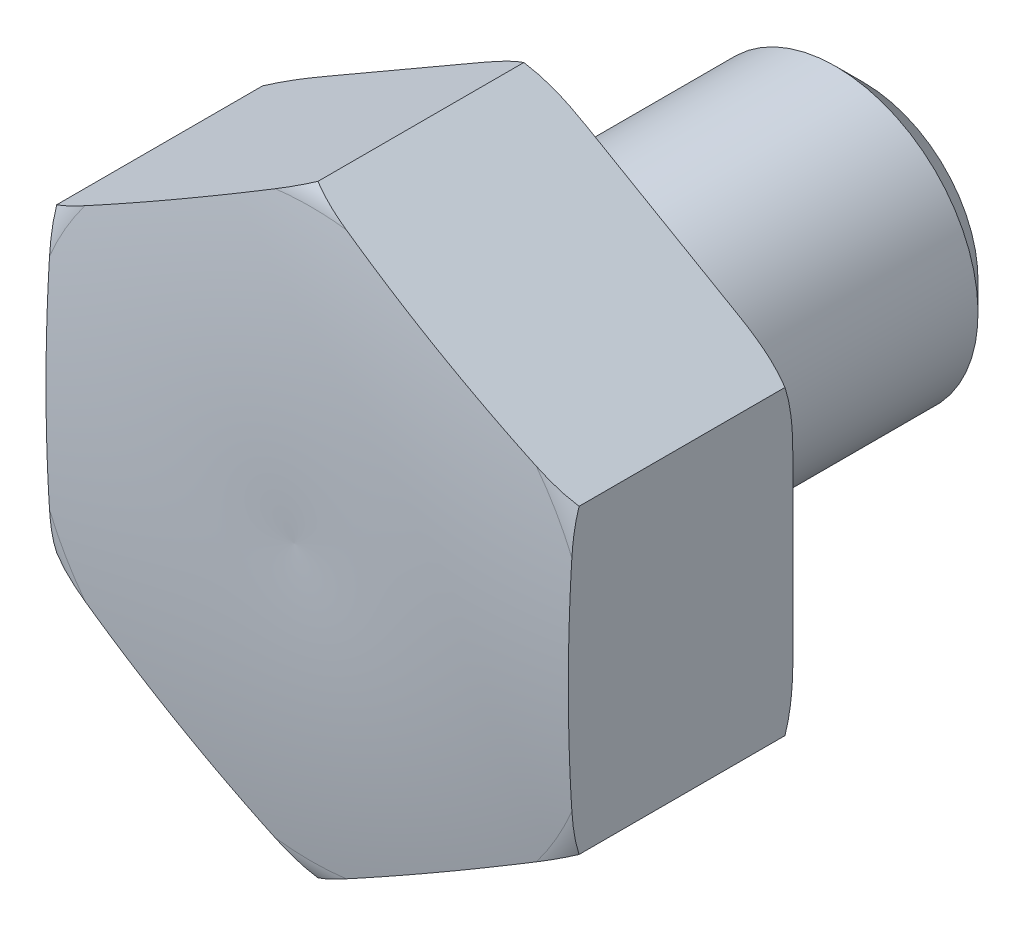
ISO-10303-21;
HEADER;
FILE_DESCRIPTION(('STEP AP214'),'2;1');
FILE_NAME('part.step','',(''),(''),'','','');
FILE_SCHEMA(('AUTOMOTIVE_DESIGN { 1 0 10303 214 1 1 1 1 }'));
ENDSEC;
DATA;
#1=APPLICATION_CONTEXT('core data for automotive mechanical design processes');
#2=APPLICATION_PROTOCOL_DEFINITION('international standard','automotive_design',2000,#1);
#3=PRODUCT_CONTEXT('',#1,'mechanical');
#4=PRODUCT('Part','Part','',(#3));
#5=PRODUCT_RELATED_PRODUCT_CATEGORY('part','',(#4));
#6=PRODUCT_DEFINITION_FORMATION('','',#4);
#7=PRODUCT_DEFINITION_CONTEXT('part definition',#1,'design');
#8=PRODUCT_DEFINITION('design','',#6,#7);
#9=PRODUCT_DEFINITION_SHAPE('','',#8);
#10=(LENGTH_UNIT() NAMED_UNIT(*) SI_UNIT(.MILLI.,.METRE.));
#11=(NAMED_UNIT(*) PLANE_ANGLE_UNIT() SI_UNIT($,.RADIAN.));
#12=(NAMED_UNIT(*) SI_UNIT($,.STERADIAN.) SOLID_ANGLE_UNIT());
#13=UNCERTAINTY_MEASURE_WITH_UNIT(LENGTH_MEASURE(1.E-05),#10,'distance_accuracy_value','');
#14=(GEOMETRIC_REPRESENTATION_CONTEXT(3) GLOBAL_UNCERTAINTY_ASSIGNED_CONTEXT((#13)) GLOBAL_UNIT_ASSIGNED_CONTEXT((#10,
#11,#12)) REPRESENTATION_CONTEXT('',''));
#15=CARTESIAN_POINT('',(0.,0.,0.));
#16=DIRECTION('',(0.,0.,1.));
#17=DIRECTION('',(1.,0.,0.));
#18=AXIS2_PLACEMENT_3D('',#15,#16,#17);
#19=CARTESIAN_POINT('',(0.,0.,2.00000000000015));
#20=DIRECTION('',(0.,0.,-1.));
#21=DIRECTION('',(0.,1.,0.));
#22=AXIS2_PLACEMENT_3D('',#19,#20,#21);
#23=TOROIDAL_SURFACE('',#22,11.5999999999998,2.00000000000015);
#24=CARTESIAN_POINT('',(0.,0.,0.));
#25=DIRECTION('',(0.,0.,-1.));
#26=DIRECTION('',(0.,1.,0.));
#27=AXIS2_PLACEMENT_3D('',#24,#25,#26);
#28=CIRCLE('',#27,11.6);
#29=CARTESIAN_POINT('',(-2.31095625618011,11.3674747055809,0.));
#30=VERTEX_POINT('',#29);
#31=CARTESIAN_POINT('',(2.31095625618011,11.3674747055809,0.));
#32=VERTEX_POINT('',#31);
#33=EDGE_CURVE('E309',#30,#32,#28,.T.);
#34=ORIENTED_EDGE('',*,*,#33,.F.);
#35=CARTESIAN_POINT('',(-11.0001999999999,6.35073749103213,0.330871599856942));
#36=CARTESIAN_POINT('',(-10.9158257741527,6.39945097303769,0.29874534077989));
#37=CARTESIAN_POINT('',(-10.8305838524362,6.44866541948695,0.269839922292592));
#38=CARTESIAN_POINT('',(-10.6588823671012,6.54779731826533,0.217725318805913));
#39=CARTESIAN_POINT('',(-10.5724240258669,6.59771406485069,0.194510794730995));
#40=CARTESIAN_POINT('',(-10.3992093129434,6.69771962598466,0.153109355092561));
#41=CARTESIAN_POINT('',(-10.3124584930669,6.74780523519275,0.134890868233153));
#42=CARTESIAN_POINT('',(-10.1383596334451,6.84832125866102,0.102650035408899));
#43=CARTESIAN_POINT('',(-10.0510114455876,6.89875175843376,0.0886287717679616));
#44=CARTESIAN_POINT('',(-9.78891298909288,7.0500743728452,0.0520689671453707));
#45=CARTESIAN_POINT('',(-9.61359394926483,7.15129486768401,0.0349190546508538));
#46=CARTESIAN_POINT('',(-9.35010257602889,7.30342168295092,0.0171205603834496));
#47=CARTESIAN_POINT('',(-9.26208969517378,7.35423594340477,0.0125080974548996));
#48=CARTESIAN_POINT('',(-9.08599828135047,7.45590236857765,0.00553454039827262));
#49=CARTESIAN_POINT('',(-8.99791975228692,7.50675453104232,0.00317332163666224));
#50=CARTESIAN_POINT('',(-8.72467991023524,7.66450962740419,-0.00126953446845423));
#51=CARTESIAN_POINT('',(-8.53948396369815,7.77143255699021,-0.000176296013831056));
#52=CARTESIAN_POINT('',(-8.16915809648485,7.9852402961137,0.00700842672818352));
#53=CARTESIAN_POINT('',(-7.98402819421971,8.09212509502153,0.0131008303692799));
#54=CARTESIAN_POINT('',(-7.61376513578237,8.30589657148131,0.0274996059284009));
#55=CARTESIAN_POINT('',(-7.4286320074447,8.41278323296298,0.0358068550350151));
#56=CARTESIAN_POINT('',(-7.05837266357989,8.62655256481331,0.0522261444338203));
#57=CARTESIAN_POINT('',(-6.8732464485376,8.73343523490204,0.0603381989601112));
#58=CARTESIAN_POINT('',(-6.50289286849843,8.94725897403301,0.0744335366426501));
#59=CARTESIAN_POINT('',(-6.31766549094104,9.05420005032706,0.080416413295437));
#60=CARTESIAN_POINT('',(-5.9471496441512,9.2681174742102,0.0889344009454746));
#61=CARTESIAN_POINT('',(-5.7618611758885,9.37509382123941,0.0914695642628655));
#62=CARTESIAN_POINT('',(-5.39121547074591,9.58908621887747,0.0925503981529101));
#63=CARTESIAN_POINT('',(-5.20585823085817,9.6961022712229,0.0910947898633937));
#64=CARTESIAN_POINT('',(-4.83518879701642,9.91010836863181,0.0845017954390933));
#65=CARTESIAN_POINT('',(-4.64987660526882,10.0170984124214,0.0793642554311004));
#66=CARTESIAN_POINT('',(-4.27827264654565,10.2316440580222,0.0664888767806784));
#67=CARTESIAN_POINT('',(-4.09198128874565,10.3391994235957,0.0587364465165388));
#68=CARTESIAN_POINT('',(-3.71944098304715,10.5542856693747,0.0424560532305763));
#69=CARTESIAN_POINT('',(-3.53319203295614,10.6618165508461,0.0339281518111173));
#70=CARTESIAN_POINT('',(-3.1610772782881,10.8766571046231,0.0184498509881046));
#71=CARTESIAN_POINT('',(-2.97521159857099,10.9839667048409,0.0114958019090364));
#72=CARTESIAN_POINT('',(-2.60330471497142,11.1986872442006,0.00186432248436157));
#73=CARTESIAN_POINT('',(-2.4172634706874,11.3060982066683,-0.000811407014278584));
#74=CARTESIAN_POINT('',(-2.04408158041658,11.5215548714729,0.00125425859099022));
#75=CARTESIAN_POINT('',(-1.85694096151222,11.6296005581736,0.00603976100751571));
#76=CARTESIAN_POINT('',(-1.48326916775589,11.8453400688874,0.0267844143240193));
#77=CARTESIAN_POINT('',(-1.29673752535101,11.9530341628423,0.0427297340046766));
#78=CARTESIAN_POINT('',(-1.01703008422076,12.1145233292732,0.0784814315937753));
#79=CARTESIAN_POINT('',(-0.923298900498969,12.1686390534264,0.0924801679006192));
#80=CARTESIAN_POINT('',(-0.736470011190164,12.2765047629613,0.125154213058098));
#81=CARTESIAN_POINT('',(-0.643372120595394,12.3302548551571,0.143828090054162));
#82=CARTESIAN_POINT('',(-0.457688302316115,12.4374594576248,0.186706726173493));
#83=CARTESIAN_POINT('',(-0.365106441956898,12.4909116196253,0.210935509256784));
#84=CARTESIAN_POINT('',(-0.181287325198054,12.5970396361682,0.265835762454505));
#85=CARTESIAN_POINT('',(-0.090051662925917,12.6497145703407,0.296514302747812));
#86=CARTESIAN_POINT('',(0.00020000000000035,12.7018213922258,0.330871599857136));
#87=B_SPLINE_CURVE_WITH_KNOTS('',3,(#35,#36,#37,#38,#39,#40,#41,#42,#43,#44,#45,#46,#47,#48,#49,
#50,#51,#52,#53,#54,#55,#56,#57,#58,#59,#60,#61,#62,#63,#64,#65,#66,#67,#68,#69,#70,#71,#72,#73,
#74,#75,#76,#77,#78,#79,#80,#81,#82,#83,#84,#85,#86),.UNSPECIFIED.,.F.,.F.,(4,2,2,2,2,2,2,2,2,2,
2,2,2,2,2,2,2,2,2,2,2,2,2,2,2,4),(0.,0.307623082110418,0.614956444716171,0.920300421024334,
1.22572306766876,1.83475616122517,2.13994387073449,2.44511468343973,3.08654497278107,
3.72809324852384,4.36989598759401,5.01165178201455,5.65353003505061,6.29539854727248,
6.9374727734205,7.57957383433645,8.2253189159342,8.87101274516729,9.51519354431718,
10.15963037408,10.8078912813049,11.4553501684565,11.7826658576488,12.1098814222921,
12.4385397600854,12.7675602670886),.UNSPECIFIED.);
#88=CARTESIAN_POINT('',(0.,12.701705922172,0.330795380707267));
#89=VERTEX_POINT('',#88);
#90=EDGE_CURVE('E151',#30,#89,#87,.T.);
#91=ORIENTED_EDGE('',*,*,#90,.T.);
#92=CARTESIAN_POINT('',(-0.0002,12.7018213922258,0.330871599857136));
#93=CARTESIAN_POINT('',(0.0841742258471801,12.6531079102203,0.298745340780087));
#94=CARTESIAN_POINT('',(0.169416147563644,12.6038934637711,0.269839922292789));
#95=CARTESIAN_POINT('',(0.341117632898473,12.5047615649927,0.217725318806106));
#96=CARTESIAN_POINT('',(0.427575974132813,12.4548448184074,0.194510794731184));
#97=CARTESIAN_POINT('',(0.600790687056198,12.3548392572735,0.15310935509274));
#98=CARTESIAN_POINT('',(0.687541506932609,12.3047536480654,0.134890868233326));
#99=CARTESIAN_POINT('',(0.861640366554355,12.2042376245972,0.102650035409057));
#100=CARTESIAN_POINT('',(0.948988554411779,12.1538071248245,0.0886287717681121));
#101=CARTESIAN_POINT('',(1.21108701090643,12.0024845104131,0.0520689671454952));
#102=CARTESIAN_POINT('',(1.3864060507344,11.9012640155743,0.0349190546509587));
#103=CARTESIAN_POINT('',(1.64989742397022,11.7491372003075,0.0171205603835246));
#104=CARTESIAN_POINT('',(1.73791030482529,11.6983229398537,0.0125080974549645));
#105=CARTESIAN_POINT('',(1.91400171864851,11.5966565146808,0.00553454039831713));
#106=CARTESIAN_POINT('',(2.00208024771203,11.5458043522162,0.00317332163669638));
#107=CARTESIAN_POINT('',(2.27532008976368,11.3880492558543,-0.00126953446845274));
#108=CARTESIAN_POINT('',(2.4605160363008,11.2811263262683,-0.00017629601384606));
#109=CARTESIAN_POINT('',(2.83084190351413,11.0673185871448,0.0070084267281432));
#110=CARTESIAN_POINT('',(3.01597180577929,10.9604337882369,0.0131008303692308));
#111=CARTESIAN_POINT('',(3.38623486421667,10.7466623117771,0.0274996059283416));
#112=CARTESIAN_POINT('',(3.57136799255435,10.6397756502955,0.0358068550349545));
#113=CARTESIAN_POINT('',(3.9416273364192,10.4260063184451,0.0522261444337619));
#114=CARTESIAN_POINT('',(4.12675355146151,10.3191236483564,0.0603381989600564));
#115=CARTESIAN_POINT('',(4.49710713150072,10.1052999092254,0.074433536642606));
#116=CARTESIAN_POINT('',(4.68233450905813,9.99835883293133,0.0804164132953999));
#117=CARTESIAN_POINT('',(5.05285035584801,9.78444140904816,0.0889344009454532));
#118=CARTESIAN_POINT('',(5.23813882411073,9.67746506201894,0.0914695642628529));
#119=CARTESIAN_POINT('',(5.60878452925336,9.46347266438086,0.0925503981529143));
#120=CARTESIAN_POINT('',(5.79414176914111,9.35645661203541,0.091094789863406));
#121=CARTESIAN_POINT('',(6.1648112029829,9.14245051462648,0.084501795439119));
#122=CARTESIAN_POINT('',(6.35012339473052,9.03546047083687,0.0793642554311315));
#123=CARTESIAN_POINT('',(6.72172735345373,8.82091482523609,0.0664888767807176));
#124=CARTESIAN_POINT('',(6.90801871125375,8.71335945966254,0.0587364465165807));
#125=CARTESIAN_POINT('',(7.28055901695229,8.49827321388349,0.0424560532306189));
#126=CARTESIAN_POINT('',(7.46680796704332,8.39074233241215,0.033928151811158));
#127=CARTESIAN_POINT('',(7.83892272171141,8.17590177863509,0.0184498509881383));
#128=CARTESIAN_POINT('',(8.02478840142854,8.06859217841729,0.011495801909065));
#129=CARTESIAN_POINT('',(8.39669528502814,7.85387163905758,0.00186432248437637));
#130=CARTESIAN_POINT('',(8.58273652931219,7.74646067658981,-0.000811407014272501));
#131=CARTESIAN_POINT('',(8.95591841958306,7.53100401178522,0.00125425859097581));
#132=CARTESIAN_POINT('',(9.14305903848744,7.42295832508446,0.00603976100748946));
#133=CARTESIAN_POINT('',(9.5167308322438,7.20721881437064,0.0267844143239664));
#134=CARTESIAN_POINT('',(9.70326247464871,7.09952472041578,0.0427297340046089));
#135=CARTESIAN_POINT('',(9.98296991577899,6.93803555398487,0.0784814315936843));
#136=CARTESIAN_POINT('',(10.0767010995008,6.88391982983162,0.0924801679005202));
#137=CARTESIAN_POINT('',(10.2635299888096,6.77605412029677,0.125154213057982));
#138=CARTESIAN_POINT('',(10.3566278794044,6.72230402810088,0.143828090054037));
#139=CARTESIAN_POINT('',(10.5423116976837,6.61509942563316,0.186706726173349));
#140=CARTESIAN_POINT('',(10.6348935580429,6.56164726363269,0.210935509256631));
#141=CARTESIAN_POINT('',(10.8187126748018,6.45551924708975,0.265835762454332));
#142=CARTESIAN_POINT('',(10.9099483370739,6.40284431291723,0.296514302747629));
#143=CARTESIAN_POINT('',(11.0001999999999,6.35073749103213,0.330871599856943));
#144=B_SPLINE_CURVE_WITH_KNOTS('',3,(#92,#93,#94,#95,#96,#97,#98,#99,#100,#101,#102,#103,#104,
#105,#106,#107,#108,#109,#110,#111,#112,#113,#114,#115,#116,#117,#118,#119,#120,#121,#122,#123,
#124,#125,#126,#127,#128,#129,#130,#131,#132,#133,#134,#135,#136,#137,#138,#139,#140,#141,#142,
#143),.UNSPECIFIED.,.F.,.F.,(4,2,2,2,2,2,2,2,2,2,2,2,2,2,2,2,2,2,2,2,2,2,2,2,2,4),(0.,
0.307623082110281,0.614956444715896,0.920300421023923,1.22572306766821,1.83475616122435,
2.13994387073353,2.44511468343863,3.08654497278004,3.72809324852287,4.3698959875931,
5.01165178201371,5.65353003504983,6.29539854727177,6.93747277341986,7.57957383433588,
8.2253189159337,8.87101274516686,9.51519354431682,10.1596303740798,10.8078912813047,
11.4553501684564,11.7826658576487,12.109881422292,12.4385397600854,12.7675602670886),.UNSPECIFIED.);
#145=EDGE_CURVE('E373',#89,#32,#144,.T.);
#146=ORIENTED_EDGE('',*,*,#145,.T.);
#147=EDGE_LOOP('',(#34,#91,#146));
#148=FACE_BOUND('',#147,.T.);
#149=ADVANCED_FACE('F14',(#148),#23,.T.);
#150=CARTESIAN_POINT('',(8.68904374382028,7.68508417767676,0.));
#151=VERTEX_POINT('',#150);
#152=CARTESIAN_POINT('',(11.,3.68239052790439,0.));
#153=VERTEX_POINT('',#152);
#154=EDGE_CURVE('E312',#151,#153,#28,.T.);
#155=ORIENTED_EDGE('',*,*,#154,.F.);
#156=CARTESIAN_POINT('',(11.,6.3508529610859,0.330795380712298));
#157=VERTEX_POINT('',#156);
#158=EDGE_CURVE('E340',#151,#157,#144,.T.);
#159=ORIENTED_EDGE('',*,*,#158,.T.);
#160=CARTESIAN_POINT('',(11.,0.,0.092121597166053));
#161=CARTESIAN_POINT('',(11.,-0.166803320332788,0.0921251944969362));
#162=CARTESIAN_POINT('',(11.,-0.333605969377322,0.0909162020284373));
#163=CARTESIAN_POINT('',(11.,-0.66718008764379,0.0862464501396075));
#164=CARTESIAN_POINT('',(11.,-0.833951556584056,0.0827856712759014));
#165=CARTESIAN_POINT('',(11.,-1.16750102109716,0.0740653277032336));
#166=CARTESIAN_POINT('',(11.,-1.33427900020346,0.0688051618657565));
#167=CARTESIAN_POINT('',(11.,-1.66779552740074,0.0572108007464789));
#168=CARTESIAN_POINT('',(11.,-1.83453407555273,0.0508766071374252));
#169=CARTESIAN_POINT('',(11.,-2.16780802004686,0.0380819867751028));
#170=CARTESIAN_POINT('',(11.,-2.33434342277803,0.0316217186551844));
#171=CARTESIAN_POINT('',(11.,-2.66744853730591,0.0196794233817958));
#172=CARTESIAN_POINT('',(11.,-2.83401824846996,0.0141973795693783));
#173=CARTESIAN_POINT('',(11.,-3.16714902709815,0.00547123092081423));
#174=CARTESIAN_POINT('',(11.,-3.33371006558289,0.00222613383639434));
#175=CARTESIAN_POINT('',(11.,-3.6668581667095,-0.000628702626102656));
#176=CARTESIAN_POINT('',(11.,-3.83344522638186,-0.000238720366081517));
#177=CARTESIAN_POINT('',(11.,-4.22683090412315,0.00680238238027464));
#178=CARTESIAN_POINT('',(11.,-4.45360192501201,0.0156683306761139));
#179=CARTESIAN_POINT('',(11.,-4.9073047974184,0.0476165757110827));
#180=CARTESIAN_POINT('',(11.,-5.13423282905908,0.0707623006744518));
#181=CARTESIAN_POINT('',(11.,-5.50857771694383,0.12579811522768));
#182=CARTESIAN_POINT('',(11.,-5.65680935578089,0.152044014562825));
#183=CARTESIAN_POINT('',(11.,-5.9511434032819,0.215354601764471));
#184=CARTESIAN_POINT('',(11.,-6.09724395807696,0.252428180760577));
#185=CARTESIAN_POINT('',(11.,-6.38441677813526,0.339534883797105));
#186=CARTESIAN_POINT('',(11.,-6.52551846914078,0.389469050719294));
#187=CARTESIAN_POINT('',(11.,-6.800877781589,0.505324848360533));
#188=CARTESIAN_POINT('',(11.,-6.93515063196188,0.571208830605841));
#189=CARTESIAN_POINT('',(11.,-7.14508713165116,0.694680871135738));
#190=CARTESIAN_POINT('',(11.,-7.22416927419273,0.746433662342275));
#191=CARTESIAN_POINT('',(11.,-7.37601788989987,0.858763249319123));
#192=CARTESIAN_POINT('',(11.,-7.44877882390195,0.919347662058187));
#193=CARTESIAN_POINT('',(11.,-7.58594623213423,1.05069333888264));
#194=CARTESIAN_POINT('',(11.,-7.65026675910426,1.12154582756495));
#195=CARTESIAN_POINT('',(11.,-7.76598418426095,1.27315886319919));
#196=CARTESIAN_POINT('',(11.,-7.81740644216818,1.35389949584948));
#197=CARTESIAN_POINT('',(11.,-7.89182810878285,1.5019490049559));
#198=CARTESIAN_POINT('',(11.,-7.91874177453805,1.56728418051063));
#199=CARTESIAN_POINT('',(11.,-7.96137411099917,1.70152289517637));
#200=CARTESIAN_POINT('',(11.,-7.97710189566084,1.77042348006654));
#201=CARTESIAN_POINT('',(11.,-7.99617622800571,1.91023874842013));
#202=CARTESIAN_POINT('',(11.,-7.99947088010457,1.98116063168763));
#203=CARTESIAN_POINT('',(11.,-7.99324628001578,2.12244168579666));
#204=CARTESIAN_POINT('',(11.,-7.9837253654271,2.192800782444));
#205=CARTESIAN_POINT('',(11.,-7.95358375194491,2.326761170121));
#206=CARTESIAN_POINT('',(11.,-7.93363837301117,2.39051778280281));
#207=CARTESIAN_POINT('',(11.,-7.88441469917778,2.51427786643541));
#208=CARTESIAN_POINT('',(11.,-7.85513368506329,2.57428023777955));
#209=CARTESIAN_POINT('',(11.,-7.77447876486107,2.71459875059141));
#210=CARTESIAN_POINT('',(11.,-7.71901803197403,2.79256494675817));
#211=CARTESIAN_POINT('',(11.,-7.59632221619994,2.93862878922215));
#212=CARTESIAN_POINT('',(11.,-7.52905759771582,3.00670087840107));
#213=CARTESIAN_POINT('',(11.,-7.34887519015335,3.16637702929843));
#214=CARTESIAN_POINT('',(11.,-7.23045052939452,3.25172483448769));
#215=CARTESIAN_POINT('',(11.,-6.982285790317,3.40347860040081));
#216=CARTESIAN_POINT('',(11.,-6.85253063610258,3.46985880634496));
#217=CARTESIAN_POINT('',(11.,-6.59864877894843,3.58154125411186));
#218=CARTESIAN_POINT('',(11.,-6.47511710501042,3.62822783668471));
#219=CARTESIAN_POINT('',(11.,-6.22445126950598,3.71088652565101));
#220=CARTESIAN_POINT('',(11.,-6.097313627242,3.74684786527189));
#221=CARTESIAN_POINT('',(11.,-5.84042946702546,3.80990007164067));
#222=CARTESIAN_POINT('',(11.,-5.71067545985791,3.8369598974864));
#223=CARTESIAN_POINT('',(11.,-5.51512889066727,3.87188730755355));
#224=CARTESIAN_POINT('',(11.,-5.44982099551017,3.88258283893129));
#225=CARTESIAN_POINT('',(11.,-5.31895147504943,3.90225708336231));
#226=CARTESIAN_POINT('',(11.,-5.25338986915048,3.9112359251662));
#227=CARTESIAN_POINT('',(11.,-5.03839742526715,3.93808577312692));
#228=CARTESIAN_POINT('',(11.,-4.88855675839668,3.95270732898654));
#229=CARTESIAN_POINT('',(11.,-4.58837359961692,3.97551292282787));
#230=CARTESIAN_POINT('',(11.,-4.43803096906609,3.9836950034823));
#231=CARTESIAN_POINT('',(11.,-4.13699274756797,3.99502058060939));
#232=CARTESIAN_POINT('',(11.,-3.98629694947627,3.99815820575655));
#233=CARTESIAN_POINT('',(11.,-3.68490122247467,4.00061441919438));
#234=CARTESIAN_POINT('',(11.,-3.53420129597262,3.99993344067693));
#235=CARTESIAN_POINT('',(11.,-3.08101312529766,3.99385100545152));
#236=CARTESIAN_POINT('',(11.,-2.77859383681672,3.98438430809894));
#237=CARTESIAN_POINT('',(11.,-2.17385986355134,3.96253855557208));
#238=CARTESIAN_POINT('',(11.,-1.87154519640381,3.95015913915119));
#239=CARTESIAN_POINT('',(11.,-1.41709733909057,3.93397244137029));
#240=CARTESIAN_POINT('',(11.,-1.26501322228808,3.92896300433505));
#241=CARTESIAN_POINT('',(11.,-0.960806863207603,3.92031374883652));
#242=CARTESIAN_POINT('',(11.,-0.808684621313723,3.91667391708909));
#243=CARTESIAN_POINT('',(11.,-0.504403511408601,3.91117545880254));
#244=CARTESIAN_POINT('',(11.,-0.352244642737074,3.90931686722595));
#245=CARTESIAN_POINT('',(11.,-0.04791429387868,3.90758243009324));
#246=CARTESIAN_POINT('',(11.,0.104257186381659,3.90770659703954));
#247=CARTESIAN_POINT('',(11.,0.408307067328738,3.90992260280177));
#248=CARTESIAN_POINT('',(11.,0.560185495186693,3.9120108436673));
#249=CARTESIAN_POINT('',(11.,0.863907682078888,3.91792189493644));
#250=CARTESIAN_POINT('',(11.,1.01575144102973,3.92174470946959));
#251=CARTESIAN_POINT('',(11.,1.31941148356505,3.93069989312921));
#252=CARTESIAN_POINT('',(11.,1.47122776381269,3.93583237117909));
#253=CARTESIAN_POINT('',(11.,1.77483390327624,3.94681026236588));
#254=CARTESIAN_POINT('',(11.,1.92662376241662,3.95265567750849));
#255=CARTESIAN_POINT('',(11.,2.22975290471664,3.96430411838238));
#256=CARTESIAN_POINT('',(11.,2.38109218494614,3.97010721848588));
#257=CARTESIAN_POINT('',(11.,2.68380028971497,3.98084177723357));
#258=CARTESIAN_POINT('',(11.,2.83516911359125,3.98577325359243));
#259=CARTESIAN_POINT('',(11.,3.13813939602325,3.99382318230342));
#260=CARTESIAN_POINT('',(11.,3.28974091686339,3.99693946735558));
#261=CARTESIAN_POINT('',(11.,3.5929794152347,4.00030320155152));
#262=CARTESIAN_POINT('',(11.,3.74461639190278,4.00055071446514));
#263=CARTESIAN_POINT('',(11.,4.04691129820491,3.99703420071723));
#264=CARTESIAN_POINT('',(11.,4.197569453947,3.99329510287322));
#265=CARTESIAN_POINT('',(11.,4.49866089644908,3.98058401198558));
#266=CARTESIAN_POINT('',(11.,4.64909421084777,3.97161272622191));
#267=CARTESIAN_POINT('',(11.,4.9491904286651,3.94702959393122));
#268=CARTESIAN_POINT('',(11.,5.09885418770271,3.93142858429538));
#269=CARTESIAN_POINT('',(11.,5.39706339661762,3.89195135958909));
#270=CARTESIAN_POINT('',(11.,5.54560932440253,3.86807891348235));
#271=CARTESIAN_POINT('',(11.,5.79769474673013,3.81855728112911));
#272=CARTESIAN_POINT('',(11.,5.90173189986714,3.79545429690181));
#273=CARTESIAN_POINT('',(11.,6.1083567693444,3.74328382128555));
#274=CARTESIAN_POINT('',(11.,6.21094401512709,3.71421443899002));
#275=CARTESIAN_POINT('',(11.,6.41385708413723,3.64920228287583));
#276=CARTESIAN_POINT('',(11.,6.51418462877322,3.61326495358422));
#277=CARTESIAN_POINT('',(11.,6.71158830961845,3.5334440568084));
#278=CARTESIAN_POINT('',(11.,6.80866661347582,3.48956591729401));
#279=CARTESIAN_POINT('',(11.,7.00820773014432,3.38749543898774));
#280=CARTESIAN_POINT('',(11.,7.11015726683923,3.32828104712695));
#281=CARTESIAN_POINT('',(11.,7.30536999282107,3.19682380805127));
#282=CARTESIAN_POINT('',(11.,7.39864228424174,3.12459485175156));
#283=CARTESIAN_POINT('',(11.,7.55336712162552,2.98255957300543));
#284=CARTESIAN_POINT('',(11.,7.61735706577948,2.91554446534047));
#285=CARTESIAN_POINT('',(11.,7.7339241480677,2.77217553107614));
#286=CARTESIAN_POINT('',(11.,7.78651888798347,2.69583639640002));
#287=CARTESIAN_POINT('',(11.,7.8665396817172,2.55227691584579));
#288=CARTESIAN_POINT('',(11.,7.89695624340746,2.48673313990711));
#289=CARTESIAN_POINT('',(11.,7.9465395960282,2.35149756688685));
#290=CARTESIAN_POINT('',(11.,7.96571497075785,2.28180897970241));
#291=CARTESIAN_POINT('',(11.,7.99138067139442,2.13971177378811));
#292=CARTESIAN_POINT('',(11.,7.99780336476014,2.06729071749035));
#293=CARTESIAN_POINT('',(11.,7.99717373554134,1.92250863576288));
#294=CARTESIAN_POINT('',(11.,7.99012239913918,1.85014760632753));
#295=CARTESIAN_POINT('',(11.,7.96427754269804,1.7136192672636));
#296=CARTESIAN_POINT('',(11.,7.94647063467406,1.64926012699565));
#297=CARTESIAN_POINT('',(11.,7.90122794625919,1.52405314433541));
#298=CARTESIAN_POINT('',(11.,7.87378870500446,1.46320657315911));
#299=CARTESIAN_POINT('',(11.,7.79850034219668,1.32307208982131));
#300=CARTESIAN_POINT('',(11.,7.74686400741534,1.24582083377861));
#301=CARTESIAN_POINT('',(11.,7.63185243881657,1.10063329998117));
#302=CARTESIAN_POINT('',(11.,7.56845243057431,1.03271721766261));
#303=CARTESIAN_POINT('',(11.,7.39932861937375,0.874255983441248));
#304=CARTESIAN_POINT('',(11.,7.28830617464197,0.789403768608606));
#305=CARTESIAN_POINT('',(11.,7.05476556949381,0.637556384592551));
#306=CARTESIAN_POINT('',(11.,6.93222325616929,0.570599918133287));
#307=CARTESIAN_POINT('',(11.,6.69388358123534,0.458131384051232));
#308=CARTESIAN_POINT('',(11.,6.57879562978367,0.411081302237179));
#309=CARTESIAN_POINT('',(11.,6.34496197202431,0.327013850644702));
#310=CARTESIAN_POINT('',(11.,6.22621326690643,0.290004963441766));
#311=CARTESIAN_POINT('',(11.,5.98626183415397,0.22443502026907));
#312=CARTESIAN_POINT('',(11.,5.86505580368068,0.195886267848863));
#313=CARTESIAN_POINT('',(11.,5.62115904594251,0.145961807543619));
#314=CARTESIAN_POINT('',(11.,5.49846779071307,0.124588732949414));
#315=CARTESIAN_POINT('',(11.,5.15455221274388,0.073297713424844));
#316=CARTESIAN_POINT('',(11.,4.93234067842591,0.0500428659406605));
#317=CARTESIAN_POINT('',(11.,4.48688752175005,0.0174325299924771));
#318=CARTESIAN_POINT('',(11.,4.26364527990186,0.00808692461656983));
#319=CARTESIAN_POINT('',(11.,3.81689628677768,-0.00105686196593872));
#320=CARTESIAN_POINT('',(11.,3.59338945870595,-0.000850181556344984));
#321=CARTESIAN_POINT('',(11.,3.1464554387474,0.00540104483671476));
#322=CARTESIAN_POINT('',(11.,2.92302826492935,0.011446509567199));
#323=CARTESIAN_POINT('',(11.,2.47456190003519,0.0262055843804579));
#324=CARTESIAN_POINT('',(11.,2.24952345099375,0.03493924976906));
#325=CARTESIAN_POINT('',(11.,1.7994249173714,0.0522293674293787));
#326=CARTESIAN_POINT('',(11.,1.57436483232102,0.0607858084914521));
#327=CARTESIAN_POINT('',(11.,1.12445564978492,0.0754586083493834));
#328=CARTESIAN_POINT('',(11.,0.899606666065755,0.0815781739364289));
#329=CARTESIAN_POINT('',(11.,0.449838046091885,0.0899071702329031));
#330=CARTESIAN_POINT('',(11.,0.224918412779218,0.0921167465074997));
#331=CARTESIAN_POINT('',(11.,0.,0.092121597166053));
#332=B_SPLINE_CURVE_WITH_KNOTS('',3,(#160,#161,#162,#163,#164,#165,#166,#167,#168,#169,#170,
#171,#172,#173,#174,#175,#176,#177,#178,#179,#180,#181,#182,#183,#184,#185,#186,#187,#188,#189,
#190,#191,#192,#193,#194,#195,#196,#197,#198,#199,#200,#201,#202,#203,#204,#205,#206,#207,#208,
#209,#210,#211,#212,#213,#214,#215,#216,#217,#218,#219,#220,#221,#222,#223,#224,#225,#226,#227,
#228,#229,#230,#231,#232,#233,#234,#235,#236,#237,#238,#239,#240,#241,#242,#243,#244,#245,#246,
#247,#248,#249,#250,#251,#252,#253,#254,#255,#256,#257,#258,#259,#260,#261,#262,#263,#264,#265,
#266,#267,#268,#269,#270,#271,#272,#273,#274,#275,#276,#277,#278,#279,#280,#281,#282,#283,#284,
#285,#286,#287,#288,#289,#290,#291,#292,#293,#294,#295,#296,#297,#298,#299,#300,#301,#302,#303,
#304,#305,#306,#307,#308,#309,#310,#311,#312,#313,#314,#315,#316,#317,#318,#319,#320,#321,#322,
#323,#324,#325,#326,#327,#328,#329,#330,#331),.UNSPECIFIED.,.T.,.F.,(4,2,2,2,2,2,2,2,2,2,2,2,2,
2,2,2,2,2,2,2,2,2,2,2,2,2,2,2,2,2,2,2,2,2,2,2,2,2,2,2,2,2,2,2,2,2,2,2,2,2,2,2,2,2,2,2,2,2,2,2,2,
2,2,2,2,2,2,2,2,2,2,2,2,2,2,2,2,2,2,2,2,2,2,2,2,4),(0.,0.500404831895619,1.00081398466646,
1.50139047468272,2.00196618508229,2.50194817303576,3.00192164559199,3.50167320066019,
4.0013864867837,4.68194588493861,5.36555018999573,5.81685580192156,6.26853304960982,
6.71683357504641,7.16408606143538,7.44712965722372,7.73041882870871,8.01639963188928,
8.30181367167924,8.51294124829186,8.72389660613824,8.9357315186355,9.14759391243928,
9.34717689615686,9.54681806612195,9.83224382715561,10.1183942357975,10.5538633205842,
10.9899209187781,11.3855142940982,11.781503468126,12.1788592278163,12.3773748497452,
12.5758755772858,13.0273332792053,13.4789281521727,13.9310482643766,14.383117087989,
15.2907249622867,16.1984454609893,16.6549393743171,17.1114288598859,17.5679273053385,
18.024428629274,18.4800953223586,18.935763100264,19.3914687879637,19.8471757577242,
20.3015270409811,20.7558690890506,21.2107525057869,21.6656258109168,22.1176713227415,
22.5696557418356,23.0209041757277,23.4719472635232,23.7915174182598,24.1111890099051,
24.430608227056,24.7498099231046,25.1027050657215,25.4552257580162,25.7322839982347,
26.0089111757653,26.2248174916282,26.440558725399,26.6574410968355,26.8743075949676,
27.0737892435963,27.2733426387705,27.5505428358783,27.8283335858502,28.2451940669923,
28.6629489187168,29.0354060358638,29.4081768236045,29.7814870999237,30.1549342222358,
30.8245063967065,31.4945541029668,32.1649428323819,32.8354370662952,33.5110600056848,
34.1867255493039,34.8614989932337,35.5362473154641),.UNSPECIFIED.);
#333=EDGE_CURVE('E341',#157,#153,#332,.T.);
#334=ORIENTED_EDGE('',*,*,#333,.T.);
#335=EDGE_LOOP('',(#155,#159,#334));
#336=FACE_BOUND('',#335,.T.);
#337=ADVANCED_FACE('F339',(#336),#23,.T.);
#338=CARTESIAN_POINT('',(11.,-3.68239052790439,0.));
#339=VERTEX_POINT('',#338);
#340=CARTESIAN_POINT('',(8.68904374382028,-7.68508417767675,0.));
#341=VERTEX_POINT('',#340);
#342=EDGE_CURVE('E342',#339,#341,#28,.T.);
#343=ORIENTED_EDGE('',*,*,#342,.F.);
#344=CARTESIAN_POINT('',(11.,-6.3508529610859,0.330795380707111));
#345=VERTEX_POINT('',#344);
#346=EDGE_CURVE('E405',#339,#345,#332,.T.);
#347=ORIENTED_EDGE('',*,*,#346,.T.);
#348=CARTESIAN_POINT('',(11.0001999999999,-6.35073749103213,0.330871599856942));
#349=CARTESIAN_POINT('',(10.9158257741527,-6.39945097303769,0.29874534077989));
#350=CARTESIAN_POINT('',(10.8305838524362,-6.44866541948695,0.269839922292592));
#351=CARTESIAN_POINT('',(10.6588823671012,-6.54779731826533,0.217725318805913));
#352=CARTESIAN_POINT('',(10.5724240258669,-6.59771406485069,0.194510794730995));
#353=CARTESIAN_POINT('',(10.3992093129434,-6.69771962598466,0.153109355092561));
#354=CARTESIAN_POINT('',(10.3124584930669,-6.74780523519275,0.134890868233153));
#355=CARTESIAN_POINT('',(10.1383596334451,-6.84832125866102,0.102650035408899));
#356=CARTESIAN_POINT('',(10.0510114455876,-6.89875175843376,0.0886287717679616));
#357=CARTESIAN_POINT('',(9.78891298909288,-7.0500743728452,0.0520689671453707));
#358=CARTESIAN_POINT('',(9.61359394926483,-7.15129486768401,0.0349190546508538));
#359=CARTESIAN_POINT('',(9.35010257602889,-7.30342168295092,0.0171205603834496));
#360=CARTESIAN_POINT('',(9.26208969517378,-7.35423594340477,0.0125080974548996));
#361=CARTESIAN_POINT('',(9.08599828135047,-7.45590236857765,0.00553454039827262));
#362=CARTESIAN_POINT('',(8.99791975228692,-7.50675453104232,0.00317332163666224));
#363=CARTESIAN_POINT('',(8.72467991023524,-7.66450962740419,-0.00126953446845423));
#364=CARTESIAN_POINT('',(8.53948396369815,-7.77143255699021,-0.000176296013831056));
#365=CARTESIAN_POINT('',(8.16915809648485,-7.9852402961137,0.00700842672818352));
#366=CARTESIAN_POINT('',(7.98402819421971,-8.09212509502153,0.0131008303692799));
#367=CARTESIAN_POINT('',(7.61376513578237,-8.30589657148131,0.0274996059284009));
#368=CARTESIAN_POINT('',(7.4286320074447,-8.41278323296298,0.0358068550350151));
#369=CARTESIAN_POINT('',(7.05837266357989,-8.62655256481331,0.0522261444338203));
#370=CARTESIAN_POINT('',(6.8732464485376,-8.73343523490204,0.0603381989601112));
#371=CARTESIAN_POINT('',(6.50289286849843,-8.94725897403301,0.0744335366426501));
#372=CARTESIAN_POINT('',(6.31766549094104,-9.05420005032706,0.080416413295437));
#373=CARTESIAN_POINT('',(5.9471496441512,-9.2681174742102,0.0889344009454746));
#374=CARTESIAN_POINT('',(5.7618611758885,-9.37509382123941,0.0914695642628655));
#375=CARTESIAN_POINT('',(5.39121547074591,-9.58908621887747,0.0925503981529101));
#376=CARTESIAN_POINT('',(5.20585823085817,-9.6961022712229,0.0910947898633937));
#377=CARTESIAN_POINT('',(4.83518879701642,-9.91010836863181,0.0845017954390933));
#378=CARTESIAN_POINT('',(4.64987660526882,-10.0170984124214,0.0793642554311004));
#379=CARTESIAN_POINT('',(4.27827264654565,-10.2316440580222,0.0664888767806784));
#380=CARTESIAN_POINT('',(4.09198128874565,-10.3391994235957,0.0587364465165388));
#381=CARTESIAN_POINT('',(3.71944098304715,-10.5542856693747,0.0424560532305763));
#382=CARTESIAN_POINT('',(3.53319203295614,-10.6618165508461,0.0339281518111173));
#383=CARTESIAN_POINT('',(3.1610772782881,-10.8766571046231,0.0184498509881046));
#384=CARTESIAN_POINT('',(2.97521159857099,-10.9839667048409,0.0114958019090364));
#385=CARTESIAN_POINT('',(2.60330471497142,-11.1986872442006,0.00186432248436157));
#386=CARTESIAN_POINT('',(2.4172634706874,-11.3060982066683,-0.000811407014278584));
#387=CARTESIAN_POINT('',(2.04408158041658,-11.5215548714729,0.00125425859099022));
#388=CARTESIAN_POINT('',(1.85694096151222,-11.6296005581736,0.00603976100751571));
#389=CARTESIAN_POINT('',(1.48326916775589,-11.8453400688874,0.0267844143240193));
#390=CARTESIAN_POINT('',(1.29673752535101,-11.9530341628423,0.0427297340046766));
#391=CARTESIAN_POINT('',(1.01703008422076,-12.1145233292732,0.0784814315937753));
#392=CARTESIAN_POINT('',(0.923298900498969,-12.1686390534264,0.0924801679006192));
#393=CARTESIAN_POINT('',(0.736470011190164,-12.2765047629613,0.125154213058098));
#394=CARTESIAN_POINT('',(0.643372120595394,-12.3302548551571,0.143828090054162));
#395=CARTESIAN_POINT('',(0.457688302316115,-12.4374594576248,0.186706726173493));
#396=CARTESIAN_POINT('',(0.365106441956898,-12.4909116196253,0.210935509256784));
#397=CARTESIAN_POINT('',(0.181287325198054,-12.5970396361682,0.265835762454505));
#398=CARTESIAN_POINT('',(0.090051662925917,-12.6497145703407,0.296514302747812));
#399=CARTESIAN_POINT('',(-0.00020000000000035,-12.7018213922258,0.330871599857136));
#400=B_SPLINE_CURVE_WITH_KNOTS('',3,(#348,#349,#350,#351,#352,#353,#354,#355,#356,#357,#358,
#359,#360,#361,#362,#363,#364,#365,#366,#367,#368,#369,#370,#371,#372,#373,#374,#375,#376,#377,
#378,#379,#380,#381,#382,#383,#384,#385,#386,#387,#388,#389,#390,#391,#392,#393,#394,#395,#396,
#397,#398,#399),.UNSPECIFIED.,.F.,.F.,(4,2,2,2,2,2,2,2,2,2,2,2,2,2,2,2,2,2,2,2,2,2,2,2,2,4),(0.,
0.307623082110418,0.614956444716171,0.920300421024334,1.22572306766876,1.83475616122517,
2.13994387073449,2.44511468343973,3.08654497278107,3.72809324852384,4.36989598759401,
5.01165178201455,5.65353003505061,6.29539854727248,6.9374727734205,7.57957383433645,
8.2253189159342,8.87101274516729,9.51519354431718,10.15963037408,10.8078912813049,
11.4553501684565,11.7826658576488,12.1098814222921,12.4385397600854,12.7675602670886),.UNSPECIFIED.);
#401=EDGE_CURVE('E419',#345,#341,#400,.T.);
#402=ORIENTED_EDGE('',*,*,#401,.T.);
#403=EDGE_LOOP('',(#343,#347,#402));
#404=FACE_BOUND('',#403,.T.);
#405=ADVANCED_FACE('F463',(#404),#23,.T.);
#406=CARTESIAN_POINT('',(2.31095625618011,-11.3674747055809,0.));
#407=VERTEX_POINT('',#406);
#408=CARTESIAN_POINT('',(-2.31095625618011,-11.3674747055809,0.));
#409=VERTEX_POINT('',#408);
#410=EDGE_CURVE('E344',#407,#409,#28,.T.);
#411=ORIENTED_EDGE('',*,*,#410,.F.);
#412=CARTESIAN_POINT('',(0.,-12.701705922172,0.330795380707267));
#413=VERTEX_POINT('',#412);
#414=EDGE_CURVE('E430',#407,#413,#400,.T.);
#415=ORIENTED_EDGE('',*,*,#414,.T.);
#416=CARTESIAN_POINT('',(0.0002,-12.7018213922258,0.330871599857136));
#417=CARTESIAN_POINT('',(-0.0841742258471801,-12.6531079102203,0.298745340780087));
#418=CARTESIAN_POINT('',(-0.169416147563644,-12.6038934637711,0.269839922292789));
#419=CARTESIAN_POINT('',(-0.341117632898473,-12.5047615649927,0.217725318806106));
#420=CARTESIAN_POINT('',(-0.427575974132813,-12.4548448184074,0.194510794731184));
#421=CARTESIAN_POINT('',(-0.600790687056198,-12.3548392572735,0.15310935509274));
#422=CARTESIAN_POINT('',(-0.687541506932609,-12.3047536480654,0.134890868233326));
#423=CARTESIAN_POINT('',(-0.861640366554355,-12.2042376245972,0.102650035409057));
#424=CARTESIAN_POINT('',(-0.948988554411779,-12.1538071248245,0.0886287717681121));
#425=CARTESIAN_POINT('',(-1.21108701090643,-12.0024845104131,0.0520689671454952));
#426=CARTESIAN_POINT('',(-1.3864060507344,-11.9012640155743,0.0349190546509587));
#427=CARTESIAN_POINT('',(-1.64989742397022,-11.7491372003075,0.0171205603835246));
#428=CARTESIAN_POINT('',(-1.73791030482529,-11.6983229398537,0.0125080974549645));
#429=CARTESIAN_POINT('',(-1.91400171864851,-11.5966565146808,0.00553454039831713));
#430=CARTESIAN_POINT('',(-2.00208024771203,-11.5458043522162,0.00317332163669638));
#431=CARTESIAN_POINT('',(-2.27532008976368,-11.3880492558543,-0.00126953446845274));
#432=CARTESIAN_POINT('',(-2.4605160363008,-11.2811263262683,-0.00017629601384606));
#433=CARTESIAN_POINT('',(-2.83084190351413,-11.0673185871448,0.0070084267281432));
#434=CARTESIAN_POINT('',(-3.01597180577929,-10.9604337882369,0.0131008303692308));
#435=CARTESIAN_POINT('',(-3.38623486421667,-10.7466623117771,0.0274996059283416));
#436=CARTESIAN_POINT('',(-3.57136799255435,-10.6397756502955,0.0358068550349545));
#437=CARTESIAN_POINT('',(-3.9416273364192,-10.4260063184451,0.0522261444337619));
#438=CARTESIAN_POINT('',(-4.12675355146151,-10.3191236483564,0.0603381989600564));
#439=CARTESIAN_POINT('',(-4.49710713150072,-10.1052999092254,0.074433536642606));
#440=CARTESIAN_POINT('',(-4.68233450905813,-9.99835883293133,0.0804164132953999));
#441=CARTESIAN_POINT('',(-5.05285035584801,-9.78444140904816,0.0889344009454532));
#442=CARTESIAN_POINT('',(-5.23813882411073,-9.67746506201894,0.0914695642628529));
#443=CARTESIAN_POINT('',(-5.60878452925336,-9.46347266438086,0.0925503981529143));
#444=CARTESIAN_POINT('',(-5.79414176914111,-9.35645661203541,0.091094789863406));
#445=CARTESIAN_POINT('',(-6.1648112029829,-9.14245051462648,0.084501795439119));
#446=CARTESIAN_POINT('',(-6.35012339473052,-9.03546047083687,0.0793642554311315));
#447=CARTESIAN_POINT('',(-6.72172735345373,-8.82091482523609,0.0664888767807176));
#448=CARTESIAN_POINT('',(-6.90801871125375,-8.71335945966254,0.0587364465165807));
#449=CARTESIAN_POINT('',(-7.28055901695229,-8.49827321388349,0.0424560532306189));
#450=CARTESIAN_POINT('',(-7.46680796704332,-8.39074233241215,0.033928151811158));
#451=CARTESIAN_POINT('',(-7.83892272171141,-8.17590177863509,0.0184498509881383));
#452=CARTESIAN_POINT('',(-8.02478840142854,-8.06859217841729,0.011495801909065));
#453=CARTESIAN_POINT('',(-8.39669528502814,-7.85387163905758,0.00186432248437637));
#454=CARTESIAN_POINT('',(-8.58273652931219,-7.74646067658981,-0.000811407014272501));
#455=CARTESIAN_POINT('',(-8.95591841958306,-7.53100401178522,0.00125425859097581));
#456=CARTESIAN_POINT('',(-9.14305903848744,-7.42295832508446,0.00603976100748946));
#457=CARTESIAN_POINT('',(-9.5167308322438,-7.20721881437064,0.0267844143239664));
#458=CARTESIAN_POINT('',(-9.70326247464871,-7.09952472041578,0.0427297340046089));
#459=CARTESIAN_POINT('',(-9.98296991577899,-6.93803555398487,0.0784814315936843));
#460=CARTESIAN_POINT('',(-10.0767010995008,-6.88391982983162,0.0924801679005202));
#461=CARTESIAN_POINT('',(-10.2635299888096,-6.77605412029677,0.125154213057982));
#462=CARTESIAN_POINT('',(-10.3566278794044,-6.72230402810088,0.143828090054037));
#463=CARTESIAN_POINT('',(-10.5423116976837,-6.61509942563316,0.186706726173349));
#464=CARTESIAN_POINT('',(-10.6348935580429,-6.56164726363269,0.210935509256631));
#465=CARTESIAN_POINT('',(-10.8187126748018,-6.45551924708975,0.265835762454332));
#466=CARTESIAN_POINT('',(-10.9099483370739,-6.40284431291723,0.296514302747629));
#467=CARTESIAN_POINT('',(-11.0001999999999,-6.35073749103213,0.330871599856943));
#468=B_SPLINE_CURVE_WITH_KNOTS('',3,(#416,#417,#418,#419,#420,#421,#422,#423,#424,#425,#426,
#427,#428,#429,#430,#431,#432,#433,#434,#435,#436,#437,#438,#439,#440,#441,#442,#443,#444,#445,
#446,#447,#448,#449,#450,#451,#452,#453,#454,#455,#456,#457,#458,#459,#460,#461,#462,#463,#464,
#465,#466,#467),.UNSPECIFIED.,.F.,.F.,(4,2,2,2,2,2,2,2,2,2,2,2,2,2,2,2,2,2,2,2,2,2,2,2,2,4),(0.,
0.307623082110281,0.614956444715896,0.920300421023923,1.22572306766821,1.83475616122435,
2.13994387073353,2.44511468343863,3.08654497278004,3.72809324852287,4.3698959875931,
5.01165178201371,5.65353003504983,6.29539854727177,6.93747277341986,7.57957383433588,
8.2253189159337,8.87101274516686,9.51519354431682,10.1596303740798,10.8078912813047,
11.4553501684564,11.7826658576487,12.109881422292,12.4385397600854,12.7675602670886),.UNSPECIFIED.);
#469=EDGE_CURVE('E200',#413,#409,#468,.T.);
#470=ORIENTED_EDGE('',*,*,#469,.T.);
#471=EDGE_LOOP('',(#411,#415,#470));
#472=FACE_BOUND('',#471,.T.);
#473=ADVANCED_FACE('F471',(#472),#23,.T.);
#474=CARTESIAN_POINT('',(-11.,0.,0.092121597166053));
#475=CARTESIAN_POINT('',(-11.,0.166803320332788,0.0921251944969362));
#476=CARTESIAN_POINT('',(-11.,0.333605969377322,0.0909162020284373));
#477=CARTESIAN_POINT('',(-11.,0.66718008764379,0.0862464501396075));
#478=CARTESIAN_POINT('',(-11.,0.833951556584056,0.0827856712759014));
#479=CARTESIAN_POINT('',(-11.,1.16750102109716,0.0740653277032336));
#480=CARTESIAN_POINT('',(-11.,1.33427900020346,0.0688051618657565));
#481=CARTESIAN_POINT('',(-11.,1.66779552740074,0.0572108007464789));
#482=CARTESIAN_POINT('',(-11.,1.83453407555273,0.0508766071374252));
#483=CARTESIAN_POINT('',(-11.,2.16780802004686,0.0380819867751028));
#484=CARTESIAN_POINT('',(-11.,2.33434342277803,0.0316217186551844));
#485=CARTESIAN_POINT('',(-11.,2.66744853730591,0.0196794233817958));
#486=CARTESIAN_POINT('',(-11.,2.83401824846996,0.0141973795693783));
#487=CARTESIAN_POINT('',(-11.,3.16714902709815,0.00547123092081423));
#488=CARTESIAN_POINT('',(-11.,3.33371006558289,0.00222613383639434));
#489=CARTESIAN_POINT('',(-11.,3.6668581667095,-0.000628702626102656));
#490=CARTESIAN_POINT('',(-11.,3.83344522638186,-0.000238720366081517));
#491=CARTESIAN_POINT('',(-11.,4.22683090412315,0.00680238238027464));
#492=CARTESIAN_POINT('',(-11.,4.45360192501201,0.0156683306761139));
#493=CARTESIAN_POINT('',(-11.,4.9073047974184,0.0476165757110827));
#494=CARTESIAN_POINT('',(-11.,5.13423282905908,0.0707623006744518));
#495=CARTESIAN_POINT('',(-11.,5.50857771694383,0.12579811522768));
#496=CARTESIAN_POINT('',(-11.,5.65680935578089,0.152044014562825));
#497=CARTESIAN_POINT('',(-11.,5.9511434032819,0.215354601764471));
#498=CARTESIAN_POINT('',(-11.,6.09724395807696,0.252428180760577));
#499=CARTESIAN_POINT('',(-11.,6.38441677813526,0.339534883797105));
#500=CARTESIAN_POINT('',(-11.,6.52551846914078,0.389469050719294));
#501=CARTESIAN_POINT('',(-11.,6.800877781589,0.505324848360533));
#502=CARTESIAN_POINT('',(-11.,6.93515063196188,0.571208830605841));
#503=CARTESIAN_POINT('',(-11.,7.14508713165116,0.694680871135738));
#504=CARTESIAN_POINT('',(-11.,7.22416927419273,0.746433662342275));
#505=CARTESIAN_POINT('',(-11.,7.37601788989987,0.858763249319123));
#506=CARTESIAN_POINT('',(-11.,7.44877882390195,0.919347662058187));
#507=CARTESIAN_POINT('',(-11.,7.58594623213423,1.05069333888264));
#508=CARTESIAN_POINT('',(-11.,7.65026675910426,1.12154582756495));
#509=CARTESIAN_POINT('',(-11.,7.76598418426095,1.27315886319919));
#510=CARTESIAN_POINT('',(-11.,7.81740644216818,1.35389949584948));
#511=CARTESIAN_POINT('',(-11.,7.89182810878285,1.5019490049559));
#512=CARTESIAN_POINT('',(-11.,7.91874177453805,1.56728418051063));
#513=CARTESIAN_POINT('',(-11.,7.96137411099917,1.70152289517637));
#514=CARTESIAN_POINT('',(-11.,7.97710189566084,1.77042348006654));
#515=CARTESIAN_POINT('',(-11.,7.99617622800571,1.91023874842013));
#516=CARTESIAN_POINT('',(-11.,7.99947088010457,1.98116063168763));
#517=CARTESIAN_POINT('',(-11.,7.99324628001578,2.12244168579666));
#518=CARTESIAN_POINT('',(-11.,7.9837253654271,2.192800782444));
#519=CARTESIAN_POINT('',(-11.,7.95358375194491,2.326761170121));
#520=CARTESIAN_POINT('',(-11.,7.93363837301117,2.39051778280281));
#521=CARTESIAN_POINT('',(-11.,7.88441469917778,2.51427786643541));
#522=CARTESIAN_POINT('',(-11.,7.85513368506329,2.57428023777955));
#523=CARTESIAN_POINT('',(-11.,7.77447876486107,2.71459875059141));
#524=CARTESIAN_POINT('',(-11.,7.71901803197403,2.79256494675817));
#525=CARTESIAN_POINT('',(-11.,7.59632221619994,2.93862878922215));
#526=CARTESIAN_POINT('',(-11.,7.52905759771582,3.00670087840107));
#527=CARTESIAN_POINT('',(-11.,7.34887519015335,3.16637702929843));
#528=CARTESIAN_POINT('',(-11.,7.23045052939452,3.25172483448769));
#529=CARTESIAN_POINT('',(-11.,6.982285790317,3.40347860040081));
#530=CARTESIAN_POINT('',(-11.,6.85253063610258,3.46985880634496));
#531=CARTESIAN_POINT('',(-11.,6.59864877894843,3.58154125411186));
#532=CARTESIAN_POINT('',(-11.,6.47511710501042,3.62822783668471));
#533=CARTESIAN_POINT('',(-11.,6.22445126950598,3.71088652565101));
#534=CARTESIAN_POINT('',(-11.,6.097313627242,3.74684786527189));
#535=CARTESIAN_POINT('',(-11.,5.84042946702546,3.80990007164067));
#536=CARTESIAN_POINT('',(-11.,5.71067545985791,3.8369598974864));
#537=CARTESIAN_POINT('',(-11.,5.51512889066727,3.87188730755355));
#538=CARTESIAN_POINT('',(-11.,5.44982099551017,3.88258283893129));
#539=CARTESIAN_POINT('',(-11.,5.31895147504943,3.90225708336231));
#540=CARTESIAN_POINT('',(-11.,5.25338986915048,3.9112359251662));
#541=CARTESIAN_POINT('',(-11.,5.03839742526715,3.93808577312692));
#542=CARTESIAN_POINT('',(-11.,4.88855675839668,3.95270732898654));
#543=CARTESIAN_POINT('',(-11.,4.58837359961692,3.97551292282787));
#544=CARTESIAN_POINT('',(-11.,4.43803096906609,3.9836950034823));
#545=CARTESIAN_POINT('',(-11.,4.13699274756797,3.99502058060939));
#546=CARTESIAN_POINT('',(-11.,3.98629694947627,3.99815820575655));
#547=CARTESIAN_POINT('',(-11.,3.68490122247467,4.00061441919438));
#548=CARTESIAN_POINT('',(-11.,3.53420129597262,3.99993344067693));
#549=CARTESIAN_POINT('',(-11.,3.08101312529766,3.99385100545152));
#550=CARTESIAN_POINT('',(-11.,2.77859383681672,3.98438430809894));
#551=CARTESIAN_POINT('',(-11.,2.17385986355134,3.96253855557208));
#552=CARTESIAN_POINT('',(-11.,1.87154519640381,3.95015913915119));
#553=CARTESIAN_POINT('',(-11.,1.41709733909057,3.93397244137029));
#554=CARTESIAN_POINT('',(-11.,1.26501322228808,3.92896300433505));
#555=CARTESIAN_POINT('',(-11.,0.960806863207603,3.92031374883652));
#556=CARTESIAN_POINT('',(-11.,0.808684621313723,3.91667391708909));
#557=CARTESIAN_POINT('',(-11.,0.504403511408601,3.91117545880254));
#558=CARTESIAN_POINT('',(-11.,0.352244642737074,3.90931686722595));
#559=CARTESIAN_POINT('',(-11.,0.04791429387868,3.90758243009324));
#560=CARTESIAN_POINT('',(-11.,-0.104257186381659,3.90770659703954));
#561=CARTESIAN_POINT('',(-11.,-0.408307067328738,3.90992260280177));
#562=CARTESIAN_POINT('',(-11.,-0.560185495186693,3.9120108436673));
#563=CARTESIAN_POINT('',(-11.,-0.863907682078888,3.91792189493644));
#564=CARTESIAN_POINT('',(-11.,-1.01575144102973,3.92174470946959));
#565=CARTESIAN_POINT('',(-11.,-1.31941148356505,3.93069989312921));
#566=CARTESIAN_POINT('',(-11.,-1.47122776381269,3.93583237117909));
#567=CARTESIAN_POINT('',(-11.,-1.77483390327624,3.94681026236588));
#568=CARTESIAN_POINT('',(-11.,-1.92662376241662,3.95265567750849));
#569=CARTESIAN_POINT('',(-11.,-2.22975290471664,3.96430411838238));
#570=CARTESIAN_POINT('',(-11.,-2.38109218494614,3.97010721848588));
#571=CARTESIAN_POINT('',(-11.,-2.68380028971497,3.98084177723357));
#572=CARTESIAN_POINT('',(-11.,-2.83516911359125,3.98577325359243));
#573=CARTESIAN_POINT('',(-11.,-3.13813939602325,3.99382318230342));
#574=CARTESIAN_POINT('',(-11.,-3.28974091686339,3.99693946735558));
#575=CARTESIAN_POINT('',(-11.,-3.5929794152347,4.00030320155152));
#576=CARTESIAN_POINT('',(-11.,-3.74461639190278,4.00055071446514));
#577=CARTESIAN_POINT('',(-11.,-4.04691129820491,3.99703420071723));
#578=CARTESIAN_POINT('',(-11.,-4.197569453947,3.99329510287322));
#579=CARTESIAN_POINT('',(-11.,-4.49866089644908,3.98058401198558));
#580=CARTESIAN_POINT('',(-11.,-4.64909421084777,3.97161272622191));
#581=CARTESIAN_POINT('',(-11.,-4.9491904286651,3.94702959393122));
#582=CARTESIAN_POINT('',(-11.,-5.09885418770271,3.93142858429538));
#583=CARTESIAN_POINT('',(-11.,-5.39706339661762,3.89195135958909));
#584=CARTESIAN_POINT('',(-11.,-5.54560932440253,3.86807891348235));
#585=CARTESIAN_POINT('',(-11.,-5.79769474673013,3.81855728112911));
#586=CARTESIAN_POINT('',(-11.,-5.90173189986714,3.79545429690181));
#587=CARTESIAN_POINT('',(-11.,-6.1083567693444,3.74328382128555));
#588=CARTESIAN_POINT('',(-11.,-6.21094401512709,3.71421443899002));
#589=CARTESIAN_POINT('',(-11.,-6.41385708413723,3.64920228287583));
#590=CARTESIAN_POINT('',(-11.,-6.51418462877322,3.61326495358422));
#591=CARTESIAN_POINT('',(-11.,-6.71158830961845,3.5334440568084));
#592=CARTESIAN_POINT('',(-11.,-6.80866661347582,3.48956591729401));
#593=CARTESIAN_POINT('',(-11.,-7.00820773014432,3.38749543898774));
#594=CARTESIAN_POINT('',(-11.,-7.11015726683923,3.32828104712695));
#595=CARTESIAN_POINT('',(-11.,-7.30536999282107,3.19682380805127));
#596=CARTESIAN_POINT('',(-11.,-7.39864228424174,3.12459485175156));
#597=CARTESIAN_POINT('',(-11.,-7.55336712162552,2.98255957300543));
#598=CARTESIAN_POINT('',(-11.,-7.61735706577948,2.91554446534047));
#599=CARTESIAN_POINT('',(-11.,-7.7339241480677,2.77217553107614));
#600=CARTESIAN_POINT('',(-11.,-7.78651888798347,2.69583639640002));
#601=CARTESIAN_POINT('',(-11.,-7.8665396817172,2.55227691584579));
#602=CARTESIAN_POINT('',(-11.,-7.89695624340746,2.48673313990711));
#603=CARTESIAN_POINT('',(-11.,-7.9465395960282,2.35149756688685));
#604=CARTESIAN_POINT('',(-11.,-7.96571497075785,2.28180897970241));
#605=CARTESIAN_POINT('',(-11.,-7.99138067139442,2.13971177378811));
#606=CARTESIAN_POINT('',(-11.,-7.99780336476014,2.06729071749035));
#607=CARTESIAN_POINT('',(-11.,-7.99717373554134,1.92250863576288));
#608=CARTESIAN_POINT('',(-11.,-7.99012239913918,1.85014760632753));
#609=CARTESIAN_POINT('',(-11.,-7.96427754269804,1.7136192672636));
#610=CARTESIAN_POINT('',(-11.,-7.94647063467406,1.64926012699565));
#611=CARTESIAN_POINT('',(-11.,-7.90122794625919,1.52405314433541));
#612=CARTESIAN_POINT('',(-11.,-7.87378870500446,1.46320657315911));
#613=CARTESIAN_POINT('',(-11.,-7.79850034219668,1.32307208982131));
#614=CARTESIAN_POINT('',(-11.,-7.74686400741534,1.24582083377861));
#615=CARTESIAN_POINT('',(-11.,-7.63185243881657,1.10063329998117));
#616=CARTESIAN_POINT('',(-11.,-7.56845243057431,1.03271721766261));
#617=CARTESIAN_POINT('',(-11.,-7.39932861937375,0.874255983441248));
#618=CARTESIAN_POINT('',(-11.,-7.28830617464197,0.789403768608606));
#619=CARTESIAN_POINT('',(-11.,-7.05476556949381,0.637556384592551));
#620=CARTESIAN_POINT('',(-11.,-6.93222325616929,0.570599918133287));
#621=CARTESIAN_POINT('',(-11.,-6.69388358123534,0.458131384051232));
#622=CARTESIAN_POINT('',(-11.,-6.57879562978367,0.411081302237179));
#623=CARTESIAN_POINT('',(-11.,-6.34496197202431,0.327013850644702));
#624=CARTESIAN_POINT('',(-11.,-6.22621326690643,0.290004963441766));
#625=CARTESIAN_POINT('',(-11.,-5.98626183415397,0.22443502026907));
#626=CARTESIAN_POINT('',(-11.,-5.86505580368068,0.195886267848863));
#627=CARTESIAN_POINT('',(-11.,-5.62115904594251,0.145961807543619));
#628=CARTESIAN_POINT('',(-11.,-5.49846779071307,0.124588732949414));
#629=CARTESIAN_POINT('',(-11.,-5.15455221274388,0.073297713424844));
#630=CARTESIAN_POINT('',(-11.,-4.93234067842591,0.0500428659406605));
#631=CARTESIAN_POINT('',(-11.,-4.48688752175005,0.0174325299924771));
#632=CARTESIAN_POINT('',(-11.,-4.26364527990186,0.00808692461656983));
#633=CARTESIAN_POINT('',(-11.,-3.81689628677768,-0.00105686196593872));
#634=CARTESIAN_POINT('',(-11.,-3.59338945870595,-0.000850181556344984));
#635=CARTESIAN_POINT('',(-11.,-3.1464554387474,0.00540104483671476));
#636=CARTESIAN_POINT('',(-11.,-2.92302826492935,0.011446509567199));
#637=CARTESIAN_POINT('',(-11.,-2.47456190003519,0.0262055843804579));
#638=CARTESIAN_POINT('',(-11.,-2.24952345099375,0.03493924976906));
#639=CARTESIAN_POINT('',(-11.,-1.7994249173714,0.0522293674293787));
#640=CARTESIAN_POINT('',(-11.,-1.57436483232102,0.0607858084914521));
#641=CARTESIAN_POINT('',(-11.,-1.12445564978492,0.0754586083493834));
#642=CARTESIAN_POINT('',(-11.,-0.899606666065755,0.0815781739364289));
#643=CARTESIAN_POINT('',(-11.,-0.449838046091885,0.0899071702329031));
#644=CARTESIAN_POINT('',(-11.,-0.224918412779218,0.0921167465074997));
#645=CARTESIAN_POINT('',(-11.,0.,0.092121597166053));
#646=B_SPLINE_CURVE_WITH_KNOTS('',3,(#474,#475,#476,#477,#478,#479,#480,#481,#482,#483,#484,
#485,#486,#487,#488,#489,#490,#491,#492,#493,#494,#495,#496,#497,#498,#499,#500,#501,#502,#503,
#504,#505,#506,#507,#508,#509,#510,#511,#512,#513,#514,#515,#516,#517,#518,#519,#520,#521,#522,
#523,#524,#525,#526,#527,#528,#529,#530,#531,#532,#533,#534,#535,#536,#537,#538,#539,#540,#541,
#542,#543,#544,#545,#546,#547,#548,#549,#550,#551,#552,#553,#554,#555,#556,#557,#558,#559,#560,
#561,#562,#563,#564,#565,#566,#567,#568,#569,#570,#571,#572,#573,#574,#575,#576,#577,#578,#579,
#580,#581,#582,#583,#584,#585,#586,#587,#588,#589,#590,#591,#592,#593,#594,#595,#596,#597,#598,
#599,#600,#601,#602,#603,#604,#605,#606,#607,#608,#609,#610,#611,#612,#613,#614,#615,#616,#617,
#618,#619,#620,#621,#622,#623,#624,#625,#626,#627,#628,#629,#630,#631,#632,#633,#634,#635,#636,
#637,#638,#639,#640,#641,#642,#643,#644,#645),.UNSPECIFIED.,.T.,.F.,(4,2,2,2,2,2,2,2,2,2,2,2,2,
2,2,2,2,2,2,2,2,2,2,2,2,2,2,2,2,2,2,2,2,2,2,2,2,2,2,2,2,2,2,2,2,2,2,2,2,2,2,2,2,2,2,2,2,2,2,2,2,
2,2,2,2,2,2,2,2,2,2,2,2,2,2,2,2,2,2,2,2,2,2,2,2,4),(0.,0.500404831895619,1.00081398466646,
1.50139047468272,2.00196618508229,2.50194817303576,3.00192164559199,3.50167320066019,
4.0013864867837,4.68194588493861,5.36555018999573,5.81685580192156,6.26853304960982,
6.71683357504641,7.16408606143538,7.44712965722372,7.73041882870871,8.01639963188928,
8.30181367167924,8.51294124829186,8.72389660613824,8.9357315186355,9.14759391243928,
9.34717689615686,9.54681806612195,9.83224382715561,10.1183942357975,10.5538633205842,
10.9899209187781,11.3855142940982,11.781503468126,12.1788592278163,12.3773748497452,
12.5758755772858,13.0273332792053,13.4789281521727,13.9310482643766,14.383117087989,
15.2907249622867,16.1984454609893,16.6549393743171,17.1114288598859,17.5679273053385,
18.024428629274,18.4800953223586,18.935763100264,19.3914687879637,19.8471757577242,
20.3015270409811,20.7558690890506,21.2107525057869,21.6656258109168,22.1176713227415,
22.5696557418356,23.0209041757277,23.4719472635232,23.7915174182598,24.1111890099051,
24.430608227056,24.7498099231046,25.1027050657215,25.4552257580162,25.7322839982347,
26.0089111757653,26.2248174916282,26.440558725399,26.6574410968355,26.8743075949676,
27.0737892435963,27.2733426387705,27.5505428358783,27.8283335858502,28.2451940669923,
28.6629489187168,29.0354060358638,29.4081768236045,29.7814870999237,30.1549342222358,
30.8245063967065,31.4945541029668,32.1649428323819,32.8354370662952,33.5110600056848,
34.1867255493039,34.8614989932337,35.5362473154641),.UNSPECIFIED.);
#647=CARTESIAN_POINT('',(-11.,3.68239052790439,0.));
#648=VERTEX_POINT('',#647);
#649=CARTESIAN_POINT('',(-11.,6.3508529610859,0.330795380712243));
#650=VERTEX_POINT('',#649);
#651=EDGE_CURVE('E37',#648,#650,#646,.T.);
#652=ORIENTED_EDGE('',*,*,#651,.T.);
#653=CARTESIAN_POINT('',(-8.68904374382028,7.68508417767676,0.));
#654=VERTEX_POINT('',#653);
#655=EDGE_CURVE('E143',#650,#654,#87,.T.);
#656=ORIENTED_EDGE('',*,*,#655,.T.);
#657=EDGE_CURVE('E158',#648,#654,#28,.T.);
#658=ORIENTED_EDGE('',*,*,#657,.F.);
#659=EDGE_LOOP('',(#652,#656,#658));
#660=FACE_BOUND('',#659,.T.);
#661=ADVANCED_FACE('F157',(#660),#23,.T.);
#662=CARTESIAN_POINT('',(-8.68904374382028,-7.68508417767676,0.));
#663=VERTEX_POINT('',#662);
#664=CARTESIAN_POINT('',(-11.,-3.68239052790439,0.));
#665=VERTEX_POINT('',#664);
#666=EDGE_CURVE('E347',#663,#665,#28,.T.);
#667=ORIENTED_EDGE('',*,*,#666,.F.);
#668=CARTESIAN_POINT('',(-11.,-6.3508529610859,0.330795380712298));
#669=VERTEX_POINT('',#668);
#670=EDGE_CURVE('E193',#663,#669,#468,.T.);
#671=ORIENTED_EDGE('',*,*,#670,.T.);
#672=EDGE_CURVE('E159',#669,#665,#646,.T.);
#673=ORIENTED_EDGE('',*,*,#672,.T.);
#674=EDGE_LOOP('',(#667,#671,#673));
#675=FACE_BOUND('',#674,.T.);
#676=ADVANCED_FACE('F354',(#675),#23,.T.);
#677=CARTESIAN_POINT('',(11.6,0.,0.));
#678=DIRECTION('',(0.,0.,-1.));
#679=DIRECTION('',(0.,1.,0.));
#680=AXIS2_PLACEMENT_3D('',#677,#678,#679);
#681=PLANE('',#680);
#682=CARTESIAN_POINT('',(0.,0.,0.));
#683=DIRECTION('',(0.,0.,-1.));
#684=DIRECTION('',(0.,1.,0.));
#685=AXIS2_PLACEMENT_3D('',#682,#683,#684);
#686=CIRCLE('',#685,4.8);
#687=CARTESIAN_POINT('',(0.,4.8,0.));
#688=VERTEX_POINT('',#687);
#689=EDGE_CURVE('E306',#688,#688,#686,.T.);
#690=ORIENTED_EDGE('',*,*,#689,.F.);
#691=EDGE_LOOP('',(#690));
#692=FACE_BOUND('',#691,.T.);
#693=ORIENTED_EDGE('',*,*,#657,.T.);
#694=DIRECTION('',(0.866025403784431,0.500000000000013,0.));
#695=VECTOR('',#694,1.);
#696=CARTESIAN_POINT('',(3.19999999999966,14.5492267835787,0.));
#697=LINE('',#696,#695);
#698=EDGE_CURVE('E9',#654,#30,#697,.T.);
#699=ORIENTED_EDGE('',*,*,#698,.T.);
#700=ORIENTED_EDGE('',*,*,#33,.T.);
#701=DIRECTION('',(0.866025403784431,-0.500000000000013,0.));
#702=VECTOR('',#701,1.);
#703=CARTESIAN_POINT('',(14.2,4.50333209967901,0.));
#704=LINE('',#703,#702);
#705=EDGE_CURVE('E23',#32,#151,#704,.T.);
#706=ORIENTED_EDGE('',*,*,#705,.T.);
#707=ORIENTED_EDGE('',*,*,#154,.T.);
#708=DIRECTION('',(0.,-1.,0.));
#709=VECTOR('',#708,1.);
#710=CARTESIAN_POINT('',(11.,0.,0.));
#711=LINE('',#710,#709);
#712=EDGE_CURVE('E326',#153,#339,#711,.T.);
#713=ORIENTED_EDGE('',*,*,#712,.T.);
#714=ORIENTED_EDGE('',*,*,#342,.T.);
#715=DIRECTION('',(-0.866025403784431,-0.500000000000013,0.));
#716=VECTOR('',#715,1.);
#717=CARTESIAN_POINT('',(14.2,-4.50333209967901,0.));
#718=LINE('',#717,#716);
#719=EDGE_CURVE('E323',#341,#407,#718,.T.);
#720=ORIENTED_EDGE('',*,*,#719,.T.);
#721=ORIENTED_EDGE('',*,*,#410,.T.);
#722=DIRECTION('',(-0.866025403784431,0.500000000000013,0.));
#723=VECTOR('',#722,1.);
#724=CARTESIAN_POINT('',(3.19999999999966,-14.5492267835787,0.));
#725=LINE('',#724,#723);
#726=EDGE_CURVE('E320',#409,#663,#725,.T.);
#727=ORIENTED_EDGE('',*,*,#726,.T.);
#728=ORIENTED_EDGE('',*,*,#666,.T.);
#729=DIRECTION('',(0.,1.,0.));
#730=VECTOR('',#729,1.);
#731=CARTESIAN_POINT('',(-11.,0.,0.));
#732=LINE('',#731,#730);
#733=EDGE_CURVE('E318',#665,#648,#732,.T.);
#734=ORIENTED_EDGE('',*,*,#733,.T.);
#735=EDGE_LOOP('',(#693,#699,#700,#706,#707,#713,#714,#720,#721,#727,#728,#734));
#736=FACE_BOUND('',#735,.T.);
#737=ADVANCED_FACE('F332',(#692,#736),#681,.T.);
#738=CARTESIAN_POINT('',(0.,0.,-14.));
#739=DIRECTION('',(0.,0.,-1.));
#740=DIRECTION('',(0.,1.,0.));
#741=AXIS2_PLACEMENT_3D('',#738,#739,#740);
#742=CYLINDRICAL_SURFACE('',#741,4.8);
#743=ORIENTED_EDGE('',*,*,#689,.T.);
#744=EDGE_LOOP('',(#743));
#745=FACE_BOUND('',#744,.T.);
#746=CARTESIAN_POINT('',(0.,0.,-1.25));
#747=DIRECTION('',(0.,0.,-1.));
#748=DIRECTION('',(0.,1.,0.));
#749=AXIS2_PLACEMENT_3D('',#746,#747,#748);
#750=CIRCLE('',#749,4.8);
#751=CARTESIAN_POINT('',(0.,4.8,-1.25));
#752=VERTEX_POINT('',#751);
#753=EDGE_CURVE('E303',#752,#752,#750,.T.);
#754=ORIENTED_EDGE('',*,*,#753,.F.);
#755=EDGE_LOOP('',(#754));
#756=FACE_BOUND('',#755,.T.);
#757=ADVANCED_FACE('F469',(#745,#756),#742,.T.);
#758=CARTESIAN_POINT('',(0.,0.,-2.45));
#759=DIRECTION('',(0.,0.,-1.));
#760=DIRECTION('',(0.,1.,0.));
#761=AXIS2_PLACEMENT_3D('',#758,#759,#760);
#762=CONICAL_SURFACE('',#761,6.,0.785398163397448);
#763=ORIENTED_EDGE('',*,*,#753,.T.);
#764=EDGE_LOOP('',(#763));
#765=FACE_BOUND('',#764,.T.);
#766=CARTESIAN_POINT('',(0.,0.,-2.45));
#767=DIRECTION('',(0.,0.,-1.));
#768=DIRECTION('',(0.,1.,0.));
#769=AXIS2_PLACEMENT_3D('',#766,#767,#768);
#770=CIRCLE('',#769,6.);
#771=CARTESIAN_POINT('',(0.,6.,-2.45));
#772=VERTEX_POINT('',#771);
#773=EDGE_CURVE('E300',#772,#772,#770,.T.);
#774=ORIENTED_EDGE('',*,*,#773,.F.);
#775=EDGE_LOOP('',(#774));
#776=FACE_BOUND('',#775,.T.);
#777=ADVANCED_FACE('F577',(#765,#776),#762,.T.);
#778=CARTESIAN_POINT('',(0.,0.,-14.));
#779=DIRECTION('',(0.,0.,-1.));
#780=DIRECTION('',(0.,1.,0.));
#781=AXIS2_PLACEMENT_3D('',#778,#779,#780);
#782=CYLINDRICAL_SURFACE('',#781,6.);
#783=ORIENTED_EDGE('',*,*,#773,.T.);
#784=EDGE_LOOP('',(#783));
#785=FACE_BOUND('',#784,.T.);
#786=CARTESIAN_POINT('',(0.,0.,-12.8));
#787=DIRECTION('',(0.,0.,-1.));
#788=DIRECTION('',(0.,1.,0.));
#789=AXIS2_PLACEMENT_3D('',#786,#787,#788);
#790=CIRCLE('',#789,6.);
#791=CARTESIAN_POINT('',(0.,6.,-12.8));
#792=VERTEX_POINT('',#791);
#793=EDGE_CURVE('E297',#792,#792,#790,.T.);
#794=ORIENTED_EDGE('',*,*,#793,.F.);
#795=EDGE_LOOP('',(#794));
#796=FACE_BOUND('',#795,.T.);
#797=ADVANCED_FACE('F568',(#785,#796),#782,.T.);
#798=CARTESIAN_POINT('',(0.,0.,-14.));
#799=DIRECTION('',(0.,0.,1.));
#800=DIRECTION('',(0.,-1.,0.));
#801=AXIS2_PLACEMENT_3D('',#798,#799,#800);
#802=CONICAL_SURFACE('',#801,4.8,0.785398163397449);
#803=ORIENTED_EDGE('',*,*,#793,.T.);
#804=EDGE_LOOP('',(#803));
#805=FACE_BOUND('',#804,.T.);
#806=CARTESIAN_POINT('',(0.,0.,-14.));
#807=DIRECTION('',(0.,0.,-1.));
#808=DIRECTION('',(0.,1.,0.));
#809=AXIS2_PLACEMENT_3D('',#806,#807,#808);
#810=CIRCLE('',#809,4.8);
#811=CARTESIAN_POINT('',(0.,4.8,-14.));
#812=VERTEX_POINT('',#811);
#813=EDGE_CURVE('E294',#812,#812,#810,.T.);
#814=ORIENTED_EDGE('',*,*,#813,.F.);
#815=EDGE_LOOP('',(#814));
#816=FACE_BOUND('',#815,.T.);
#817=ADVANCED_FACE('F560',(#805,#816),#802,.T.);
#818=CARTESIAN_POINT('',(4.8,0.,-14.));
#819=DIRECTION('',(0.,0.,-1.));
#820=DIRECTION('',(0.,1.,0.));
#821=AXIS2_PLACEMENT_3D('',#818,#819,#820);
#822=PLANE('',#821);
#823=ORIENTED_EDGE('',*,*,#813,.T.);
#824=EDGE_LOOP('',(#823));
#825=FACE_BOUND('',#824,.T.);
#826=ADVANCED_FACE('F553',(#825),#822,.T.);
#827=CARTESIAN_POINT('',(0.,12.701705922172,-3.));
#828=DIRECTION('',(-0.500000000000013,0.866025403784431,0.));
#829=DIRECTION('',(-0.866025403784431,-0.500000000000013,0.));
#830=AXIS2_PLACEMENT_3D('',#827,#828,#829);
#831=PLANE('',#830);
#832=CARTESIAN_POINT('',(-1.49331772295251,11.8395385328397,9.3072081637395));
#833=CARTESIAN_POINT('',(-1.82690720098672,11.6469405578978,9.3323575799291));
#834=CARTESIAN_POINT('',(-2.16067959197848,11.4542369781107,9.35422669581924));
#835=CARTESIAN_POINT('',(-2.82848844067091,11.0686773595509,9.39155694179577));
#836=CARTESIAN_POINT('',(-3.16252489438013,10.8758213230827,9.40701816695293));
#837=CARTESIAN_POINT('',(-3.83042466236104,10.4902092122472,9.43167323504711));
#838=CARTESIAN_POINT('',(-4.16428779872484,10.2974532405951,9.44087353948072));
#839=CARTESIAN_POINT('',(-4.83210062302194,9.91189132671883,9.45312895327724));
#840=CARTESIAN_POINT('',(-5.16605031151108,9.71908538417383,9.45618402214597));
#841=CARTESIAN_POINT('',(-5.83394968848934,9.33347349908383,9.45618402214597));
#842=CARTESIAN_POINT('',(-6.16789937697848,9.14066755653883,9.45312895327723));
#843=CARTESIAN_POINT('',(-6.83571220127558,8.7551056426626,9.44087353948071));
#844=CARTESIAN_POINT('',(-7.16957533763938,8.56234967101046,9.43167323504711));
#845=CARTESIAN_POINT('',(-7.83747510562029,8.17673756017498,9.40701816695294));
#846=CARTESIAN_POINT('',(-8.17151155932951,7.9838815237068,9.39155694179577));
#847=CARTESIAN_POINT('',(-8.83932040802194,7.598321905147,9.35422669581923));
#848=CARTESIAN_POINT('',(-9.1730927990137,7.40561832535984,9.33235757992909));
#849=CARTESIAN_POINT('',(-9.50668227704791,7.21302035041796,9.3072081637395));
#850=B_SPLINE_CURVE_WITH_KNOTS('',3,(#832,#833,#834,#835,#836,#837,#838,#839,#840,#841,#842,
#843,#844,#845,#846,#847,#848,#849),.UNSPECIFIED.,.F.,.F.,(4,2,2,2,2,2,2,2,4),(0.,
1.15802989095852,2.31604260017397,3.47285837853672,4.62968177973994,5.78650518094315,
6.9433209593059,8.10133366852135,9.25936355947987),.UNSPECIFIED.);
#851=CARTESIAN_POINT('',(-1.49597096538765,11.8380066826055,9.3074081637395));
#852=VERTEX_POINT('',#851);
#853=CARTESIAN_POINT('',(-9.50402903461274,7.21455220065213,9.3074081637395));
#854=VERTEX_POINT('',#853);
#855=EDGE_CURVE('E278',#852,#854,#850,.T.);
#856=ORIENTED_EDGE('',*,*,#855,.F.);
#857=CARTESIAN_POINT('',(0.000199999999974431,12.7018213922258,9.00431121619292));
#858=CARTESIAN_POINT('',(-0.0603526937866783,12.6668612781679,9.02738187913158));
#859=CARTESIAN_POINT('',(-0.121363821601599,12.6316364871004,9.04878106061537));
#860=CARTESIAN_POINT('',(-0.244100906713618,12.5607741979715,9.08853277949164));
#861=CARTESIAN_POINT('',(-0.305826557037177,12.5251368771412,9.10688657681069));
#862=CARTESIAN_POINT('',(-0.491359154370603,12.4180195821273,9.15771637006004));
#863=CARTESIAN_POINT('',(-0.616002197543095,12.3460568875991,9.18613785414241));
#864=CARTESIAN_POINT('',(-0.866374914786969,12.2015041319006,9.23410227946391));
#865=CARTESIAN_POINT('',(-0.992103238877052,12.1289148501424,9.25365497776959));
#866=CARTESIAN_POINT('',(-1.1814373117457,12.0196027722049,9.2776392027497));
#867=CARTESIAN_POINT('',(-1.24480099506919,11.9830197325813,9.28475206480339));
#868=CARTESIAN_POINT('',(-1.37164004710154,11.9097891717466,9.29735264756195));
#869=CARTESIAN_POINT('',(-1.43511539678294,11.8731416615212,9.30284062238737));
#870=CARTESIAN_POINT('',(-1.49863077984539,11.8364710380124,9.3076081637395));
#871=B_SPLINE_CURVE_WITH_KNOTS('',3,(#857,#858,#859,#860,#861,#862,#863,#864,#865,#866,#867,
#868,#869,#870),.UNSPECIFIED.,.F.,.F.,(4,2,2,2,2,2,4),(0.,0.220830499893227,0.44156940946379,
0.881305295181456,1.32055622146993,1.54107424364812,1.76155776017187),.UNSPECIFIED.);
#872=CARTESIAN_POINT('',(0.,12.701705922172,9.00438743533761));
#873=VERTEX_POINT('',#872);
#874=EDGE_CURVE('E150',#873,#852,#871,.T.);
#875=ORIENTED_EDGE('',*,*,#874,.F.);
#876=DIRECTION('',(0.,0.,1.));
#877=VECTOR('',#876,1.);
#878=CARTESIAN_POINT('',(0.,12.701705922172,-3.));
#879=LINE('',#878,#877);
#880=EDGE_CURVE('E164',#89,#873,#879,.T.);
#881=ORIENTED_EDGE('',*,*,#880,.F.);
#882=ORIENTED_EDGE('',*,*,#90,.F.);
#883=ORIENTED_EDGE('',*,*,#698,.F.);
#884=ORIENTED_EDGE('',*,*,#655,.F.);
#885=DIRECTION('',(0.,0.,1.));
#886=VECTOR('',#885,1.);
#887=CARTESIAN_POINT('',(-11.,6.3508529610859,-3.));
#888=LINE('',#887,#886);
#889=CARTESIAN_POINT('',(-11.,6.3508529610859,9.00438743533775));
#890=VERTEX_POINT('',#889);
#891=EDGE_CURVE('E145',#650,#890,#888,.T.);
#892=ORIENTED_EDGE('',*,*,#891,.T.);
#893=CARTESIAN_POINT('',(-9.501369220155,7.2160878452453,9.3076081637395));
#894=CARTESIAN_POINT('',(-9.56488460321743,7.17941722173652,9.30284062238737));
#895=CARTESIAN_POINT('',(-9.62835995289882,7.14276971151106,9.29735264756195));
#896=CARTESIAN_POINT('',(-9.75519900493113,7.06953915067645,9.2847520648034));
#897=CARTESIAN_POINT('',(-9.81856268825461,7.03295611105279,9.27763920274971));
#898=CARTESIAN_POINT('',(-10.0078967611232,6.92364403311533,9.25365497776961));
#899=CARTESIAN_POINT('',(-10.1336250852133,6.85105475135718,9.23410227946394));
#900=CARTESIAN_POINT('',(-10.3839978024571,6.70650199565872,9.18613785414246));
#901=CARTESIAN_POINT('',(-10.5086408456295,6.63453930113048,9.15771637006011));
#902=CARTESIAN_POINT('',(-10.6941734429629,6.5274220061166,9.10688657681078));
#903=CARTESIAN_POINT('',(-10.7558990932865,6.49178468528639,9.08853277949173));
#904=CARTESIAN_POINT('',(-10.8786361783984,6.42092239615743,9.04878106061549));
#905=CARTESIAN_POINT('',(-10.9396473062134,6.38569760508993,9.02738187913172));
#906=CARTESIAN_POINT('',(-11.0002,6.35073749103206,9.00431121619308));
#907=B_SPLINE_CURVE_WITH_KNOTS('',3,(#893,#894,#895,#896,#897,#898,#899,#900,#901,#902,#903,
#904,#905,#906),.UNSPECIFIED.,.F.,.F.,(4,2,2,2,2,2,4),(0.,0.220483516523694,0.441001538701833,
0.880252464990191,1.31998835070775,1.54072726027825,1.76155776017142),.UNSPECIFIED.);
#908=EDGE_CURVE('E288',#854,#890,#907,.T.);
#909=ORIENTED_EDGE('',*,*,#908,.F.);
#910=EDGE_LOOP('',(#856,#875,#881,#882,#883,#884,#892,#909));
#911=FACE_BOUND('',#910,.T.);
#912=ADVANCED_FACE('F144',(#911),#831,.T.);
#913=CARTESIAN_POINT('',(11.,6.3508529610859,-3.));
#914=DIRECTION('',(0.500000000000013,0.866025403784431,0.));
#915=DIRECTION('',(-0.866025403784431,0.500000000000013,0.));
#916=AXIS2_PLACEMENT_3D('',#913,#914,#915);
#917=PLANE('',#916);
#918=CARTESIAN_POINT('',(9.50668227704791,7.21302035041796,9.3072081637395));
#919=CARTESIAN_POINT('',(9.1730927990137,7.40561832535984,9.33235757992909));
#920=CARTESIAN_POINT('',(8.83932040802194,7.59832190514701,9.35422669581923));
#921=CARTESIAN_POINT('',(8.17151155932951,7.98388152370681,9.39155694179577));
#922=CARTESIAN_POINT('',(7.83747510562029,8.17673756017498,9.40701816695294));
#923=CARTESIAN_POINT('',(7.16957533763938,8.56234967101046,9.43167323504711));
#924=CARTESIAN_POINT('',(6.83571220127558,8.7551056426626,9.44087353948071));
#925=CARTESIAN_POINT('',(6.16789937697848,9.14066755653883,9.45312895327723));
#926=CARTESIAN_POINT('',(5.83394968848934,9.33347349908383,9.45618402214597));
#927=CARTESIAN_POINT('',(5.16605031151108,9.71908538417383,9.45618402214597));
#928=CARTESIAN_POINT('',(4.83210062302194,9.91189132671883,9.45312895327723));
#929=CARTESIAN_POINT('',(4.16428779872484,10.2974532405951,9.44087353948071));
#930=CARTESIAN_POINT('',(3.83042466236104,10.4902092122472,9.43167323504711));
#931=CARTESIAN_POINT('',(3.16252489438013,10.8758213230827,9.40701816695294));
#932=CARTESIAN_POINT('',(2.82848844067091,11.0686773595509,9.39155694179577));
#933=CARTESIAN_POINT('',(2.16067959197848,11.4542369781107,9.35422669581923));
#934=CARTESIAN_POINT('',(1.82690720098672,11.6469405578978,9.33235757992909));
#935=CARTESIAN_POINT('',(1.49331772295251,11.8395385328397,9.3072081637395));
#936=B_SPLINE_CURVE_WITH_KNOTS('',3,(#918,#919,#920,#921,#922,#923,#924,#925,#926,#927,#928,
#929,#930,#931,#932,#933,#934,#935),.UNSPECIFIED.,.F.,.F.,(4,2,2,2,2,2,2,2,4),(0.,
1.15802989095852,2.31604260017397,3.47285837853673,4.62968177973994,5.78650518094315,
6.9433209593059,8.10133366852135,9.25936355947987),.UNSPECIFIED.);
#937=CARTESIAN_POINT('',(9.50402903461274,7.21455220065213,9.3074081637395));
#938=VERTEX_POINT('',#937);
#939=CARTESIAN_POINT('',(1.49597096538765,11.8380066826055,9.3074081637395));
#940=VERTEX_POINT('',#939);
#941=EDGE_CURVE('E376',#938,#940,#936,.T.);
#942=ORIENTED_EDGE('',*,*,#941,.F.);
#943=CARTESIAN_POINT('',(11.0002,6.35073749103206,9.00431121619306));
#944=CARTESIAN_POINT('',(10.9396473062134,6.38569760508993,9.0273818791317));
#945=CARTESIAN_POINT('',(10.8786361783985,6.42092239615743,9.04878106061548));
#946=CARTESIAN_POINT('',(10.7558990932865,6.49178468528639,9.08853277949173));
#947=CARTESIAN_POINT('',(10.6941734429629,6.5274220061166,9.10688657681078));
#948=CARTESIAN_POINT('',(10.5086408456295,6.63453930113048,9.1577163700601));
#949=CARTESIAN_POINT('',(10.3839978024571,6.70650199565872,9.18613785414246));
#950=CARTESIAN_POINT('',(10.1336250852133,6.85105475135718,9.23410227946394));
#951=CARTESIAN_POINT('',(10.0078967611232,6.92364403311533,9.25365497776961));
#952=CARTESIAN_POINT('',(9.81856268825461,7.03295611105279,9.27763920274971));
#953=CARTESIAN_POINT('',(9.75519900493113,7.06953915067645,9.2847520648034));
#954=CARTESIAN_POINT('',(9.62835995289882,7.14276971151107,9.29735264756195));
#955=CARTESIAN_POINT('',(9.56488460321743,7.17941722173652,9.30284062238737));
#956=CARTESIAN_POINT('',(9.501369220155,7.2160878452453,9.3076081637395));
#957=B_SPLINE_CURVE_WITH_KNOTS('',3,(#943,#944,#945,#946,#947,#948,#949,#950,#951,#952,#953,
#954,#955,#956),.UNSPECIFIED.,.F.,.F.,(4,2,2,2,2,2,4),(0.,0.220830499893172,0.441569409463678,
0.881305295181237,1.3205562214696,1.54107424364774,1.76155776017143),.UNSPECIFIED.);
#958=CARTESIAN_POINT('',(11.,6.3508529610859,9.00438743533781));
#959=VERTEX_POINT('',#958);
#960=EDGE_CURVE('E257',#959,#938,#957,.T.);
#961=ORIENTED_EDGE('',*,*,#960,.F.);
#962=DIRECTION('',(0.,0.,1.));
#963=VECTOR('',#962,1.);
#964=CARTESIAN_POINT('',(11.,6.3508529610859,-3.));
#965=LINE('',#964,#963);
#966=EDGE_CURVE('E365',#157,#959,#965,.T.);
#967=ORIENTED_EDGE('',*,*,#966,.F.);
#968=ORIENTED_EDGE('',*,*,#158,.F.);
#969=ORIENTED_EDGE('',*,*,#705,.F.);
#970=ORIENTED_EDGE('',*,*,#145,.F.);
#971=ORIENTED_EDGE('',*,*,#880,.T.);
#972=CARTESIAN_POINT('',(1.49863077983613,11.8364710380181,9.30760816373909));
#973=CARTESIAN_POINT('',(1.43511539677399,11.8731416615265,9.30284062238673));
#974=CARTESIAN_POINT('',(1.37164004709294,11.9097891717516,9.29735264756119));
#975=CARTESIAN_POINT('',(1.24480099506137,11.9830197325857,9.28475206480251));
#976=CARTESIAN_POINT('',(1.18143731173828,12.0196027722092,9.27763920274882));
#977=CARTESIAN_POINT('',(0.992103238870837,12.128914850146,9.25365497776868));
#978=CARTESIAN_POINT('',(0.866374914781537,12.2015041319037,9.23410227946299));
#979=CARTESIAN_POINT('',(0.616002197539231,12.3460568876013,9.18613785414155));
#980=CARTESIAN_POINT('',(0.491359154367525,12.4180195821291,9.15771637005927));
#981=CARTESIAN_POINT('',(0.305826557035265,12.5251368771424,9.10688657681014));
#982=CARTESIAN_POINT('',(0.244100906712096,12.5607741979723,9.08853277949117));
#983=CARTESIAN_POINT('',(0.121363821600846,12.6316364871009,9.04878106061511));
#984=CARTESIAN_POINT('',(0.060352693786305,12.6668612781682,9.02738187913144));
#985=CARTESIAN_POINT('',(-0.000199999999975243,12.7018213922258,9.00431121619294));
#986=B_SPLINE_CURVE_WITH_KNOTS('',3,(#972,#973,#974,#975,#976,#977,#978,#979,#980,#981,#982,
#983,#984,#985),.UNSPECIFIED.,.F.,.F.,(4,2,2,2,2,2,4),(0.,0.220483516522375,0.441001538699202,
0.880252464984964,1.31998835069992,1.54072726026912,1.76155776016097),.UNSPECIFIED.);
#987=EDGE_CURVE('E266',#940,#873,#986,.T.);
#988=ORIENTED_EDGE('',*,*,#987,.F.);
#989=EDGE_LOOP('',(#942,#961,#967,#968,#969,#970,#971,#988));
#990=FACE_BOUND('',#989,.T.);
#991=ADVANCED_FACE('F371',(#990),#917,.T.);
#992=CARTESIAN_POINT('',(11.,-6.3508529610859,-3.));
#993=DIRECTION('',(1.,0.,0.));
#994=DIRECTION('',(0.,1.,0.));
#995=AXIS2_PLACEMENT_3D('',#992,#993,#994);
#996=PLANE('',#995);
#997=CARTESIAN_POINT('',(11.,0.,9.45618402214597));
#998=CARTESIAN_POINT('',(11.,0.462692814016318,9.45618493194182));
#999=CARTESIAN_POINT('',(11.,0.925391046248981,9.45178793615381));
#1000=CARTESIAN_POINT('',(11.,1.85062068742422,9.43412713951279));
#1001=CARTESIAN_POINT('',(11.,2.31315209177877,9.42086311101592));
#1002=CARTESIAN_POINT('',(11.,3.70025892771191,9.36748521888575));
#1003=CARTESIAN_POINT('',(11.,4.62435980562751,9.31378555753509));
#1004=CARTESIAN_POINT('',(11.,6.47040429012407,9.16766396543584));
#1005=CARTESIAN_POINT('',(11.,7.39234493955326,9.07520457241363));
#1006=CARTESIAN_POINT('',(11.,9.23135407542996,8.8491261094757));
#1007=CARTESIAN_POINT('',(11.,10.1484218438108,8.71550113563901));
#1008=CARTESIAN_POINT('',(11.,11.8477414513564,8.42710711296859));
#1009=CARTESIAN_POINT('',(11.,12.6309390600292,8.27789512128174));
#1010=CARTESIAN_POINT('',(11.,14.190556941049,7.94717629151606));
#1011=CARTESIAN_POINT('',(11.,14.9669767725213,7.76566736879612));
#1012=CARTESIAN_POINT('',(11.,16.5116322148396,7.37003740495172));
#1013=CARTESIAN_POINT('',(11.,17.2798661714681,7.15590990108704));
#1014=CARTESIAN_POINT('',(11.,18.806561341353,6.6950174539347));
#1015=CARTESIAN_POINT('',(11.,19.565021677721,6.44824960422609));
#1016=CARTESIAN_POINT('',(11.,21.0711068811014,5.9220787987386));
#1017=CARTESIAN_POINT('',(11.,21.8187242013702,5.64265423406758));
#1018=CARTESIAN_POINT('',(11.,23.3012004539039,5.05158959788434));
#1019=CARTESIAN_POINT('',(11.,24.0360581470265,4.73994641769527));
#1020=CARTESIAN_POINT('',(11.,25.4913798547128,4.08495589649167));
#1021=CARTESIAN_POINT('',(11.,26.2118459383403,3.74161315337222));
#1022=CARTESIAN_POINT('',(11.,27.6371358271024,3.02369737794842));
#1023=CARTESIAN_POINT('',(11.,28.3419581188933,2.64912134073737));
#1024=CARTESIAN_POINT('',(11.,29.7251512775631,1.87463670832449));
#1025=CARTESIAN_POINT('',(11.,30.4037501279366,1.47513526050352));
#1026=CARTESIAN_POINT('',(11.,31.7430464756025,0.647039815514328));
#1027=CARTESIAN_POINT('',(11.,32.4037422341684,0.218443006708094));
#1028=CARTESIAN_POINT('',(11.,33.7058449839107,-0.66701886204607));
#1029=CARTESIAN_POINT('',(11.,34.347253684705,-1.12388140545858));
#1030=CARTESIAN_POINT('',(11.,35.6096178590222,-2.06507392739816));
#1031=CARTESIAN_POINT('',(11.,36.2305713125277,-2.54940660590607));
#1032=CARTESIAN_POINT('',(11.,38.0607201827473,-4.04215028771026));
#1033=CARTESIAN_POINT('',(11.,39.23766088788,-5.09061758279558));
#1034=CARTESIAN_POINT('',(11.,41.4955508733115,-7.28592676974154));
#1035=CARTESIAN_POINT('',(11.,42.5765023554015,-8.43276640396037));
#1036=CARTESIAN_POINT('',(11.,44.6027160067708,-10.7797143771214));
#1037=CARTESIAN_POINT('',(11.,45.5511261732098,-11.977104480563));
#1038=CARTESIAN_POINT('',(11.,47.3432659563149,-14.4477738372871));
#1039=CARTESIAN_POINT('',(11.,48.1869979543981,-15.721051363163));
#1040=CARTESIAN_POINT('',(11.,49.7636124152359,-18.3342615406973));
#1041=CARTESIAN_POINT('',(11.,50.4965088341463,-19.6741857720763));
#1042=CARTESIAN_POINT('',(11.,51.8462862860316,-22.4112548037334));
#1043=CARTESIAN_POINT('',(11.,52.4631669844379,-23.8083997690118));
#1044=CARTESIAN_POINT('',(11.,53.5741976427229,-26.6441307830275));
#1045=CARTESIAN_POINT('',(11.,54.0688346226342,-28.0825260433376));
#1046=CARTESIAN_POINT('',(11.,54.9350647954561,-30.9958967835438));
#1047=CARTESIAN_POINT('',(11.,55.3066585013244,-32.4708721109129));
#1048=CARTESIAN_POINT('',(11.,55.9241524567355,-35.4469542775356));
#1049=CARTESIAN_POINT('',(11.,56.1700484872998,-36.948061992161));
#1050=CARTESIAN_POINT('',(11.,56.5343670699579,-39.9656687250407));
#1051=CARTESIAN_POINT('',(11.,56.6527895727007,-41.4821677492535));
#1052=CARTESIAN_POINT('',(11.,56.7612592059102,-44.5182519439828));
#1053=CARTESIAN_POINT('',(11.,56.7514327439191,-46.0378325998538));
#1054=CARTESIAN_POINT('',(11.,56.6037813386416,-49.0707614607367));
#1055=CARTESIAN_POINT('',(11.,56.4659565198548,-50.5841096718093));
#1056=CARTESIAN_POINT('',(11.,56.0632988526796,-53.5937755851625));
#1057=CARTESIAN_POINT('',(11.,55.7984691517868,-55.0900937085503));
#1058=CARTESIAN_POINT('',(11.,55.1436963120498,-58.0551005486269));
#1059=CARTESIAN_POINT('',(11.,54.753753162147,-59.5237892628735));
#1060=CARTESIAN_POINT('',(11.,53.8515838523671,-62.4229641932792));
#1061=CARTESIAN_POINT('',(11.,53.3393691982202,-63.8534539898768));
#1062=CARTESIAN_POINT('',(11.,52.1962992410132,-66.666218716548));
#1063=CARTESIAN_POINT('',(11.,51.5654439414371,-68.0484936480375));
#1064=CARTESIAN_POINT('',(11.,50.1895910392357,-70.7550488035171));
#1065=CARTESIAN_POINT('',(11.,49.4445914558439,-72.0793280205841));
#1066=CARTESIAN_POINT('',(11.,47.8457864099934,-74.6604876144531));
#1067=CARTESIAN_POINT('',(11.,46.9919809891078,-75.9173680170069));
#1068=CARTESIAN_POINT('',(11.,45.1811346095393,-78.3555723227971));
#1069=CARTESIAN_POINT('',(11.,44.2240330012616,-79.5368511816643));
#1070=CARTESIAN_POINT('',(11.,42.2138659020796,-81.8147185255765));
#1071=CARTESIAN_POINT('',(11.,41.1608001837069,-82.9113068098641));
#1072=CARTESIAN_POINT('',(11.,38.966169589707,-85.0121814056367));
#1073=CARTESIAN_POINT('',(11.,37.8245994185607,-86.0164621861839));
#1074=CARTESIAN_POINT('',(11.,35.46127166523,-87.9256482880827));
#1075=CARTESIAN_POINT('',(11.,34.2395146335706,-88.8305542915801));
#1076=CARTESIAN_POINT('',(11.,31.7208473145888,-90.5373210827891));
#1077=CARTESIAN_POINT('',(11.,30.42373814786,-91.3388893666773));
#1078=CARTESIAN_POINT('',(11.,28.4315166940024,-92.4575692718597));
#1079=CARTESIAN_POINT('',(11.,27.7595847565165,-92.8165620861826));
#1080=CARTESIAN_POINT('',(11.,26.4013282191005,-93.5061592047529));
#1081=CARTESIAN_POINT('',(11.,25.715004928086,-93.83676607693));
#1082=CARTESIAN_POINT('',(11.,24.3296964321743,-94.4688786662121));
#1083=CARTESIAN_POINT('',(11.,23.6307206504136,-94.7704050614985));
#1084=CARTESIAN_POINT('',(11.,22.2209364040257,-95.3442129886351));
#1085=CARTESIAN_POINT('',(11.,21.5101289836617,-95.6164970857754));
#1086=CARTESIAN_POINT('',(11.,20.0778905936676,-96.1315566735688));
#1087=CARTESIAN_POINT('',(11.,19.3564594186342,-96.3743315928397));
#1088=CARTESIAN_POINT('',(11.,17.9043411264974,-96.8301734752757));
#1089=CARTESIAN_POINT('',(11.,17.1736547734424,-97.0432428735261));
#1090=CARTESIAN_POINT('',(11.,15.6960860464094,-97.4418813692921));
#1091=CARTESIAN_POINT('',(11.,14.9491139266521,-97.6271176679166));
#1092=CARTESIAN_POINT('',(11.,13.4483311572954,-97.9673912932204));
#1093=CARTESIAN_POINT('',(11.,12.6945205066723,-98.1224286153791));
#1094=CARTESIAN_POINT('',(11.,11.1813981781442,-98.402742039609));
#1095=CARTESIAN_POINT('',(11.,10.4220865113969,-98.5280182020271));
#1096=CARTESIAN_POINT('',(11.,8.89925969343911,-98.7495777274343));
#1097=CARTESIAN_POINT('',(11.,8.13574454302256,-98.8458610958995));
#1098=CARTESIAN_POINT('',(11.,6.60399767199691,-99.0107625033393));
#1099=CARTESIAN_POINT('',(11.,5.83575918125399,-99.0793172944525));
#1100=CARTESIAN_POINT('',(11.,4.29738839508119,-99.1898942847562));
#1101=CARTESIAN_POINT('',(11.,3.52725608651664,-99.2319162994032));
#1102=CARTESIAN_POINT('',(11.,1.98581474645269,-99.290836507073));
#1103=CARTESIAN_POINT('',(11.,1.21450543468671,-99.3077272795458));
#1104=CARTESIAN_POINT('',(11.,-0.328275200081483,-99.3171038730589));
#1105=CARTESIAN_POINT('',(11.,-1.09974652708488,-99.3095889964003));
#1106=CARTESIAN_POINT('',(11.,-2.77044583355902,-99.2665058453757));
#1107=CARTESIAN_POINT('',(11.,-3.66956445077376,-99.2264762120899));
#1108=CARTESIAN_POINT('',(11.,-5.46552521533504,-99.1107464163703));
#1109=CARTESIAN_POINT('',(11.,-6.36236737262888,-99.0350464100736));
#1110=CARTESIAN_POINT('',(11.,-8.15181458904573,-98.8456529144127));
#1111=CARTESIAN_POINT('',(11.,-9.044420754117,-98.7319699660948));
#1112=CARTESIAN_POINT('',(11.,-10.8236774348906,-98.4648041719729));
#1113=CARTESIAN_POINT('',(11.,-11.7103279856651,-98.3113215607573));
#1114=CARTESIAN_POINT('',(11.,-13.4734561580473,-97.9638651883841));
#1115=CARTESIAN_POINT('',(11.,-14.3499531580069,-97.7699899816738));
#1116=CARTESIAN_POINT('',(11.,-16.0928175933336,-97.3409980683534));
#1117=CARTESIAN_POINT('',(11.,-16.9591849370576,-97.1058809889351));
#1118=CARTESIAN_POINT('',(11.,-18.6797572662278,-96.5942761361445));
#1119=CARTESIAN_POINT('',(11.,-19.5339605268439,-96.3177825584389));
#1120=CARTESIAN_POINT('',(11.,-21.2279430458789,-95.7236748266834));
#1121=CARTESIAN_POINT('',(11.,-22.0677225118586,-95.4060612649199));
#1122=CARTESIAN_POINT('',(11.,-23.6826522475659,-94.7497352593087));
#1123=CARTESIAN_POINT('',(11.,-24.4587311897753,-94.4133057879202));
#1124=CARTESIAN_POINT('',(11.,-25.9945844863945,-93.7048748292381));
#1125=CARTESIAN_POINT('',(11.,-26.7543571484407,-93.332869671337));
#1126=CARTESIAN_POINT('',(11.,-28.2556966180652,-92.5540608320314));
#1127=CARTESIAN_POINT('',(11.,-28.9972663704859,-92.1472628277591));
#1128=CARTESIAN_POINT('',(11.,-30.4607603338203,-91.2995605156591));
#1129=CARTESIAN_POINT('',(11.,-31.1826823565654,-90.8586524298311));
#1130=CARTESIAN_POINT('',(11.,-32.6059335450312,-89.9431820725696));
#1131=CARTESIAN_POINT('',(11.,-33.3072403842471,-89.4685850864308));
#1132=CARTESIAN_POINT('',(11.,-34.6869879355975,-88.4870787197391));
#1133=CARTESIAN_POINT('',(11.,-35.3654259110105,-87.9801654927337));
#1134=CARTESIAN_POINT('',(11.,-36.697737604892,-86.9352221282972));
#1135=CARTESIAN_POINT('',(11.,-37.351615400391,-86.3971971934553));
#1136=CARTESIAN_POINT('',(11.,-38.6334806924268,-85.2911097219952));
#1137=CARTESIAN_POINT('',(11.,-39.2614657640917,-84.7230443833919));
#1138=CARTESIAN_POINT('',(11.,-40.987952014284,-83.086045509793));
#1139=CARTESIAN_POINT('',(11.,-42.0555274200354,-81.9841339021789));
#1140=CARTESIAN_POINT('',(11.,-44.093094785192,-79.6939077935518));
#1141=CARTESIAN_POINT('',(11.,-45.063094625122,-78.505600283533));
#1142=CARTESIAN_POINT('',(11.,-46.8980891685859,-76.0517143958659));
#1143=CARTESIAN_POINT('',(11.,-47.7631555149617,-74.7861896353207));
#1144=CARTESIAN_POINT('',(11.,-49.382723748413,-72.1862502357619));
#1145=CARTESIAN_POINT('',(11.,-50.1372240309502,-70.8518345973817));
#1146=CARTESIAN_POINT('',(11.,-51.5251774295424,-68.1335110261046));
#1147=CARTESIAN_POINT('',(11.,-52.1594581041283,-66.7500255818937));
#1148=CARTESIAN_POINT('',(11.,-53.3090599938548,-63.9344952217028));
#1149=CARTESIAN_POINT('',(11.,-53.8243823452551,-62.502450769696));
#1150=CARTESIAN_POINT('',(11.,-54.7324483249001,-59.5997682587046));
#1151=CARTESIAN_POINT('',(11.,-55.1251729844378,-58.1291242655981));
#1152=CARTESIAN_POINT('',(11.,-55.7851186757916,-55.1599379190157));
#1153=CARTESIAN_POINT('',(11.,-56.0523395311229,-53.6613955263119));
#1154=CARTESIAN_POINT('',(11.,-56.4590503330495,-50.6493981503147));
#1155=CARTESIAN_POINT('',(11.,-56.5987338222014,-49.1359692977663));
#1156=CARTESIAN_POINT('',(11.,-56.7500679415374,-46.1027255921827));
#1157=CARTESIAN_POINT('',(11.,-56.7617187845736,-44.5829107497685));
#1158=CARTESIAN_POINT('',(11.,-56.6569059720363,-41.5477433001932));
#1159=CARTESIAN_POINT('',(11.,-56.5404455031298,-40.0323905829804));
#1160=CARTESIAN_POINT('',(11.,-56.1802479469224,-37.0168878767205));
#1161=CARTESIAN_POINT('',(11.,-55.9365108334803,-35.5167378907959));
#1162=CARTESIAN_POINT('',(11.,-55.3235844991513,-32.5427047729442));
#1163=CARTESIAN_POINT('',(11.,-54.9544285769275,-31.0688147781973));
#1164=CARTESIAN_POINT('',(11.,-54.0932887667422,-28.1573655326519));
#1165=CARTESIAN_POINT('',(11.,-53.6013049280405,-26.7198062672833));
#1166=CARTESIAN_POINT('',(11.,-52.4980479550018,-23.8912810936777));
#1167=CARTESIAN_POINT('',(11.,-51.8867795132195,-22.5003133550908));
#1168=CARTESIAN_POINT('',(11.,-50.5493107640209,-19.7747778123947));
#1169=CARTESIAN_POINT('',(11.,-49.8231104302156,-18.4402100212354));
#1170=CARTESIAN_POINT('',(11.,-48.2607004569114,-15.8364770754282));
#1171=CARTESIAN_POINT('',(11.,-47.4244529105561,-14.5673346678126));
#1172=CARTESIAN_POINT('',(11.,-45.6481261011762,-12.1039226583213));
#1173=CARTESIAN_POINT('',(11.,-44.7080468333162,-10.9096530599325));
#1174=CARTESIAN_POINT('',(11.,-42.7306815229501,-8.60427852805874));
#1175=CARTESIAN_POINT('',(11.,-41.6933848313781,-7.49318272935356));
#1176=CARTESIAN_POINT('',(11.,-39.5290853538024,-5.36208096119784));
#1177=CARTESIAN_POINT('',(11.,-38.4020825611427,-4.34207499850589));
#1178=CARTESIAN_POINT('',(11.,-36.0645179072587,-2.39861240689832));
#1179=CARTESIAN_POINT('',(11.,-34.8538170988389,-1.47532305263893));
#1180=CARTESIAN_POINT('',(11.,-32.3590425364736,0.266512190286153));
#1181=CARTESIAN_POINT('',(11.,-31.0749686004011,1.08505781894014));
#1182=CARTESIAN_POINT('',(11.,-29.1013975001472,2.22992744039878));
#1183=CARTESIAN_POINT('',(11.,-28.4356237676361,2.59772899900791));
#1184=CARTESIAN_POINT('',(11.,-27.0893199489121,3.30521243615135));
#1185=CARTESIAN_POINT('',(11.,-26.4087912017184,3.64489685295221));
#1186=CARTESIAN_POINT('',(11.,-25.03414896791,4.29565886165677));
#1187=CARTESIAN_POINT('',(11.,-24.3400345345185,4.60673445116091));
#1188=CARTESIAN_POINT('',(11.,-22.9395635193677,5.19981023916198));
#1189=CARTESIAN_POINT('',(11.,-22.2332080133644,5.48181297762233));
#1190=CARTESIAN_POINT('',(11.,-20.8041310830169,6.01844414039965));
#1191=CARTESIAN_POINT('',(11.,-20.0813266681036,6.27285151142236));
#1192=CARTESIAN_POINT('',(11.,-18.6259002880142,6.75160286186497));
#1193=CARTESIAN_POINT('',(11.,-17.8932791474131,6.97594934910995));
#1194=CARTESIAN_POINT('',(11.,-16.4194346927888,7.39453934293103));
#1195=CARTESIAN_POINT('',(11.,-15.6782107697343,7.58878070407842));
#1196=CARTESIAN_POINT('',(11.,-14.1885567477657,7.94724284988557));
#1197=CARTESIAN_POINT('',(11.,-13.4401267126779,8.11146390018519));
#1198=CARTESIAN_POINT('',(11.,-11.938077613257,8.41008502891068));
#1199=CARTESIAN_POINT('',(11.,-11.1844641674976,8.54451334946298));
#1200=CARTESIAN_POINT('',(11.,-9.67268522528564,8.78439117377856));
#1201=CARTESIAN_POINT('',(11.,-8.91451962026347,8.88983998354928));
#1202=CARTESIAN_POINT('',(11.,-6.6354080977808,9.16412374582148));
#1203=CARTESIAN_POINT('',(11.,-5.10915178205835,9.29103225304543));
#1204=CARTESIAN_POINT('',(11.,-3.2827694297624,9.38236075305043));
#1205=CARTESIAN_POINT('',(11.,-2.98443122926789,9.39535191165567));
#1206=CARTESIAN_POINT('',(11.,-2.38764053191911,9.41756353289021));
#1207=CARTESIAN_POINT('',(11.,-2.08918805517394,9.42678448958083));
#1208=CARTESIAN_POINT('',(11.,-1.49231475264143,9.44150974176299));
#1209=CARTESIAN_POINT('',(11.,-1.19389396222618,9.44701552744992));
#1210=CARTESIAN_POINT('',(11.,-0.596982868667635,9.45435252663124));
#1211=CARTESIAN_POINT('',(11.,-0.298492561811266,9.45618343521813));
#1212=CARTESIAN_POINT('',(11.,0.,9.45618402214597));
#1213=B_SPLINE_CURVE_WITH_KNOTS('',3,(#997,#998,#999,#1000,#1001,#1002,#1003,#1004,#1005,#1006,
#1007,#1008,#1009,#1010,#1011,#1012,#1013,#1014,#1015,#1016,#1017,#1018,#1019,#1020,#1021,#1022,
#1023,#1024,#1025,#1026,#1027,#1028,#1029,#1030,#1031,#1032,#1033,#1034,#1035,#1036,#1037,#1038,
#1039,#1040,#1041,#1042,#1043,#1044,#1045,#1046,#1047,#1048,#1049,#1050,#1051,#1052,#1053,#1054,
#1055,#1056,#1057,#1058,#1059,#1060,#1061,#1062,#1063,#1064,#1065,#1066,#1067,#1068,#1069,#1070,
#1071,#1072,#1073,#1074,#1075,#1076,#1077,#1078,#1079,#1080,#1081,#1082,#1083,#1084,#1085,#1086,
#1087,#1088,#1089,#1090,#1091,#1092,#1093,#1094,#1095,#1096,#1097,#1098,#1099,#1100,#1101,#1102,
#1103,#1104,#1105,#1106,#1107,#1108,#1109,#1110,#1111,#1112,#1113,#1114,#1115,#1116,#1117,#1118,
#1119,#1120,#1121,#1122,#1123,#1124,#1125,#1126,#1127,#1128,#1129,#1130,#1131,#1132,#1133,#1134,
#1135,#1136,#1137,#1138,#1139,#1140,#1141,#1142,#1143,#1144,#1145,#1146,#1147,#1148,#1149,#1150,
#1151,#1152,#1153,#1154,#1155,#1156,#1157,#1158,#1159,#1160,#1161,#1162,#1163,#1164,#1165,#1166,
#1167,#1168,#1169,#1170,#1171,#1172,#1173,#1174,#1175,#1176,#1177,#1178,#1179,#1180,#1181,#1182,
#1183,#1184,#1185,#1186,#1187,#1188,#1189,#1190,#1191,#1192,#1193,#1194,#1195,#1196,#1197,#1198,
#1199,#1200,#1201,#1202,#1203,#1204,#1205,#1206,#1207,#1208,#1209,#1210,#1211,#1212),
.UNSPECIFIED.,.T.,.F.,(4,2,2,2,2,2,2,2,2,2,2,2,2,2,2,2,2,2,2,2,2,2,2,2,2,2,2,2,2,2,2,2,2,2,2,2,
2,2,2,2,2,2,2,2,2,2,2,2,2,2,2,2,2,2,2,2,2,2,2,2,2,2,2,2,2,2,2,2,2,2,2,2,2,2,2,2,2,2,2,2,2,2,2,2,
2,2,2,2,2,2,2,2,2,2,2,2,2,2,2,2,2,2,2,2,2,2,2,4),(0.,1.38806294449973,2.77616152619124,
5.55232024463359,8.33116840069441,11.1104152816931,13.5016203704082,15.8929798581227,
18.2848137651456,20.6768607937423,23.0704996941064,25.4643697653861,27.8578931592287,
30.2516470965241,32.6132954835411,34.975172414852,37.3368393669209,39.698738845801,
44.4208862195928,49.1429252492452,53.7199212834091,58.2968131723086,62.8731282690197,
67.4494565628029,72.0072476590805,76.5650197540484,81.122944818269,85.6808716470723,
90.2343063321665,94.787736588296,99.3410540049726,103.894371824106,108.447261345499,
113.000150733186,117.553119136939,122.106085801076,126.661740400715,131.21740579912,
135.773343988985,140.329250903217,144.897782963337,147.182696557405,149.467403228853,
151.750473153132,154.033342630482,156.316256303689,158.598982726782,160.907138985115,
163.215295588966,165.523447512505,167.831599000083,170.144986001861,172.458389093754,
174.772475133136,177.086627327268,179.785976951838,182.485314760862,185.183904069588,
187.882477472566,190.574542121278,193.266631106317,195.959098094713,198.651526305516,
201.188222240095,203.725180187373,206.261724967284,208.798551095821,211.338030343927,
213.877812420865,216.4171710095,218.956766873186,223.553541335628,228.149944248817,
232.743191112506,237.336504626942,241.896949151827,246.457350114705,251.01845632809,
255.579568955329,260.133748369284,264.687920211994,269.241978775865,273.796038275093,
278.348889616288,282.90173913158,287.454409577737,292.007081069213,296.561324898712,
301.115568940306,305.670312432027,310.225056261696,314.787551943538,319.35005895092,
321.631356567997,323.9124480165,326.193699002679,328.474750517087,330.772901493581,
333.070860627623,335.368983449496,337.667085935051,339.963000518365,342.258970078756,
346.848787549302,347.744657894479,348.640410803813,349.535804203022,350.431271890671),.UNSPECIFIED.);
#1214=CARTESIAN_POINT('',(11.,-4.62345448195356,9.3074081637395));
#1215=VERTEX_POINT('',#1214);
#1216=CARTESIAN_POINT('',(11.,4.62345448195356,9.30740816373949));
#1217=VERTEX_POINT('',#1216);
#1218=EDGE_CURVE('E396',#1215,#1217,#1213,.T.);
#1219=ORIENTED_EDGE('',*,*,#1218,.F.);
#1220=CARTESIAN_POINT('',(11.,0.,9.24306121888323));
#1221=CARTESIAN_POINT('',(11.,0.166803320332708,9.24305762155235));
#1222=CARTESIAN_POINT('',(11.,0.333605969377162,9.24426661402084));
#1223=CARTESIAN_POINT('',(11.,0.667180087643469,9.24893636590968));
#1224=CARTESIAN_POINT('',(11.,0.833951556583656,9.25239714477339));
#1225=CARTESIAN_POINT('',(11.,1.1675010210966,9.26111748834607));
#1226=CARTESIAN_POINT('',(11.,1.33427900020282,9.26637765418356));
#1227=CARTESIAN_POINT('',(11.,1.66779552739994,9.27797201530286));
#1228=CARTESIAN_POINT('',(11.,1.83453407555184,9.28430620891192));
#1229=CARTESIAN_POINT('',(11.,2.16780802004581,9.29710082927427));
#1230=CARTESIAN_POINT('',(11.,2.33434342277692,9.30356109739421));
#1231=CARTESIAN_POINT('',(11.,2.66744853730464,9.31550339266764));
#1232=CARTESIAN_POINT('',(11.,2.83401824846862,9.32098543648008));
#1233=CARTESIAN_POINT('',(11.,3.16714902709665,9.3297115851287));
#1234=CARTESIAN_POINT('',(11.,3.33371006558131,9.33295668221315));
#1235=CARTESIAN_POINT('',(11.,3.66685816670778,9.33581151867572));
#1236=CARTESIAN_POINT('',(11.,3.83344522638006,9.33542153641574));
#1237=CARTESIAN_POINT('',(11.,4.22683090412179,9.32838043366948));
#1238=CARTESIAN_POINT('',(11.,4.45360192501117,9.31951448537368));
#1239=CARTESIAN_POINT('',(11.,4.90730479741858,9.28756624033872));
#1240=CARTESIAN_POINT('',(11.,5.13423282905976,9.26442051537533));
#1241=CARTESIAN_POINT('',(11.,5.50857771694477,9.20938470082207));
#1242=CARTESIAN_POINT('',(11.,5.65680935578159,9.18313880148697));
#1243=CARTESIAN_POINT('',(11.,5.95114340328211,9.11982821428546));
#1244=CARTESIAN_POINT('',(11.,6.09724395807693,9.08275463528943));
#1245=CARTESIAN_POINT('',(11.,6.38441677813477,8.99564793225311));
#1246=CARTESIAN_POINT('',(11.,6.52551846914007,8.94571376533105));
#1247=CARTESIAN_POINT('',(11.,6.80087778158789,8.82985796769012));
#1248=CARTESIAN_POINT('',(11.,6.93515063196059,8.76397398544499));
#1249=CARTESIAN_POINT('',(11.,7.14508713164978,8.64050194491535));
#1250=CARTESIAN_POINT('',(11.,7.22416927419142,8.58874915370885));
#1251=CARTESIAN_POINT('',(11.,7.3760178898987,8.47641956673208));
#1252=CARTESIAN_POINT('',(11.,7.44877882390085,8.41583515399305));
#1253=CARTESIAN_POINT('',(11.,7.5859462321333,8.28448947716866));
#1254=CARTESIAN_POINT('',(11.,7.65026675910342,8.21363698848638));
#1255=CARTESIAN_POINT('',(11.,7.76598418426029,8.06202395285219));
#1256=CARTESIAN_POINT('',(11.,7.81740644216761,7.9812833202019));
#1257=CARTESIAN_POINT('',(11.,7.89182810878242,7.83323381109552));
#1258=CARTESIAN_POINT('',(11.,7.91874177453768,7.76789863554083));
#1259=CARTESIAN_POINT('',(11.,7.96137411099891,7.63365992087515));
#1260=CARTESIAN_POINT('',(11.,7.97710189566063,7.564759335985));
#1261=CARTESIAN_POINT('',(11.,7.99617622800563,7.42494406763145));
#1262=CARTESIAN_POINT('',(11.,7.99947088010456,7.35402218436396));
#1263=CARTESIAN_POINT('',(11.,7.99324628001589,7.21274113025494));
#1264=CARTESIAN_POINT('',(11.,7.98372536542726,7.14238203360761));
#1265=CARTESIAN_POINT('',(11.,7.95358375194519,7.00842164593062));
#1266=CARTESIAN_POINT('',(11.,7.93363837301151,6.94466503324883));
#1267=CARTESIAN_POINT('',(11.,7.88441469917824,6.82090494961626));
#1268=CARTESIAN_POINT('',(11.,7.8551336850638,6.76090257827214));
#1269=CARTESIAN_POINT('',(11.,7.77447876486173,6.62058406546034));
#1270=CARTESIAN_POINT('',(11.,7.71901803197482,6.54261786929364));
#1271=CARTESIAN_POINT('',(11.,7.59632221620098,6.39655402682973));
#1272=CARTESIAN_POINT('',(11.,7.52905759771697,6.32848193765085));
#1273=CARTESIAN_POINT('',(11.,7.34887519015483,6.16880578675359));
#1274=CARTESIAN_POINT('',(11.,7.23045052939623,6.08345798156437));
#1275=CARTESIAN_POINT('',(11.,6.98228579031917,5.9317042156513));
#1276=CARTESIAN_POINT('',(11.,6.85253063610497,5.86532400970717));
#1277=CARTESIAN_POINT('',(11.,6.5986487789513,5.7536415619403));
#1278=CARTESIAN_POINT('',(11.,6.47511710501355,5.70695497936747));
#1279=CARTESIAN_POINT('',(11.,6.22445126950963,5.62429629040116));
#1280=CARTESIAN_POINT('',(11.,6.09731362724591,5.58833495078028));
#1281=CARTESIAN_POINT('',(11.,5.84042946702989,5.52528274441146));
#1282=CARTESIAN_POINT('',(11.,5.71067545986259,5.4982229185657));
#1283=CARTESIAN_POINT('',(11.,5.51512889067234,5.46329550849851));
#1284=CARTESIAN_POINT('',(11.,5.44982099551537,5.45259997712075));
#1285=CARTESIAN_POINT('',(11.,5.31895147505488,5.4329257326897));
#1286=CARTESIAN_POINT('',(11.,5.25338986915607,5.4239468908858));
#1287=CARTESIAN_POINT('',(11.,5.03839742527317,5.39709704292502));
#1288=CARTESIAN_POINT('',(11.,4.888556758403,5.38247548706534));
#1289=CARTESIAN_POINT('',(11.,4.58837359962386,5.35966989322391));
#1290=CARTESIAN_POINT('',(11.,4.43803096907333,5.35148781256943));
#1291=CARTESIAN_POINT('',(11.,4.13699274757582,5.34016223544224));
#1292=CARTESIAN_POINT('',(11.,3.98629694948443,5.33702461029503));
#1293=CARTESIAN_POINT('',(11.,3.68490122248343,5.33456839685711));
#1294=CARTESIAN_POINT('',(11.,3.53420129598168,5.33524937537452));
#1295=CARTESIAN_POINT('',(11.,3.08101312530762,5.34133181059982));
#1296=CARTESIAN_POINT('',(11.,2.77859383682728,5.35079850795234));
#1297=CARTESIAN_POINT('',(11.,2.1738598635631,5.37264426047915));
#1298=CARTESIAN_POINT('',(11.,1.87154519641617,5.38502367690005));
#1299=CARTESIAN_POINT('',(11.,1.41709733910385,5.40121037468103));
#1300=CARTESIAN_POINT('',(11.,1.26501322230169,5.4062198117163));
#1301=CARTESIAN_POINT('',(11.,0.96080686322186,5.41486906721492));
#1302=CARTESIAN_POINT('',(11.,0.808684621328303,5.4185088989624));
#1303=CARTESIAN_POINT('',(11.,0.504403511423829,5.42400735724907));
#1304=CARTESIAN_POINT('',(11.,0.352244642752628,5.42586594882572));
#1305=CARTESIAN_POINT('',(11.,0.0479142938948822,5.42760038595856));
#1306=CARTESIAN_POINT('',(11.,-0.104257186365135,5.42747621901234));
#1307=CARTESIAN_POINT('',(11.,-0.408307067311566,5.42526021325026));
#1308=CARTESIAN_POINT('',(11.,-0.560185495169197,5.4231719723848));
#1309=CARTESIAN_POINT('',(11.,-0.863907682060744,5.41726092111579));
#1310=CARTESIAN_POINT('',(11.,-1.01575144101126,5.4134381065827));
#1311=CARTESIAN_POINT('',(11.,-1.31941148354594,5.40448292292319));
#1312=CARTESIAN_POINT('',(11.,-1.47122776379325,5.39935044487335));
#1313=CARTESIAN_POINT('',(11.,-1.77483390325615,5.38837255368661));
#1314=CARTESIAN_POINT('',(11.,-1.92662376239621,5.38252713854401));
#1315=CARTESIAN_POINT('',(11.,-2.22975290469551,5.37087869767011));
#1316=CARTESIAN_POINT('',(11.,-2.38109218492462,5.36507559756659));
#1317=CARTESIAN_POINT('',(11.,-2.68380028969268,5.35434103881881));
#1318=CARTESIAN_POINT('',(11.,-2.83516911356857,5.34940956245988));
#1319=CARTESIAN_POINT('',(11.,-3.13813939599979,5.34135963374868));
#1320=CARTESIAN_POINT('',(11.,-3.28974091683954,5.33824334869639));
#1321=CARTESIAN_POINT('',(11.,-3.59297941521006,5.3348796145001));
#1322=CARTESIAN_POINT('',(11.,-3.74461639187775,5.33463210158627));
#1323=CARTESIAN_POINT('',(11.,-4.04691129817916,5.33814861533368));
#1324=CARTESIAN_POINT('',(11.,-4.19756945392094,5.3418877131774));
#1325=CARTESIAN_POINT('',(11.,-4.4986608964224,5.35459880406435));
#1326=CARTESIAN_POINT('',(11.,-4.64909421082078,5.36357008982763));
#1327=CARTESIAN_POINT('',(11.,-4.94919042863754,5.38815322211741));
#1328=CARTESIAN_POINT('',(11.,-5.09885418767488,5.40375423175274));
#1329=CARTESIAN_POINT('',(11.,-5.39706339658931,5.44323145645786));
#1330=CARTESIAN_POINT('',(11.,-5.545609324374,5.46710390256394));
#1331=CARTESIAN_POINT('',(11.,-5.79769474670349,5.51662553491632));
#1332=CARTESIAN_POINT('',(11.,-5.90173189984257,5.53972851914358));
#1333=CARTESIAN_POINT('',(11.,-6.10835676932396,5.59189899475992));
#1334=CARTESIAN_POINT('',(11.,-6.2109440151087,5.62096837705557));
#1335=CARTESIAN_POINT('',(11.,-6.41385708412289,5.68598053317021));
#1336=CARTESIAN_POINT('',(11.,-6.51418462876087,5.72191786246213));
#1337=CARTESIAN_POINT('',(11.,-6.71158830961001,5.80173875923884));
#1338=CARTESIAN_POINT('',(11.,-6.8086666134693,5.84561689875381));
#1339=CARTESIAN_POINT('',(11.,-7.00820773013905,5.94768737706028));
#1340=CARTESIAN_POINT('',(11.,-7.11015726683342,6.00690176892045));
#1341=CARTESIAN_POINT('',(11.,-7.3053699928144,6.13835900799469));
#1342=CARTESIAN_POINT('',(11.,-7.39864228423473,6.21058796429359));
#1343=CARTESIAN_POINT('',(11.,-7.55336712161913,6.35262324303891));
#1344=CARTESIAN_POINT('',(11.,-7.61735706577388,6.41963835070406));
#1345=CARTESIAN_POINT('',(11.,-7.7339241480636,6.56300728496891));
#1346=CARTESIAN_POINT('',(11.,-7.78651888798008,6.63934641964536));
#1347=CARTESIAN_POINT('',(11.,-7.86653968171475,6.78290590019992));
#1348=CARTESIAN_POINT('',(11.,-7.89695624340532,6.84844967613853));
#1349=CARTESIAN_POINT('',(11.,-7.94653959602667,6.98368524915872));
#1350=CARTESIAN_POINT('',(11.,-7.96571497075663,7.05337383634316));
#1351=CARTESIAN_POINT('',(11.,-7.99138067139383,7.1954710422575));
#1352=CARTESIAN_POINT('',(11.,-7.99780336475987,7.26789209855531));
#1353=CARTESIAN_POINT('',(11.,-7.99717373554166,7.41267418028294));
#1354=CARTESIAN_POINT('',(11.,-7.99012239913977,7.4850352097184));
#1355=CARTESIAN_POINT('',(11.,-7.96427754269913,7.62156354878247));
#1356=CARTESIAN_POINT('',(11.,-7.94647063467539,7.68592268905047));
#1357=CARTESIAN_POINT('',(11.,-7.90122794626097,7.81112967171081));
#1358=CARTESIAN_POINT('',(11.,-7.87378870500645,7.87197624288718));
#1359=CARTESIAN_POINT('',(11.,-7.79850034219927,8.0121107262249));
#1360=CARTESIAN_POINT('',(11.,-7.74686400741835,8.08936198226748));
#1361=CARTESIAN_POINT('',(11.,-7.63185243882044,8.23454951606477));
#1362=CARTESIAN_POINT('',(11.,-7.56845243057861,8.30246559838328));
#1363=CARTESIAN_POINT('',(11.,-7.39932861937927,8.46092683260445));
#1364=CARTESIAN_POINT('',(11.,-7.2883061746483,8.545779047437));
#1365=CARTESIAN_POINT('',(11.,-7.05476556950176,8.69762643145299));
#1366=CARTESIAN_POINT('',(11.,-6.93222325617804,8.76458289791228));
#1367=CARTESIAN_POINT('',(11.,-6.69388358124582,8.87705143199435));
#1368=CARTESIAN_POINT('',(11.,-6.57879562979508,8.92410151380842));
#1369=CARTESIAN_POINT('',(11.,-6.34496197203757,9.00816896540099));
#1370=CARTESIAN_POINT('',(11.,-6.22621326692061,9.04517785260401));
#1371=CARTESIAN_POINT('',(11.,-5.98626183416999,9.11074779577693));
#1372=CARTESIAN_POINT('',(11.,-5.86505580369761,9.13929654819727));
#1373=CARTESIAN_POINT('',(11.,-5.62115904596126,9.18922100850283));
#1374=CARTESIAN_POINT('',(11.,-5.49846779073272,9.21059408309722));
#1375=CARTESIAN_POINT('',(11.,-5.1545522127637,9.26188510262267));
#1376=CARTESIAN_POINT('',(11.,-4.93234067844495,9.28513995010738));
#1377=CARTESIAN_POINT('',(11.,-4.48688752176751,9.31775028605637));
#1378=CARTESIAN_POINT('',(11.,-4.2636452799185,9.32709589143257));
#1379=CARTESIAN_POINT('',(11.,-3.81689628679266,9.3362396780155));
#1380=CARTESIAN_POINT('',(11.,-3.59338945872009,9.33603299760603));
#1381=CARTESIAN_POINT('',(11.,-3.14645543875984,9.32978177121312));
#1382=CARTESIAN_POINT('',(11.,-2.92302826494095,9.32373630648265));
#1383=CARTESIAN_POINT('',(11.,-2.47456190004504,9.30897723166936));
#1384=CARTESIAN_POINT('',(11.,-2.24952345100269,9.30024356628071));
#1385=CARTESIAN_POINT('',(11.,-1.79942491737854,9.28295344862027));
#1386=CARTESIAN_POINT('',(11.,-1.57436483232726,9.27439700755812));
#1387=CARTESIAN_POINT('',(11.,-1.12445564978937,9.25972420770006));
#1388=CARTESIAN_POINT('',(11.,-0.899606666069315,9.25360464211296));
#1389=CARTESIAN_POINT('',(11.,-0.449838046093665,9.2452756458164));
#1390=CARTESIAN_POINT('',(11.,-0.224918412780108,9.24306606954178));
#1391=CARTESIAN_POINT('',(11.,0.,9.24306121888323));
#1392=B_SPLINE_CURVE_WITH_KNOTS('',3,(#1220,#1221,#1222,#1223,#1224,#1225,#1226,#1227,#1228,
#1229,#1230,#1231,#1232,#1233,#1234,#1235,#1236,#1237,#1238,#1239,#1240,#1241,#1242,#1243,#1244,
#1245,#1246,#1247,#1248,#1249,#1250,#1251,#1252,#1253,#1254,#1255,#1256,#1257,#1258,#1259,#1260,
#1261,#1262,#1263,#1264,#1265,#1266,#1267,#1268,#1269,#1270,#1271,#1272,#1273,#1274,#1275,#1276,
#1277,#1278,#1279,#1280,#1281,#1282,#1283,#1284,#1285,#1286,#1287,#1288,#1289,#1290,#1291,#1292,
#1293,#1294,#1295,#1296,#1297,#1298,#1299,#1300,#1301,#1302,#1303,#1304,#1305,#1306,#1307,#1308,
#1309,#1310,#1311,#1312,#1313,#1314,#1315,#1316,#1317,#1318,#1319,#1320,#1321,#1322,#1323,#1324,
#1325,#1326,#1327,#1328,#1329,#1330,#1331,#1332,#1333,#1334,#1335,#1336,#1337,#1338,#1339,#1340,
#1341,#1342,#1343,#1344,#1345,#1346,#1347,#1348,#1349,#1350,#1351,#1352,#1353,#1354,#1355,#1356,
#1357,#1358,#1359,#1360,#1361,#1362,#1363,#1364,#1365,#1366,#1367,#1368,#1369,#1370,#1371,#1372,
#1373,#1374,#1375,#1376,#1377,#1378,#1379,#1380,#1381,#1382,#1383,#1384,#1385,#1386,#1387,#1388,
#1389,#1390,#1391),.UNSPECIFIED.,.T.,.F.,(4,2,2,2,2,2,2,2,2,2,2,2,2,2,2,2,2,2,2,2,2,2,2,2,2,2,2,
2,2,2,2,2,2,2,2,2,2,2,2,2,2,2,2,2,2,2,2,2,2,2,2,2,2,2,2,2,2,2,2,2,2,2,2,2,2,2,2,2,2,2,2,2,2,2,2,
2,2,2,2,2,2,2,2,2,2,4),(0.,0.500404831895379,1.00081398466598,1.501390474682,2.00196618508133,
2.50194817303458,3.00192164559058,3.50167320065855,4.00138648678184,4.68194588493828,
5.36555018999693,5.816855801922,6.2685330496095,6.71683357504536,7.1640860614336,
7.44712965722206,7.73041882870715,8.01639963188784,8.30181367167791,8.5129412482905,
8.72389660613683,8.93573151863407,9.14759391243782,9.3471768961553,9.54681806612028,
9.83224382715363,10.1183942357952,10.5538633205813,10.9899209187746,11.3855142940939,
11.781503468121,12.1788592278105,12.3773748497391,12.5758755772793,13.0273332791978,
13.4789281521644,13.9310482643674,14.3831170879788,15.2907249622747,16.1984454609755,
16.6549393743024,17.1114288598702,17.5679273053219,18.0244286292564,18.48009532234,
18.9357631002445,19.3914687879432,19.8471757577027,20.3015270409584,20.7558690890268,
21.2107525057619,21.6656258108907,22.1176713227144,22.5696557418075,23.0209041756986,
23.4719472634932,23.7915174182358,24.1111890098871,24.4306082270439,24.7498099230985,
25.1027050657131,25.4552257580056,25.7322839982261,26.0089111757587,26.2248174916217,
26.4405587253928,26.6574410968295,26.8743075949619,27.0737892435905,27.2733426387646,
27.5505428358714,27.8283335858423,28.2451940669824,28.6629489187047,29.0354060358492,
29.4081768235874,29.781487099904,30.1549342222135,30.8245063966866,31.4945541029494,
32.164942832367,32.8354370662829,33.5110600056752,34.186725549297,34.8614989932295,
35.5362473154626),.UNSPECIFIED.);
#1393=CARTESIAN_POINT('',(11.,-6.3508529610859,9.00438743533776));
#1394=VERTEX_POINT('',#1393);
#1395=EDGE_CURVE('E249',#1394,#1215,#1392,.T.);
#1396=ORIENTED_EDGE('',*,*,#1395,.F.);
#1397=DIRECTION('',(0.,0.,1.));
#1398=VECTOR('',#1397,1.);
#1399=CARTESIAN_POINT('',(11.,-6.3508529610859,-3.));
#1400=LINE('',#1399,#1398);
#1401=EDGE_CURVE('E360',#345,#1394,#1400,.T.);
#1402=ORIENTED_EDGE('',*,*,#1401,.F.);
#1403=ORIENTED_EDGE('',*,*,#346,.F.);
#1404=ORIENTED_EDGE('',*,*,#712,.F.);
#1405=ORIENTED_EDGE('',*,*,#333,.F.);
#1406=ORIENTED_EDGE('',*,*,#966,.T.);
#1407=EDGE_CURVE('E395',#1217,#959,#1392,.T.);
#1408=ORIENTED_EDGE('',*,*,#1407,.F.);
#1409=EDGE_LOOP('',(#1219,#1396,#1402,#1403,#1404,#1405,#1406,#1408));
#1410=FACE_BOUND('',#1409,.T.);
#1411=ADVANCED_FACE('F386',(#1410),#996,.T.);
#1412=CARTESIAN_POINT('',(0.,-12.701705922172,-3.));
#1413=DIRECTION('',(0.500000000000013,-0.866025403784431,0.));
#1414=DIRECTION('',(0.866025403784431,0.500000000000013,0.));
#1415=AXIS2_PLACEMENT_3D('',#1412,#1413,#1414);
#1416=PLANE('',#1415);
#1417=CARTESIAN_POINT('',(1.49331772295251,-11.8395385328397,9.3072081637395));
#1418=CARTESIAN_POINT('',(1.82690720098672,-11.6469405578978,9.3323575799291));
#1419=CARTESIAN_POINT('',(2.16067959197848,-11.4542369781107,9.35422669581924));
#1420=CARTESIAN_POINT('',(2.82848844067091,-11.0686773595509,9.39155694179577));
#1421=CARTESIAN_POINT('',(3.16252489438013,-10.8758213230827,9.40701816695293));
#1422=CARTESIAN_POINT('',(3.83042466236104,-10.4902092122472,9.43167323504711));
#1423=CARTESIAN_POINT('',(4.16428779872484,-10.2974532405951,9.44087353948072));
#1424=CARTESIAN_POINT('',(4.83210062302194,-9.91189132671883,9.45312895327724));
#1425=CARTESIAN_POINT('',(5.16605031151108,-9.71908538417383,9.45618402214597));
#1426=CARTESIAN_POINT('',(5.83394968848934,-9.33347349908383,9.45618402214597));
#1427=CARTESIAN_POINT('',(6.16789937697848,-9.14066755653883,9.45312895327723));
#1428=CARTESIAN_POINT('',(6.83571220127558,-8.7551056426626,9.44087353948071));
#1429=CARTESIAN_POINT('',(7.16957533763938,-8.56234967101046,9.43167323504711));
#1430=CARTESIAN_POINT('',(7.83747510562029,-8.17673756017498,9.40701816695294));
#1431=CARTESIAN_POINT('',(8.17151155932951,-7.9838815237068,9.39155694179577));
#1432=CARTESIAN_POINT('',(8.83932040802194,-7.598321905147,9.35422669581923));
#1433=CARTESIAN_POINT('',(9.1730927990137,-7.40561832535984,9.33235757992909));
#1434=CARTESIAN_POINT('',(9.50668227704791,-7.21302035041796,9.3072081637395));
#1435=B_SPLINE_CURVE_WITH_KNOTS('',3,(#1417,#1418,#1419,#1420,#1421,#1422,#1423,#1424,#1425,
#1426,#1427,#1428,#1429,#1430,#1431,#1432,#1433,#1434),.UNSPECIFIED.,.F.,.F.,(4,2,2,2,2,2,2,2,
4),(0.,1.15802989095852,2.31604260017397,3.47285837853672,4.62968177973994,5.78650518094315,
6.9433209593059,8.10133366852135,9.25936355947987),.UNSPECIFIED.);
#1436=CARTESIAN_POINT('',(1.49597096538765,-11.8380066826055,9.3074081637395));
#1437=VERTEX_POINT('',#1436);
#1438=CARTESIAN_POINT('',(9.50402903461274,-7.21455220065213,9.3074081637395));
#1439=VERTEX_POINT('',#1438);
#1440=EDGE_CURVE('E415',#1437,#1439,#1435,.T.);
#1441=ORIENTED_EDGE('',*,*,#1440,.F.);
#1442=CARTESIAN_POINT('',(-0.000199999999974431,-12.7018213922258,9.00431121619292));
#1443=CARTESIAN_POINT('',(0.0603526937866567,-12.666861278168,9.02738187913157));
#1444=CARTESIAN_POINT('',(0.121363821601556,-12.6316364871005,9.04878106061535));
#1445=CARTESIAN_POINT('',(0.24410090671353,-12.5607741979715,9.08853277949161));
#1446=CARTESIAN_POINT('',(0.305826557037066,-12.5251368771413,9.10688657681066));
#1447=CARTESIAN_POINT('',(0.491359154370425,-12.4180195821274,9.15771637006));
#1448=CARTESIAN_POINT('',(0.616002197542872,-12.3460568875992,9.18613785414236));
#1449=CARTESIAN_POINT('',(0.866374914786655,-12.2015041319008,9.23410227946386));
#1450=CARTESIAN_POINT('',(0.992103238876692,-12.1289148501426,9.25365497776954));
#1451=CARTESIAN_POINT('',(1.18143731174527,-12.0196027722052,9.27763920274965));
#1452=CARTESIAN_POINT('',(1.24480099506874,-11.9830197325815,9.28475206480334));
#1453=CARTESIAN_POINT('',(1.37164004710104,-11.9097891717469,9.2973526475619));
#1454=CARTESIAN_POINT('',(1.43511539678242,-11.8731416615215,9.30284062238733));
#1455=CARTESIAN_POINT('',(1.49863077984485,-11.8364710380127,9.30760816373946));
#1456=B_SPLINE_CURVE_WITH_KNOTS('',3,(#1442,#1443,#1444,#1445,#1446,#1447,#1448,#1449,#1450,
#1451,#1452,#1453,#1454,#1455),.UNSPECIFIED.,.F.,.F.,(4,2,2,2,2,2,4),(0.,0.220830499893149,
0.441569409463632,0.881305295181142,1.32055622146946,1.54107424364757,1.76155776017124),.UNSPECIFIED.);
#1457=CARTESIAN_POINT('',(0.,-12.701705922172,9.00438743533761));
#1458=VERTEX_POINT('',#1457);
#1459=EDGE_CURVE('E233',#1458,#1437,#1456,.T.);
#1460=ORIENTED_EDGE('',*,*,#1459,.F.);
#1461=DIRECTION('',(0.,0.,1.));
#1462=VECTOR('',#1461,1.);
#1463=CARTESIAN_POINT('',(0.,-12.701705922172,-3.));
#1464=LINE('',#1463,#1462);
#1465=EDGE_CURVE('E358',#413,#1458,#1464,.T.);
#1466=ORIENTED_EDGE('',*,*,#1465,.F.);
#1467=ORIENTED_EDGE('',*,*,#414,.F.);
#1468=ORIENTED_EDGE('',*,*,#719,.F.);
#1469=ORIENTED_EDGE('',*,*,#401,.F.);
#1470=ORIENTED_EDGE('',*,*,#1401,.T.);
#1471=CARTESIAN_POINT('',(9.501369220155,-7.2160878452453,9.3076081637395));
#1472=CARTESIAN_POINT('',(9.56488460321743,-7.17941722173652,9.30284062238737));
#1473=CARTESIAN_POINT('',(9.62835995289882,-7.14276971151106,9.29735264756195));
#1474=CARTESIAN_POINT('',(9.75519900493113,-7.06953915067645,9.2847520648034));
#1475=CARTESIAN_POINT('',(9.81856268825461,-7.03295611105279,9.27763920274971));
#1476=CARTESIAN_POINT('',(10.0078967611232,-6.92364403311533,9.25365497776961));
#1477=CARTESIAN_POINT('',(10.1336250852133,-6.85105475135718,9.23410227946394));
#1478=CARTESIAN_POINT('',(10.3839978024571,-6.70650199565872,9.18613785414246));
#1479=CARTESIAN_POINT('',(10.5086408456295,-6.63453930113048,9.15771637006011));
#1480=CARTESIAN_POINT('',(10.6941734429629,-6.5274220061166,9.10688657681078));
#1481=CARTESIAN_POINT('',(10.7558990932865,-6.49178468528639,9.08853277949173));
#1482=CARTESIAN_POINT('',(10.8786361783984,-6.42092239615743,9.04878106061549));
#1483=CARTESIAN_POINT('',(10.9396473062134,-6.38569760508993,9.02738187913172));
#1484=CARTESIAN_POINT('',(11.0002,-6.35073749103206,9.00431121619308));
#1485=B_SPLINE_CURVE_WITH_KNOTS('',3,(#1471,#1472,#1473,#1474,#1475,#1476,#1477,#1478,#1479,
#1480,#1481,#1482,#1483,#1484),.UNSPECIFIED.,.F.,.F.,(4,2,2,2,2,2,4),(0.,0.220483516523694,
0.441001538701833,0.880252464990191,1.31998835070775,1.54072726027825,1.76155776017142),.UNSPECIFIED.);
#1486=EDGE_CURVE('E241',#1439,#1394,#1485,.T.);
#1487=ORIENTED_EDGE('',*,*,#1486,.F.);
#1488=EDGE_LOOP('',(#1441,#1460,#1466,#1467,#1468,#1469,#1470,#1487));
#1489=FACE_BOUND('',#1488,.T.);
#1490=ADVANCED_FACE('F424',(#1489),#1416,.T.);
#1491=CARTESIAN_POINT('',(-11.,-6.3508529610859,-3.));
#1492=DIRECTION('',(-0.500000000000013,-0.866025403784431,0.));
#1493=DIRECTION('',(0.866025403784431,-0.500000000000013,0.));
#1494=AXIS2_PLACEMENT_3D('',#1491,#1492,#1493);
#1495=PLANE('',#1494);
#1496=CARTESIAN_POINT('',(-9.50668227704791,-7.21302035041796,9.3072081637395));
#1497=CARTESIAN_POINT('',(-9.1730927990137,-7.40561832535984,9.33235757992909));
#1498=CARTESIAN_POINT('',(-8.83932040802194,-7.59832190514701,9.35422669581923));
#1499=CARTESIAN_POINT('',(-8.17151155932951,-7.98388152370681,9.39155694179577));
#1500=CARTESIAN_POINT('',(-7.83747510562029,-8.17673756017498,9.40701816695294));
#1501=CARTESIAN_POINT('',(-7.16957533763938,-8.56234967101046,9.43167323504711));
#1502=CARTESIAN_POINT('',(-6.83571220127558,-8.7551056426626,9.44087353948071));
#1503=CARTESIAN_POINT('',(-6.16789937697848,-9.14066755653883,9.45312895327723));
#1504=CARTESIAN_POINT('',(-5.83394968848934,-9.33347349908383,9.45618402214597));
#1505=CARTESIAN_POINT('',(-5.16605031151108,-9.71908538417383,9.45618402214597));
#1506=CARTESIAN_POINT('',(-4.83210062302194,-9.91189132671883,9.45312895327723));
#1507=CARTESIAN_POINT('',(-4.16428779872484,-10.2974532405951,9.44087353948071));
#1508=CARTESIAN_POINT('',(-3.83042466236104,-10.4902092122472,9.43167323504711));
#1509=CARTESIAN_POINT('',(-3.16252489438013,-10.8758213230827,9.40701816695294));
#1510=CARTESIAN_POINT('',(-2.82848844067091,-11.0686773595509,9.39155694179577));
#1511=CARTESIAN_POINT('',(-2.16067959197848,-11.4542369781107,9.35422669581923));
#1512=CARTESIAN_POINT('',(-1.82690720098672,-11.6469405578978,9.33235757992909));
#1513=CARTESIAN_POINT('',(-1.49331772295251,-11.8395385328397,9.3072081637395));
#1514=B_SPLINE_CURVE_WITH_KNOTS('',3,(#1496,#1497,#1498,#1499,#1500,#1501,#1502,#1503,#1504,
#1505,#1506,#1507,#1508,#1509,#1510,#1511,#1512,#1513),.UNSPECIFIED.,.F.,.F.,(4,2,2,2,2,2,2,2,
4),(0.,1.15802989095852,2.31604260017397,3.47285837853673,4.62968177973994,5.78650518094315,
6.9433209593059,8.10133366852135,9.25936355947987),.UNSPECIFIED.);
#1515=CARTESIAN_POINT('',(-9.50402903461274,-7.21455220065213,9.3074081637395));
#1516=VERTEX_POINT('',#1515);
#1517=CARTESIAN_POINT('',(-1.49597096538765,-11.8380066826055,9.3074081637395));
#1518=VERTEX_POINT('',#1517);
#1519=EDGE_CURVE('E208',#1516,#1518,#1514,.T.);
#1520=ORIENTED_EDGE('',*,*,#1519,.F.);
#1521=CARTESIAN_POINT('',(-11.0002,-6.35073749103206,9.00431121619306));
#1522=CARTESIAN_POINT('',(-10.9396473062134,-6.38569760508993,9.0273818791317));
#1523=CARTESIAN_POINT('',(-10.8786361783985,-6.42092239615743,9.04878106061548));
#1524=CARTESIAN_POINT('',(-10.7558990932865,-6.49178468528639,9.08853277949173));
#1525=CARTESIAN_POINT('',(-10.6941734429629,-6.5274220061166,9.10688657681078));
#1526=CARTESIAN_POINT('',(-10.5086408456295,-6.63453930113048,9.1577163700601));
#1527=CARTESIAN_POINT('',(-10.3839978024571,-6.70650199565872,9.18613785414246));
#1528=CARTESIAN_POINT('',(-10.1336250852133,-6.85105475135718,9.23410227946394));
#1529=CARTESIAN_POINT('',(-10.0078967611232,-6.92364403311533,9.25365497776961));
#1530=CARTESIAN_POINT('',(-9.81856268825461,-7.03295611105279,9.27763920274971));
#1531=CARTESIAN_POINT('',(-9.75519900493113,-7.06953915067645,9.2847520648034));
#1532=CARTESIAN_POINT('',(-9.62835995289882,-7.14276971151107,9.29735264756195));
#1533=CARTESIAN_POINT('',(-9.56488460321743,-7.17941722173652,9.30284062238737));
#1534=CARTESIAN_POINT('',(-9.501369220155,-7.2160878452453,9.3076081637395));
#1535=B_SPLINE_CURVE_WITH_KNOTS('',3,(#1521,#1522,#1523,#1524,#1525,#1526,#1527,#1528,#1529,
#1530,#1531,#1532,#1533,#1534),.UNSPECIFIED.,.F.,.F.,(4,2,2,2,2,2,4),(0.,0.220830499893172,
0.441569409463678,0.881305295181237,1.3205562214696,1.54107424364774,1.76155776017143),.UNSPECIFIED.);
#1536=CARTESIAN_POINT('',(-11.,-6.3508529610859,9.00438743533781));
#1537=VERTEX_POINT('',#1536);
#1538=EDGE_CURVE('E201',#1537,#1516,#1535,.T.);
#1539=ORIENTED_EDGE('',*,*,#1538,.F.);
#1540=DIRECTION('',(0.,0.,1.));
#1541=VECTOR('',#1540,1.);
#1542=CARTESIAN_POINT('',(-11.,-6.3508529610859,-3.));
#1543=LINE('',#1542,#1541);
#1544=EDGE_CURVE('E155',#669,#1537,#1543,.T.);
#1545=ORIENTED_EDGE('',*,*,#1544,.F.);
#1546=ORIENTED_EDGE('',*,*,#670,.F.);
#1547=ORIENTED_EDGE('',*,*,#726,.F.);
#1548=ORIENTED_EDGE('',*,*,#469,.F.);
#1549=ORIENTED_EDGE('',*,*,#1465,.T.);
#1550=CARTESIAN_POINT('',(-1.49863077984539,-11.8364710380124,9.3076081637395));
#1551=CARTESIAN_POINT('',(-1.43511539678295,-11.8731416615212,9.30284062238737));
#1552=CARTESIAN_POINT('',(-1.37164004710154,-11.9097891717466,9.29735264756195));
#1553=CARTESIAN_POINT('',(-1.2448009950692,-11.9830197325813,9.28475206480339));
#1554=CARTESIAN_POINT('',(-1.1814373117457,-12.0196027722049,9.2776392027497));
#1555=CARTESIAN_POINT('',(-0.992103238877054,-12.1289148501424,9.25365497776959));
#1556=CARTESIAN_POINT('',(-0.866374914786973,-12.2015041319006,9.23410227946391));
#1557=CARTESIAN_POINT('',(-0.616002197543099,-12.3460568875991,9.18613785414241));
#1558=CARTESIAN_POINT('',(-0.491359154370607,-12.4180195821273,9.15771637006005));
#1559=CARTESIAN_POINT('',(-0.305826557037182,-12.5251368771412,9.10688657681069));
#1560=CARTESIAN_POINT('',(-0.244100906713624,-12.5607741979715,9.08853277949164));
#1561=CARTESIAN_POINT('',(-0.121363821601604,-12.6316364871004,9.04878106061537));
#1562=CARTESIAN_POINT('',(-0.0603526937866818,-12.6668612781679,9.02738187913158));
#1563=CARTESIAN_POINT('',(0.0001999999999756,-12.7018213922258,9.00431121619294));
#1564=B_SPLINE_CURVE_WITH_KNOTS('',3,(#1550,#1551,#1552,#1553,#1554,#1555,#1556,#1557,#1558,
#1559,#1560,#1561,#1562,#1563),.UNSPECIFIED.,.F.,.F.,(4,2,2,2,2,2,4),(0.,0.220483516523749,
0.441001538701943,0.880252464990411,1.31998835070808,1.54072726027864,1.76155776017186),.UNSPECIFIED.);
#1565=EDGE_CURVE('E225',#1518,#1458,#1564,.T.);
#1566=ORIENTED_EDGE('',*,*,#1565,.F.);
#1567=EDGE_LOOP('',(#1520,#1539,#1545,#1546,#1547,#1548,#1549,#1566));
#1568=FACE_BOUND('',#1567,.T.);
#1569=ADVANCED_FACE('F182',(#1568),#1495,.T.);
#1570=CARTESIAN_POINT('',(-11.,6.3508529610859,-3.));
#1571=DIRECTION('',(-1.,0.,0.));
#1572=DIRECTION('',(0.,-1.,0.));
#1573=AXIS2_PLACEMENT_3D('',#1570,#1571,#1572);
#1574=PLANE('',#1573);
#1575=CARTESIAN_POINT('',(-11.,0.,9.45618402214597));
#1576=CARTESIAN_POINT('',(-11.,-0.462692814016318,9.45618493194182));
#1577=CARTESIAN_POINT('',(-11.,-0.925391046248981,9.45178793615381));
#1578=CARTESIAN_POINT('',(-11.,-1.85062068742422,9.43412713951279));
#1579=CARTESIAN_POINT('',(-11.,-2.31315209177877,9.42086311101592));
#1580=CARTESIAN_POINT('',(-11.,-3.70025892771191,9.36748521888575));
#1581=CARTESIAN_POINT('',(-11.,-4.62435980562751,9.31378555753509));
#1582=CARTESIAN_POINT('',(-11.,-6.47040429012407,9.16766396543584));
#1583=CARTESIAN_POINT('',(-11.,-7.39234493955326,9.07520457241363));
#1584=CARTESIAN_POINT('',(-11.,-9.23135407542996,8.8491261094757));
#1585=CARTESIAN_POINT('',(-11.,-10.1484218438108,8.71550113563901));
#1586=CARTESIAN_POINT('',(-11.,-11.8477414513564,8.42710711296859));
#1587=CARTESIAN_POINT('',(-11.,-12.6309390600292,8.27789512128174));
#1588=CARTESIAN_POINT('',(-11.,-14.190556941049,7.94717629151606));
#1589=CARTESIAN_POINT('',(-11.,-14.9669767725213,7.76566736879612));
#1590=CARTESIAN_POINT('',(-11.,-16.5116322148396,7.37003740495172));
#1591=CARTESIAN_POINT('',(-11.,-17.2798661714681,7.15590990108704));
#1592=CARTESIAN_POINT('',(-11.,-18.806561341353,6.6950174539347));
#1593=CARTESIAN_POINT('',(-11.,-19.565021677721,6.44824960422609));
#1594=CARTESIAN_POINT('',(-11.,-21.0711068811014,5.9220787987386));
#1595=CARTESIAN_POINT('',(-11.,-21.8187242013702,5.64265423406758));
#1596=CARTESIAN_POINT('',(-11.,-23.3012004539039,5.05158959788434));
#1597=CARTESIAN_POINT('',(-11.,-24.0360581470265,4.73994641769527));
#1598=CARTESIAN_POINT('',(-11.,-25.4913798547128,4.08495589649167));
#1599=CARTESIAN_POINT('',(-11.,-26.2118459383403,3.74161315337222));
#1600=CARTESIAN_POINT('',(-11.,-27.6371358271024,3.02369737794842));
#1601=CARTESIAN_POINT('',(-11.,-28.3419581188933,2.64912134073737));
#1602=CARTESIAN_POINT('',(-11.,-29.7251512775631,1.87463670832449));
#1603=CARTESIAN_POINT('',(-11.,-30.4037501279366,1.47513526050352));
#1604=CARTESIAN_POINT('',(-11.,-31.7430464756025,0.647039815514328));
#1605=CARTESIAN_POINT('',(-11.,-32.4037422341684,0.218443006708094));
#1606=CARTESIAN_POINT('',(-11.,-33.7058449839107,-0.66701886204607));
#1607=CARTESIAN_POINT('',(-11.,-34.347253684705,-1.12388140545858));
#1608=CARTESIAN_POINT('',(-11.,-35.6096178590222,-2.06507392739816));
#1609=CARTESIAN_POINT('',(-11.,-36.2305713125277,-2.54940660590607));
#1610=CARTESIAN_POINT('',(-11.,-38.0607201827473,-4.04215028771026));
#1611=CARTESIAN_POINT('',(-11.,-39.23766088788,-5.09061758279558));
#1612=CARTESIAN_POINT('',(-11.,-41.4955508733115,-7.28592676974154));
#1613=CARTESIAN_POINT('',(-11.,-42.5765023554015,-8.43276640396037));
#1614=CARTESIAN_POINT('',(-11.,-44.6027160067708,-10.7797143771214));
#1615=CARTESIAN_POINT('',(-11.,-45.5511261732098,-11.977104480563));
#1616=CARTESIAN_POINT('',(-11.,-47.3432659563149,-14.4477738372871));
#1617=CARTESIAN_POINT('',(-11.,-48.1869979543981,-15.721051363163));
#1618=CARTESIAN_POINT('',(-11.,-49.7636124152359,-18.3342615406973));
#1619=CARTESIAN_POINT('',(-11.,-50.4965088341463,-19.6741857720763));
#1620=CARTESIAN_POINT('',(-11.,-51.8462862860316,-22.4112548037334));
#1621=CARTESIAN_POINT('',(-11.,-52.4631669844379,-23.8083997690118));
#1622=CARTESIAN_POINT('',(-11.,-53.5741976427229,-26.6441307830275));
#1623=CARTESIAN_POINT('',(-11.,-54.0688346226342,-28.0825260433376));
#1624=CARTESIAN_POINT('',(-11.,-54.9350647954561,-30.9958967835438));
#1625=CARTESIAN_POINT('',(-11.,-55.3066585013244,-32.4708721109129));
#1626=CARTESIAN_POINT('',(-11.,-55.9241524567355,-35.4469542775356));
#1627=CARTESIAN_POINT('',(-11.,-56.1700484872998,-36.948061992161));
#1628=CARTESIAN_POINT('',(-11.,-56.5343670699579,-39.9656687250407));
#1629=CARTESIAN_POINT('',(-11.,-56.6527895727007,-41.4821677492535));
#1630=CARTESIAN_POINT('',(-11.,-56.7612592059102,-44.5182519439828));
#1631=CARTESIAN_POINT('',(-11.,-56.7514327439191,-46.0378325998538));
#1632=CARTESIAN_POINT('',(-11.,-56.6037813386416,-49.0707614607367));
#1633=CARTESIAN_POINT('',(-11.,-56.4659565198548,-50.5841096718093));
#1634=CARTESIAN_POINT('',(-11.,-56.0632988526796,-53.5937755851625));
#1635=CARTESIAN_POINT('',(-11.,-55.7984691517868,-55.0900937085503));
#1636=CARTESIAN_POINT('',(-11.,-55.1436963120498,-58.0551005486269));
#1637=CARTESIAN_POINT('',(-11.,-54.753753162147,-59.5237892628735));
#1638=CARTESIAN_POINT('',(-11.,-53.8515838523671,-62.4229641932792));
#1639=CARTESIAN_POINT('',(-11.,-53.3393691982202,-63.8534539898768));
#1640=CARTESIAN_POINT('',(-11.,-52.1962992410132,-66.666218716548));
#1641=CARTESIAN_POINT('',(-11.,-51.5654439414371,-68.0484936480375));
#1642=CARTESIAN_POINT('',(-11.,-50.1895910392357,-70.7550488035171));
#1643=CARTESIAN_POINT('',(-11.,-49.4445914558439,-72.0793280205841));
#1644=CARTESIAN_POINT('',(-11.,-47.8457864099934,-74.6604876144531));
#1645=CARTESIAN_POINT('',(-11.,-46.9919809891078,-75.9173680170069));
#1646=CARTESIAN_POINT('',(-11.,-45.1811346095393,-78.3555723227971));
#1647=CARTESIAN_POINT('',(-11.,-44.2240330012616,-79.5368511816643));
#1648=CARTESIAN_POINT('',(-11.,-42.2138659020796,-81.8147185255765));
#1649=CARTESIAN_POINT('',(-11.,-41.1608001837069,-82.9113068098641));
#1650=CARTESIAN_POINT('',(-11.,-38.966169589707,-85.0121814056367));
#1651=CARTESIAN_POINT('',(-11.,-37.8245994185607,-86.0164621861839));
#1652=CARTESIAN_POINT('',(-11.,-35.46127166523,-87.9256482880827));
#1653=CARTESIAN_POINT('',(-11.,-34.2395146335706,-88.8305542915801));
#1654=CARTESIAN_POINT('',(-11.,-31.7208473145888,-90.5373210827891));
#1655=CARTESIAN_POINT('',(-11.,-30.42373814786,-91.3388893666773));
#1656=CARTESIAN_POINT('',(-11.,-28.4315166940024,-92.4575692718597));
#1657=CARTESIAN_POINT('',(-11.,-27.7595847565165,-92.8165620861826));
#1658=CARTESIAN_POINT('',(-11.,-26.4013282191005,-93.5061592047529));
#1659=CARTESIAN_POINT('',(-11.,-25.715004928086,-93.83676607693));
#1660=CARTESIAN_POINT('',(-11.,-24.3296964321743,-94.4688786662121));
#1661=CARTESIAN_POINT('',(-11.,-23.6307206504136,-94.7704050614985));
#1662=CARTESIAN_POINT('',(-11.,-22.2209364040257,-95.3442129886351));
#1663=CARTESIAN_POINT('',(-11.,-21.5101289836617,-95.6164970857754));
#1664=CARTESIAN_POINT('',(-11.,-20.0778905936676,-96.1315566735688));
#1665=CARTESIAN_POINT('',(-11.,-19.3564594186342,-96.3743315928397));
#1666=CARTESIAN_POINT('',(-11.,-17.9043411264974,-96.8301734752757));
#1667=CARTESIAN_POINT('',(-11.,-17.1736547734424,-97.0432428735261));
#1668=CARTESIAN_POINT('',(-11.,-15.6960860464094,-97.4418813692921));
#1669=CARTESIAN_POINT('',(-11.,-14.9491139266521,-97.6271176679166));
#1670=CARTESIAN_POINT('',(-11.,-13.4483311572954,-97.9673912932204));
#1671=CARTESIAN_POINT('',(-11.,-12.6945205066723,-98.1224286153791));
#1672=CARTESIAN_POINT('',(-11.,-11.1813981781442,-98.402742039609));
#1673=CARTESIAN_POINT('',(-11.,-10.4220865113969,-98.5280182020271));
#1674=CARTESIAN_POINT('',(-11.,-8.89925969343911,-98.7495777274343));
#1675=CARTESIAN_POINT('',(-11.,-8.13574454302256,-98.8458610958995));
#1676=CARTESIAN_POINT('',(-11.,-6.60399767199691,-99.0107625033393));
#1677=CARTESIAN_POINT('',(-11.,-5.83575918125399,-99.0793172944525));
#1678=CARTESIAN_POINT('',(-11.,-4.29738839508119,-99.1898942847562));
#1679=CARTESIAN_POINT('',(-11.,-3.52725608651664,-99.2319162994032));
#1680=CARTESIAN_POINT('',(-11.,-1.98581474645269,-99.290836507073));
#1681=CARTESIAN_POINT('',(-11.,-1.21450543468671,-99.3077272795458));
#1682=CARTESIAN_POINT('',(-11.,0.328275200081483,-99.3171038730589));
#1683=CARTESIAN_POINT('',(-11.,1.09974652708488,-99.3095889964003));
#1684=CARTESIAN_POINT('',(-11.,2.77044583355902,-99.2665058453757));
#1685=CARTESIAN_POINT('',(-11.,3.66956445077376,-99.2264762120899));
#1686=CARTESIAN_POINT('',(-11.,5.46552521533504,-99.1107464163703));
#1687=CARTESIAN_POINT('',(-11.,6.36236737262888,-99.0350464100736));
#1688=CARTESIAN_POINT('',(-11.,8.15181458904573,-98.8456529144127));
#1689=CARTESIAN_POINT('',(-11.,9.044420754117,-98.7319699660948));
#1690=CARTESIAN_POINT('',(-11.,10.8236774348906,-98.4648041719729));
#1691=CARTESIAN_POINT('',(-11.,11.7103279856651,-98.3113215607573));
#1692=CARTESIAN_POINT('',(-11.,13.4734561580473,-97.9638651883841));
#1693=CARTESIAN_POINT('',(-11.,14.3499531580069,-97.7699899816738));
#1694=CARTESIAN_POINT('',(-11.,16.0928175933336,-97.3409980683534));
#1695=CARTESIAN_POINT('',(-11.,16.9591849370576,-97.1058809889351));
#1696=CARTESIAN_POINT('',(-11.,18.6797572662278,-96.5942761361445));
#1697=CARTESIAN_POINT('',(-11.,19.5339605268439,-96.3177825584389));
#1698=CARTESIAN_POINT('',(-11.,21.2279430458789,-95.7236748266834));
#1699=CARTESIAN_POINT('',(-11.,22.0677225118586,-95.4060612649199));
#1700=CARTESIAN_POINT('',(-11.,23.6826522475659,-94.7497352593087));
#1701=CARTESIAN_POINT('',(-11.,24.4587311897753,-94.4133057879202));
#1702=CARTESIAN_POINT('',(-11.,25.9945844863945,-93.7048748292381));
#1703=CARTESIAN_POINT('',(-11.,26.7543571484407,-93.332869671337));
#1704=CARTESIAN_POINT('',(-11.,28.2556966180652,-92.5540608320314));
#1705=CARTESIAN_POINT('',(-11.,28.9972663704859,-92.1472628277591));
#1706=CARTESIAN_POINT('',(-11.,30.4607603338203,-91.2995605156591));
#1707=CARTESIAN_POINT('',(-11.,31.1826823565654,-90.8586524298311));
#1708=CARTESIAN_POINT('',(-11.,32.6059335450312,-89.9431820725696));
#1709=CARTESIAN_POINT('',(-11.,33.3072403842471,-89.4685850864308));
#1710=CARTESIAN_POINT('',(-11.,34.6869879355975,-88.4870787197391));
#1711=CARTESIAN_POINT('',(-11.,35.3654259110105,-87.9801654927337));
#1712=CARTESIAN_POINT('',(-11.,36.697737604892,-86.9352221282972));
#1713=CARTESIAN_POINT('',(-11.,37.351615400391,-86.3971971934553));
#1714=CARTESIAN_POINT('',(-11.,38.6334806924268,-85.2911097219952));
#1715=CARTESIAN_POINT('',(-11.,39.2614657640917,-84.7230443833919));
#1716=CARTESIAN_POINT('',(-11.,40.987952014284,-83.086045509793));
#1717=CARTESIAN_POINT('',(-11.,42.0555274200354,-81.9841339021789));
#1718=CARTESIAN_POINT('',(-11.,44.093094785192,-79.6939077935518));
#1719=CARTESIAN_POINT('',(-11.,45.063094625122,-78.505600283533));
#1720=CARTESIAN_POINT('',(-11.,46.8980891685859,-76.0517143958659));
#1721=CARTESIAN_POINT('',(-11.,47.7631555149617,-74.7861896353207));
#1722=CARTESIAN_POINT('',(-11.,49.382723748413,-72.1862502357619));
#1723=CARTESIAN_POINT('',(-11.,50.1372240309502,-70.8518345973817));
#1724=CARTESIAN_POINT('',(-11.,51.5251774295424,-68.1335110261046));
#1725=CARTESIAN_POINT('',(-11.,52.1594581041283,-66.7500255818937));
#1726=CARTESIAN_POINT('',(-11.,53.3090599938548,-63.9344952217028));
#1727=CARTESIAN_POINT('',(-11.,53.8243823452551,-62.502450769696));
#1728=CARTESIAN_POINT('',(-11.,54.7324483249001,-59.5997682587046));
#1729=CARTESIAN_POINT('',(-11.,55.1251729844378,-58.1291242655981));
#1730=CARTESIAN_POINT('',(-11.,55.7851186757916,-55.1599379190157));
#1731=CARTESIAN_POINT('',(-11.,56.0523395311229,-53.6613955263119));
#1732=CARTESIAN_POINT('',(-11.,56.4590503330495,-50.6493981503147));
#1733=CARTESIAN_POINT('',(-11.,56.5987338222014,-49.1359692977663));
#1734=CARTESIAN_POINT('',(-11.,56.7500679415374,-46.1027255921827));
#1735=CARTESIAN_POINT('',(-11.,56.7617187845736,-44.5829107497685));
#1736=CARTESIAN_POINT('',(-11.,56.6569059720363,-41.5477433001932));
#1737=CARTESIAN_POINT('',(-11.,56.5404455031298,-40.0323905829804));
#1738=CARTESIAN_POINT('',(-11.,56.1802479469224,-37.0168878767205));
#1739=CARTESIAN_POINT('',(-11.,55.9365108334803,-35.5167378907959));
#1740=CARTESIAN_POINT('',(-11.,55.3235844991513,-32.5427047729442));
#1741=CARTESIAN_POINT('',(-11.,54.9544285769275,-31.0688147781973));
#1742=CARTESIAN_POINT('',(-11.,54.0932887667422,-28.1573655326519));
#1743=CARTESIAN_POINT('',(-11.,53.6013049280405,-26.7198062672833));
#1744=CARTESIAN_POINT('',(-11.,52.4980479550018,-23.8912810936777));
#1745=CARTESIAN_POINT('',(-11.,51.8867795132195,-22.5003133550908));
#1746=CARTESIAN_POINT('',(-11.,50.5493107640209,-19.7747778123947));
#1747=CARTESIAN_POINT('',(-11.,49.8231104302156,-18.4402100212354));
#1748=CARTESIAN_POINT('',(-11.,48.2607004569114,-15.8364770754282));
#1749=CARTESIAN_POINT('',(-11.,47.4244529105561,-14.5673346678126));
#1750=CARTESIAN_POINT('',(-11.,45.6481261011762,-12.1039226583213));
#1751=CARTESIAN_POINT('',(-11.,44.7080468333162,-10.9096530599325));
#1752=CARTESIAN_POINT('',(-11.,42.7306815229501,-8.60427852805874));
#1753=CARTESIAN_POINT('',(-11.,41.6933848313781,-7.49318272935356));
#1754=CARTESIAN_POINT('',(-11.,39.5290853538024,-5.36208096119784));
#1755=CARTESIAN_POINT('',(-11.,38.4020825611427,-4.34207499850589));
#1756=CARTESIAN_POINT('',(-11.,36.0645179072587,-2.39861240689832));
#1757=CARTESIAN_POINT('',(-11.,34.8538170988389,-1.47532305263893));
#1758=CARTESIAN_POINT('',(-11.,32.3590425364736,0.266512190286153));
#1759=CARTESIAN_POINT('',(-11.,31.0749686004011,1.08505781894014));
#1760=CARTESIAN_POINT('',(-11.,29.1013975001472,2.22992744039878));
#1761=CARTESIAN_POINT('',(-11.,28.4356237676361,2.59772899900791));
#1762=CARTESIAN_POINT('',(-11.,27.0893199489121,3.30521243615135));
#1763=CARTESIAN_POINT('',(-11.,26.4087912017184,3.64489685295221));
#1764=CARTESIAN_POINT('',(-11.,25.03414896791,4.29565886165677));
#1765=CARTESIAN_POINT('',(-11.,24.3400345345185,4.60673445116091));
#1766=CARTESIAN_POINT('',(-11.,22.9395635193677,5.19981023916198));
#1767=CARTESIAN_POINT('',(-11.,22.2332080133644,5.48181297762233));
#1768=CARTESIAN_POINT('',(-11.,20.8041310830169,6.01844414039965));
#1769=CARTESIAN_POINT('',(-11.,20.0813266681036,6.27285151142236));
#1770=CARTESIAN_POINT('',(-11.,18.6259002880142,6.75160286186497));
#1771=CARTESIAN_POINT('',(-11.,17.8932791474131,6.97594934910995));
#1772=CARTESIAN_POINT('',(-11.,16.4194346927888,7.39453934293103));
#1773=CARTESIAN_POINT('',(-11.,15.6782107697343,7.58878070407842));
#1774=CARTESIAN_POINT('',(-11.,14.1885567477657,7.94724284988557));
#1775=CARTESIAN_POINT('',(-11.,13.4401267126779,8.11146390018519));
#1776=CARTESIAN_POINT('',(-11.,11.938077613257,8.41008502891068));
#1777=CARTESIAN_POINT('',(-11.,11.1844641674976,8.54451334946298));
#1778=CARTESIAN_POINT('',(-11.,9.67268522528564,8.78439117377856));
#1779=CARTESIAN_POINT('',(-11.,8.91451962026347,8.88983998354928));
#1780=CARTESIAN_POINT('',(-11.,6.6354080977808,9.16412374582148));
#1781=CARTESIAN_POINT('',(-11.,5.10915178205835,9.29103225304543));
#1782=CARTESIAN_POINT('',(-11.,3.2827694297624,9.38236075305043));
#1783=CARTESIAN_POINT('',(-11.,2.98443122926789,9.39535191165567));
#1784=CARTESIAN_POINT('',(-11.,2.38764053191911,9.41756353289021));
#1785=CARTESIAN_POINT('',(-11.,2.08918805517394,9.42678448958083));
#1786=CARTESIAN_POINT('',(-11.,1.49231475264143,9.44150974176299));
#1787=CARTESIAN_POINT('',(-11.,1.19389396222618,9.44701552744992));
#1788=CARTESIAN_POINT('',(-11.,0.596982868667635,9.45435252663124));
#1789=CARTESIAN_POINT('',(-11.,0.298492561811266,9.45618343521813));
#1790=CARTESIAN_POINT('',(-11.,0.,9.45618402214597));
#1791=B_SPLINE_CURVE_WITH_KNOTS('',3,(#1575,#1576,#1577,#1578,#1579,#1580,#1581,#1582,#1583,
#1584,#1585,#1586,#1587,#1588,#1589,#1590,#1591,#1592,#1593,#1594,#1595,#1596,#1597,#1598,#1599,
#1600,#1601,#1602,#1603,#1604,#1605,#1606,#1607,#1608,#1609,#1610,#1611,#1612,#1613,#1614,#1615,
#1616,#1617,#1618,#1619,#1620,#1621,#1622,#1623,#1624,#1625,#1626,#1627,#1628,#1629,#1630,#1631,
#1632,#1633,#1634,#1635,#1636,#1637,#1638,#1639,#1640,#1641,#1642,#1643,#1644,#1645,#1646,#1647,
#1648,#1649,#1650,#1651,#1652,#1653,#1654,#1655,#1656,#1657,#1658,#1659,#1660,#1661,#1662,#1663,
#1664,#1665,#1666,#1667,#1668,#1669,#1670,#1671,#1672,#1673,#1674,#1675,#1676,#1677,#1678,#1679,
#1680,#1681,#1682,#1683,#1684,#1685,#1686,#1687,#1688,#1689,#1690,#1691,#1692,#1693,#1694,#1695,
#1696,#1697,#1698,#1699,#1700,#1701,#1702,#1703,#1704,#1705,#1706,#1707,#1708,#1709,#1710,#1711,
#1712,#1713,#1714,#1715,#1716,#1717,#1718,#1719,#1720,#1721,#1722,#1723,#1724,#1725,#1726,#1727,
#1728,#1729,#1730,#1731,#1732,#1733,#1734,#1735,#1736,#1737,#1738,#1739,#1740,#1741,#1742,#1743,
#1744,#1745,#1746,#1747,#1748,#1749,#1750,#1751,#1752,#1753,#1754,#1755,#1756,#1757,#1758,#1759,
#1760,#1761,#1762,#1763,#1764,#1765,#1766,#1767,#1768,#1769,#1770,#1771,#1772,#1773,#1774,#1775,
#1776,#1777,#1778,#1779,#1780,#1781,#1782,#1783,#1784,#1785,#1786,#1787,#1788,#1789,#1790),
.UNSPECIFIED.,.T.,.F.,(4,2,2,2,2,2,2,2,2,2,2,2,2,2,2,2,2,2,2,2,2,2,2,2,2,2,2,2,2,2,2,2,2,2,2,2,
2,2,2,2,2,2,2,2,2,2,2,2,2,2,2,2,2,2,2,2,2,2,2,2,2,2,2,2,2,2,2,2,2,2,2,2,2,2,2,2,2,2,2,2,2,2,2,2,
2,2,2,2,2,2,2,2,2,2,2,2,2,2,2,2,2,2,2,2,2,2,2,4),(0.,1.38806294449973,2.77616152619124,
5.55232024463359,8.33116840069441,11.1104152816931,13.5016203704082,15.8929798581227,
18.2848137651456,20.6768607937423,23.0704996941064,25.4643697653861,27.8578931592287,
30.2516470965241,32.6132954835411,34.975172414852,37.3368393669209,39.698738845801,
44.4208862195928,49.1429252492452,53.7199212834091,58.2968131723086,62.8731282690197,
67.4494565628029,72.0072476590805,76.5650197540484,81.122944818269,85.6808716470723,
90.2343063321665,94.787736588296,99.3410540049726,103.894371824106,108.447261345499,
113.000150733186,117.553119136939,122.106085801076,126.661740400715,131.21740579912,
135.773343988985,140.329250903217,144.897782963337,147.182696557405,149.467403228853,
151.750473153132,154.033342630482,156.316256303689,158.598982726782,160.907138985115,
163.215295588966,165.523447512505,167.831599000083,170.144986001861,172.458389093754,
174.772475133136,177.086627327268,179.785976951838,182.485314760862,185.183904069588,
187.882477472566,190.574542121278,193.266631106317,195.959098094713,198.651526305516,
201.188222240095,203.725180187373,206.261724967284,208.798551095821,211.338030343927,
213.877812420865,216.4171710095,218.956766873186,223.553541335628,228.149944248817,
232.743191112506,237.336504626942,241.896949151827,246.457350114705,251.01845632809,
255.579568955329,260.133748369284,264.687920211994,269.241978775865,273.796038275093,
278.348889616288,282.90173913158,287.454409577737,292.007081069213,296.561324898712,
301.115568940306,305.670312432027,310.225056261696,314.787551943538,319.35005895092,
321.631356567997,323.9124480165,326.193699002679,328.474750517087,330.772901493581,
333.070860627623,335.368983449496,337.667085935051,339.963000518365,342.258970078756,
346.848787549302,347.744657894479,348.640410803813,349.535804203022,350.431271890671),.UNSPECIFIED.);
#1792=CARTESIAN_POINT('',(-11.,4.62345448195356,9.3074081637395));
#1793=VERTEX_POINT('',#1792);
#1794=CARTESIAN_POINT('',(-11.,-4.62345448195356,9.30740816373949));
#1795=VERTEX_POINT('',#1794);
#1796=EDGE_CURVE('E30',#1793,#1795,#1791,.T.);
#1797=ORIENTED_EDGE('',*,*,#1796,.F.);
#1798=CARTESIAN_POINT('',(-11.,0.,9.24306121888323));
#1799=CARTESIAN_POINT('',(-11.,-0.166803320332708,9.24305762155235));
#1800=CARTESIAN_POINT('',(-11.,-0.333605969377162,9.24426661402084));
#1801=CARTESIAN_POINT('',(-11.,-0.667180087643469,9.24893636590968));
#1802=CARTESIAN_POINT('',(-11.,-0.833951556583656,9.25239714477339));
#1803=CARTESIAN_POINT('',(-11.,-1.1675010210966,9.26111748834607));
#1804=CARTESIAN_POINT('',(-11.,-1.33427900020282,9.26637765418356));
#1805=CARTESIAN_POINT('',(-11.,-1.66779552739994,9.27797201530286));
#1806=CARTESIAN_POINT('',(-11.,-1.83453407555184,9.28430620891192));
#1807=CARTESIAN_POINT('',(-11.,-2.16780802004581,9.29710082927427));
#1808=CARTESIAN_POINT('',(-11.,-2.33434342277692,9.30356109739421));
#1809=CARTESIAN_POINT('',(-11.,-2.66744853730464,9.31550339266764));
#1810=CARTESIAN_POINT('',(-11.,-2.83401824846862,9.32098543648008));
#1811=CARTESIAN_POINT('',(-11.,-3.16714902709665,9.3297115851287));
#1812=CARTESIAN_POINT('',(-11.,-3.33371006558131,9.33295668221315));
#1813=CARTESIAN_POINT('',(-11.,-3.66685816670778,9.33581151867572));
#1814=CARTESIAN_POINT('',(-11.,-3.83344522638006,9.33542153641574));
#1815=CARTESIAN_POINT('',(-11.,-4.22683090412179,9.32838043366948));
#1816=CARTESIAN_POINT('',(-11.,-4.45360192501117,9.31951448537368));
#1817=CARTESIAN_POINT('',(-11.,-4.90730479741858,9.28756624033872));
#1818=CARTESIAN_POINT('',(-11.,-5.13423282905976,9.26442051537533));
#1819=CARTESIAN_POINT('',(-11.,-5.50857771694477,9.20938470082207));
#1820=CARTESIAN_POINT('',(-11.,-5.65680935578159,9.18313880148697));
#1821=CARTESIAN_POINT('',(-11.,-5.95114340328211,9.11982821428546));
#1822=CARTESIAN_POINT('',(-11.,-6.09724395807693,9.08275463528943));
#1823=CARTESIAN_POINT('',(-11.,-6.38441677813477,8.99564793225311));
#1824=CARTESIAN_POINT('',(-11.,-6.52551846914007,8.94571376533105));
#1825=CARTESIAN_POINT('',(-11.,-6.80087778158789,8.82985796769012));
#1826=CARTESIAN_POINT('',(-11.,-6.93515063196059,8.76397398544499));
#1827=CARTESIAN_POINT('',(-11.,-7.14508713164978,8.64050194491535));
#1828=CARTESIAN_POINT('',(-11.,-7.22416927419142,8.58874915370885));
#1829=CARTESIAN_POINT('',(-11.,-7.3760178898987,8.47641956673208));
#1830=CARTESIAN_POINT('',(-11.,-7.44877882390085,8.41583515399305));
#1831=CARTESIAN_POINT('',(-11.,-7.5859462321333,8.28448947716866));
#1832=CARTESIAN_POINT('',(-11.,-7.65026675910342,8.21363698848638));
#1833=CARTESIAN_POINT('',(-11.,-7.76598418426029,8.06202395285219));
#1834=CARTESIAN_POINT('',(-11.,-7.81740644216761,7.9812833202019));
#1835=CARTESIAN_POINT('',(-11.,-7.89182810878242,7.83323381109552));
#1836=CARTESIAN_POINT('',(-11.,-7.91874177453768,7.76789863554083));
#1837=CARTESIAN_POINT('',(-11.,-7.96137411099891,7.63365992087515));
#1838=CARTESIAN_POINT('',(-11.,-7.97710189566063,7.564759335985));
#1839=CARTESIAN_POINT('',(-11.,-7.99617622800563,7.42494406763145));
#1840=CARTESIAN_POINT('',(-11.,-7.99947088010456,7.35402218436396));
#1841=CARTESIAN_POINT('',(-11.,-7.99324628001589,7.21274113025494));
#1842=CARTESIAN_POINT('',(-11.,-7.98372536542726,7.14238203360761));
#1843=CARTESIAN_POINT('',(-11.,-7.95358375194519,7.00842164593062));
#1844=CARTESIAN_POINT('',(-11.,-7.93363837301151,6.94466503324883));
#1845=CARTESIAN_POINT('',(-11.,-7.88441469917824,6.82090494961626));
#1846=CARTESIAN_POINT('',(-11.,-7.8551336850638,6.76090257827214));
#1847=CARTESIAN_POINT('',(-11.,-7.77447876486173,6.62058406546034));
#1848=CARTESIAN_POINT('',(-11.,-7.71901803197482,6.54261786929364));
#1849=CARTESIAN_POINT('',(-11.,-7.59632221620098,6.39655402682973));
#1850=CARTESIAN_POINT('',(-11.,-7.52905759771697,6.32848193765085));
#1851=CARTESIAN_POINT('',(-11.,-7.34887519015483,6.16880578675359));
#1852=CARTESIAN_POINT('',(-11.,-7.23045052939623,6.08345798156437));
#1853=CARTESIAN_POINT('',(-11.,-6.98228579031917,5.9317042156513));
#1854=CARTESIAN_POINT('',(-11.,-6.85253063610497,5.86532400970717));
#1855=CARTESIAN_POINT('',(-11.,-6.5986487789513,5.7536415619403));
#1856=CARTESIAN_POINT('',(-11.,-6.47511710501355,5.70695497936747));
#1857=CARTESIAN_POINT('',(-11.,-6.22445126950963,5.62429629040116));
#1858=CARTESIAN_POINT('',(-11.,-6.09731362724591,5.58833495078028));
#1859=CARTESIAN_POINT('',(-11.,-5.84042946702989,5.52528274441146));
#1860=CARTESIAN_POINT('',(-11.,-5.71067545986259,5.4982229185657));
#1861=CARTESIAN_POINT('',(-11.,-5.51512889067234,5.46329550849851));
#1862=CARTESIAN_POINT('',(-11.,-5.44982099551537,5.45259997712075));
#1863=CARTESIAN_POINT('',(-11.,-5.31895147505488,5.4329257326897));
#1864=CARTESIAN_POINT('',(-11.,-5.25338986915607,5.4239468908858));
#1865=CARTESIAN_POINT('',(-11.,-5.03839742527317,5.39709704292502));
#1866=CARTESIAN_POINT('',(-11.,-4.888556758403,5.38247548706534));
#1867=CARTESIAN_POINT('',(-11.,-4.58837359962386,5.35966989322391));
#1868=CARTESIAN_POINT('',(-11.,-4.43803096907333,5.35148781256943));
#1869=CARTESIAN_POINT('',(-11.,-4.13699274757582,5.34016223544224));
#1870=CARTESIAN_POINT('',(-11.,-3.98629694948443,5.33702461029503));
#1871=CARTESIAN_POINT('',(-11.,-3.68490122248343,5.33456839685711));
#1872=CARTESIAN_POINT('',(-11.,-3.53420129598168,5.33524937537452));
#1873=CARTESIAN_POINT('',(-11.,-3.08101312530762,5.34133181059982));
#1874=CARTESIAN_POINT('',(-11.,-2.77859383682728,5.35079850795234));
#1875=CARTESIAN_POINT('',(-11.,-2.1738598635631,5.37264426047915));
#1876=CARTESIAN_POINT('',(-11.,-1.87154519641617,5.38502367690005));
#1877=CARTESIAN_POINT('',(-11.,-1.41709733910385,5.40121037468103));
#1878=CARTESIAN_POINT('',(-11.,-1.26501322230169,5.4062198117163));
#1879=CARTESIAN_POINT('',(-11.,-0.96080686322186,5.41486906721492));
#1880=CARTESIAN_POINT('',(-11.,-0.808684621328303,5.4185088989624));
#1881=CARTESIAN_POINT('',(-11.,-0.504403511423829,5.42400735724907));
#1882=CARTESIAN_POINT('',(-11.,-0.352244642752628,5.42586594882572));
#1883=CARTESIAN_POINT('',(-11.,-0.0479142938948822,5.42760038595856));
#1884=CARTESIAN_POINT('',(-11.,0.104257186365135,5.42747621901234));
#1885=CARTESIAN_POINT('',(-11.,0.408307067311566,5.42526021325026));
#1886=CARTESIAN_POINT('',(-11.,0.560185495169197,5.4231719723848));
#1887=CARTESIAN_POINT('',(-11.,0.863907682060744,5.41726092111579));
#1888=CARTESIAN_POINT('',(-11.,1.01575144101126,5.4134381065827));
#1889=CARTESIAN_POINT('',(-11.,1.31941148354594,5.40448292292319));
#1890=CARTESIAN_POINT('',(-11.,1.47122776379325,5.39935044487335));
#1891=CARTESIAN_POINT('',(-11.,1.77483390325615,5.38837255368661));
#1892=CARTESIAN_POINT('',(-11.,1.92662376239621,5.38252713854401));
#1893=CARTESIAN_POINT('',(-11.,2.22975290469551,5.37087869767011));
#1894=CARTESIAN_POINT('',(-11.,2.38109218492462,5.36507559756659));
#1895=CARTESIAN_POINT('',(-11.,2.68380028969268,5.35434103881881));
#1896=CARTESIAN_POINT('',(-11.,2.83516911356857,5.34940956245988));
#1897=CARTESIAN_POINT('',(-11.,3.13813939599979,5.34135963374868));
#1898=CARTESIAN_POINT('',(-11.,3.28974091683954,5.33824334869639));
#1899=CARTESIAN_POINT('',(-11.,3.59297941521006,5.3348796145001));
#1900=CARTESIAN_POINT('',(-11.,3.74461639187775,5.33463210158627));
#1901=CARTESIAN_POINT('',(-11.,4.04691129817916,5.33814861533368));
#1902=CARTESIAN_POINT('',(-11.,4.19756945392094,5.3418877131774));
#1903=CARTESIAN_POINT('',(-11.,4.4986608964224,5.35459880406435));
#1904=CARTESIAN_POINT('',(-11.,4.64909421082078,5.36357008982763));
#1905=CARTESIAN_POINT('',(-11.,4.94919042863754,5.38815322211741));
#1906=CARTESIAN_POINT('',(-11.,5.09885418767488,5.40375423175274));
#1907=CARTESIAN_POINT('',(-11.,5.39706339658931,5.44323145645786));
#1908=CARTESIAN_POINT('',(-11.,5.545609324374,5.46710390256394));
#1909=CARTESIAN_POINT('',(-11.,5.79769474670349,5.51662553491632));
#1910=CARTESIAN_POINT('',(-11.,5.90173189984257,5.53972851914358));
#1911=CARTESIAN_POINT('',(-11.,6.10835676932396,5.59189899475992));
#1912=CARTESIAN_POINT('',(-11.,6.2109440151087,5.62096837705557));
#1913=CARTESIAN_POINT('',(-11.,6.41385708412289,5.68598053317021));
#1914=CARTESIAN_POINT('',(-11.,6.51418462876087,5.72191786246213));
#1915=CARTESIAN_POINT('',(-11.,6.71158830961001,5.80173875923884));
#1916=CARTESIAN_POINT('',(-11.,6.8086666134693,5.84561689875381));
#1917=CARTESIAN_POINT('',(-11.,7.00820773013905,5.94768737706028));
#1918=CARTESIAN_POINT('',(-11.,7.11015726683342,6.00690176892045));
#1919=CARTESIAN_POINT('',(-11.,7.3053699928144,6.13835900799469));
#1920=CARTESIAN_POINT('',(-11.,7.39864228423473,6.21058796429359));
#1921=CARTESIAN_POINT('',(-11.,7.55336712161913,6.35262324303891));
#1922=CARTESIAN_POINT('',(-11.,7.61735706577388,6.41963835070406));
#1923=CARTESIAN_POINT('',(-11.,7.7339241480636,6.56300728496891));
#1924=CARTESIAN_POINT('',(-11.,7.78651888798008,6.63934641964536));
#1925=CARTESIAN_POINT('',(-11.,7.86653968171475,6.78290590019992));
#1926=CARTESIAN_POINT('',(-11.,7.89695624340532,6.84844967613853));
#1927=CARTESIAN_POINT('',(-11.,7.94653959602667,6.98368524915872));
#1928=CARTESIAN_POINT('',(-11.,7.96571497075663,7.05337383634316));
#1929=CARTESIAN_POINT('',(-11.,7.99138067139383,7.1954710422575));
#1930=CARTESIAN_POINT('',(-11.,7.99780336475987,7.26789209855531));
#1931=CARTESIAN_POINT('',(-11.,7.99717373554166,7.41267418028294));
#1932=CARTESIAN_POINT('',(-11.,7.99012239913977,7.4850352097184));
#1933=CARTESIAN_POINT('',(-11.,7.96427754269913,7.62156354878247));
#1934=CARTESIAN_POINT('',(-11.,7.94647063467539,7.68592268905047));
#1935=CARTESIAN_POINT('',(-11.,7.90122794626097,7.81112967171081));
#1936=CARTESIAN_POINT('',(-11.,7.87378870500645,7.87197624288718));
#1937=CARTESIAN_POINT('',(-11.,7.79850034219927,8.0121107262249));
#1938=CARTESIAN_POINT('',(-11.,7.74686400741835,8.08936198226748));
#1939=CARTESIAN_POINT('',(-11.,7.63185243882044,8.23454951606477));
#1940=CARTESIAN_POINT('',(-11.,7.56845243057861,8.30246559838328));
#1941=CARTESIAN_POINT('',(-11.,7.39932861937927,8.46092683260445));
#1942=CARTESIAN_POINT('',(-11.,7.2883061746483,8.545779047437));
#1943=CARTESIAN_POINT('',(-11.,7.05476556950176,8.69762643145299));
#1944=CARTESIAN_POINT('',(-11.,6.93222325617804,8.76458289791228));
#1945=CARTESIAN_POINT('',(-11.,6.69388358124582,8.87705143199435));
#1946=CARTESIAN_POINT('',(-11.,6.57879562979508,8.92410151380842));
#1947=CARTESIAN_POINT('',(-11.,6.34496197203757,9.00816896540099));
#1948=CARTESIAN_POINT('',(-11.,6.22621326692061,9.04517785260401));
#1949=CARTESIAN_POINT('',(-11.,5.98626183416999,9.11074779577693));
#1950=CARTESIAN_POINT('',(-11.,5.86505580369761,9.13929654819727));
#1951=CARTESIAN_POINT('',(-11.,5.62115904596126,9.18922100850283));
#1952=CARTESIAN_POINT('',(-11.,5.49846779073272,9.21059408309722));
#1953=CARTESIAN_POINT('',(-11.,5.1545522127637,9.26188510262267));
#1954=CARTESIAN_POINT('',(-11.,4.93234067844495,9.28513995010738));
#1955=CARTESIAN_POINT('',(-11.,4.48688752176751,9.31775028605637));
#1956=CARTESIAN_POINT('',(-11.,4.2636452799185,9.32709589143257));
#1957=CARTESIAN_POINT('',(-11.,3.81689628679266,9.3362396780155));
#1958=CARTESIAN_POINT('',(-11.,3.59338945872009,9.33603299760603));
#1959=CARTESIAN_POINT('',(-11.,3.14645543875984,9.32978177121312));
#1960=CARTESIAN_POINT('',(-11.,2.92302826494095,9.32373630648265));
#1961=CARTESIAN_POINT('',(-11.,2.47456190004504,9.30897723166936));
#1962=CARTESIAN_POINT('',(-11.,2.24952345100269,9.30024356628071));
#1963=CARTESIAN_POINT('',(-11.,1.79942491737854,9.28295344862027));
#1964=CARTESIAN_POINT('',(-11.,1.57436483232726,9.27439700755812));
#1965=CARTESIAN_POINT('',(-11.,1.12445564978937,9.25972420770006));
#1966=CARTESIAN_POINT('',(-11.,0.899606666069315,9.25360464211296));
#1967=CARTESIAN_POINT('',(-11.,0.449838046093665,9.2452756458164));
#1968=CARTESIAN_POINT('',(-11.,0.224918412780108,9.24306606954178));
#1969=CARTESIAN_POINT('',(-11.,0.,9.24306121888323));
#1970=B_SPLINE_CURVE_WITH_KNOTS('',3,(#1798,#1799,#1800,#1801,#1802,#1803,#1804,#1805,#1806,
#1807,#1808,#1809,#1810,#1811,#1812,#1813,#1814,#1815,#1816,#1817,#1818,#1819,#1820,#1821,#1822,
#1823,#1824,#1825,#1826,#1827,#1828,#1829,#1830,#1831,#1832,#1833,#1834,#1835,#1836,#1837,#1838,
#1839,#1840,#1841,#1842,#1843,#1844,#1845,#1846,#1847,#1848,#1849,#1850,#1851,#1852,#1853,#1854,
#1855,#1856,#1857,#1858,#1859,#1860,#1861,#1862,#1863,#1864,#1865,#1866,#1867,#1868,#1869,#1870,
#1871,#1872,#1873,#1874,#1875,#1876,#1877,#1878,#1879,#1880,#1881,#1882,#1883,#1884,#1885,#1886,
#1887,#1888,#1889,#1890,#1891,#1892,#1893,#1894,#1895,#1896,#1897,#1898,#1899,#1900,#1901,#1902,
#1903,#1904,#1905,#1906,#1907,#1908,#1909,#1910,#1911,#1912,#1913,#1914,#1915,#1916,#1917,#1918,
#1919,#1920,#1921,#1922,#1923,#1924,#1925,#1926,#1927,#1928,#1929,#1930,#1931,#1932,#1933,#1934,
#1935,#1936,#1937,#1938,#1939,#1940,#1941,#1942,#1943,#1944,#1945,#1946,#1947,#1948,#1949,#1950,
#1951,#1952,#1953,#1954,#1955,#1956,#1957,#1958,#1959,#1960,#1961,#1962,#1963,#1964,#1965,#1966,
#1967,#1968,#1969),.UNSPECIFIED.,.T.,.F.,(4,2,2,2,2,2,2,2,2,2,2,2,2,2,2,2,2,2,2,2,2,2,2,2,2,2,2,
2,2,2,2,2,2,2,2,2,2,2,2,2,2,2,2,2,2,2,2,2,2,2,2,2,2,2,2,2,2,2,2,2,2,2,2,2,2,2,2,2,2,2,2,2,2,2,2,
2,2,2,2,2,2,2,2,2,2,4),(0.,0.500404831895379,1.00081398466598,1.501390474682,2.00196618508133,
2.50194817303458,3.00192164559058,3.50167320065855,4.00138648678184,4.68194588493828,
5.36555018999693,5.816855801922,6.2685330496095,6.71683357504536,7.1640860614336,
7.44712965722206,7.73041882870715,8.01639963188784,8.30181367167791,8.5129412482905,
8.72389660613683,8.93573151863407,9.14759391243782,9.3471768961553,9.54681806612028,
9.83224382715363,10.1183942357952,10.5538633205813,10.9899209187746,11.3855142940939,
11.781503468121,12.1788592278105,12.3773748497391,12.5758755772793,13.0273332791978,
13.4789281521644,13.9310482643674,14.3831170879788,15.2907249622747,16.1984454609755,
16.6549393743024,17.1114288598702,17.5679273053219,18.0244286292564,18.48009532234,
18.9357631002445,19.3914687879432,19.8471757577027,20.3015270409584,20.7558690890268,
21.2107525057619,21.6656258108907,22.1176713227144,22.5696557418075,23.0209041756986,
23.4719472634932,23.7915174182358,24.1111890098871,24.4306082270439,24.7498099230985,
25.1027050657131,25.4552257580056,25.7322839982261,26.0089111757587,26.2248174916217,
26.4405587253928,26.6574410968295,26.8743075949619,27.0737892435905,27.2733426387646,
27.5505428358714,27.8283335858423,28.2451940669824,28.6629489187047,29.0354060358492,
29.4081768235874,29.781487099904,30.1549342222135,30.8245063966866,31.4945541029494,
32.164942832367,32.8354370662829,33.5110600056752,34.186725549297,34.8614989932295,
35.5362473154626),.UNSPECIFIED.);
#1971=EDGE_CURVE('E154',#890,#1793,#1970,.T.);
#1972=ORIENTED_EDGE('',*,*,#1971,.F.);
#1973=ORIENTED_EDGE('',*,*,#891,.F.);
#1974=ORIENTED_EDGE('',*,*,#651,.F.);
#1975=ORIENTED_EDGE('',*,*,#733,.F.);
#1976=ORIENTED_EDGE('',*,*,#672,.F.);
#1977=ORIENTED_EDGE('',*,*,#1544,.T.);
#1978=EDGE_CURVE('E162',#1795,#1537,#1970,.T.);
#1979=ORIENTED_EDGE('',*,*,#1978,.F.);
#1980=EDGE_LOOP('',(#1797,#1972,#1973,#1974,#1975,#1976,#1977,#1979));
#1981=FACE_BOUND('',#1980,.T.);
#1982=ADVANCED_FACE('F153',(#1981),#1574,.T.);
#1983=CARTESIAN_POINT('',(0.,0.,7.3351828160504));
#1984=DIRECTION('',(0.,0.,-1.));
#1985=DIRECTION('',(0.,1.,0.));
#1986=AXIS2_PLACEMENT_3D('',#1983,#1984,#1985);
#1987=TOROIDAL_SURFACE('',#1986,11.6000000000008,1.99999999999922);
#1988=ORIENTED_EDGE('',*,*,#1407,.T.);
#1989=ORIENTED_EDGE('',*,*,#960,.T.);
#1990=CARTESIAN_POINT('',(0.,0.,9.3074081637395));
#1991=DIRECTION('',(0.,0.,-1.));
#1992=DIRECTION('',(0.,1.,0.));
#1993=AXIS2_PLACEMENT_3D('',#1990,#1991,#1992);
#1994=CIRCLE('',#1993,11.932155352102);
#1995=EDGE_CURVE('E317',#938,#1217,#1994,.T.);
#1996=ORIENTED_EDGE('',*,*,#1995,.T.);
#1997=EDGE_LOOP('',(#1988,#1989,#1996));
#1998=FACE_BOUND('',#1997,.T.);
#1999=ADVANCED_FACE('F181',(#1998),#1987,.T.);
#2000=ORIENTED_EDGE('',*,*,#1486,.T.);
#2001=ORIENTED_EDGE('',*,*,#1395,.T.);
#2002=EDGE_CURVE('E447',#1215,#1439,#1994,.T.);
#2003=ORIENTED_EDGE('',*,*,#2002,.T.);
#2004=EDGE_LOOP('',(#2000,#2001,#2003));
#2005=FACE_BOUND('',#2004,.T.);
#2006=ADVANCED_FACE('F484',(#2005),#1987,.T.);
#2007=ORIENTED_EDGE('',*,*,#1565,.T.);
#2008=ORIENTED_EDGE('',*,*,#1459,.T.);
#2009=EDGE_CURVE('E443',#1437,#1518,#1994,.T.);
#2010=ORIENTED_EDGE('',*,*,#2009,.T.);
#2011=EDGE_LOOP('',(#2007,#2008,#2010));
#2012=FACE_BOUND('',#2011,.T.);
#2013=ADVANCED_FACE('F446',(#2012),#1987,.T.);
#2014=ORIENTED_EDGE('',*,*,#1978,.T.);
#2015=ORIENTED_EDGE('',*,*,#1538,.T.);
#2016=EDGE_CURVE('E445',#1516,#1795,#1994,.T.);
#2017=ORIENTED_EDGE('',*,*,#2016,.T.);
#2018=EDGE_LOOP('',(#2014,#2015,#2017));
#2019=FACE_BOUND('',#2018,.T.);
#2020=ADVANCED_FACE('F453',(#2019),#1987,.T.);
#2021=EDGE_CURVE('E316',#1793,#854,#1994,.T.);
#2022=ORIENTED_EDGE('',*,*,#2021,.T.);
#2023=ORIENTED_EDGE('',*,*,#908,.T.);
#2024=ORIENTED_EDGE('',*,*,#1971,.T.);
#2025=EDGE_LOOP('',(#2022,#2023,#2024));
#2026=FACE_BOUND('',#2025,.T.);
#2027=ADVANCED_FACE('F217',(#2026),#1987,.T.);
#2028=ORIENTED_EDGE('',*,*,#987,.T.);
#2029=ORIENTED_EDGE('',*,*,#874,.T.);
#2030=EDGE_CURVE('E313',#852,#940,#1994,.T.);
#2031=ORIENTED_EDGE('',*,*,#2030,.T.);
#2032=EDGE_LOOP('',(#2028,#2029,#2031));
#2033=FACE_BOUND('',#2032,.T.);
#2034=ADVANCED_FACE('F214',(#2033),#1987,.T.);
#2035=CARTESIAN_POINT('',(0.,2.7978831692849,-44.9287888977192));
#2036=DIRECTION('',(-1.,0.,0.));
#2037=DIRECTION('',(0.,1.,0.));
#2038=AXIS2_PLACEMENT_3D('',#2035,#2036,#2037);
#2039=CIRCLE('',#2038,54.9999999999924);
#2040=TRIMMED_CURVE('',#2039,(PARAMETER_VALUE(-1.62168889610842)),
(PARAMETER_VALUE(1.62168889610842)),.T.,.PARAMETER.);
#2041=CARTESIAN_POINT('',(0.,0.,-44.9287888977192));
#2042=DIRECTION('',(0.,0.,-1.));
#2043=AXIS1_PLACEMENT('',#2041,#2042);
#2044=SURFACE_OF_REVOLUTION('',#2040,#2043);
#2045=CARTESIAN_POINT('',(0.,0.,10.));
#2046=VERTEX_POINT('',#2045);
#2047=VERTEX_LOOP('',#2046);
#2048=FACE_BOUND('',#2047,.T.);
#2049=ORIENTED_EDGE('',*,*,#2030,.F.);
#2050=ORIENTED_EDGE('',*,*,#855,.T.);
#2051=ORIENTED_EDGE('',*,*,#2021,.F.);
#2052=ORIENTED_EDGE('',*,*,#1796,.T.);
#2053=ORIENTED_EDGE('',*,*,#2016,.F.);
#2054=ORIENTED_EDGE('',*,*,#1519,.T.);
#2055=ORIENTED_EDGE('',*,*,#2009,.F.);
#2056=ORIENTED_EDGE('',*,*,#1440,.T.);
#2057=ORIENTED_EDGE('',*,*,#2002,.F.);
#2058=ORIENTED_EDGE('',*,*,#1218,.T.);
#2059=ORIENTED_EDGE('',*,*,#1995,.F.);
#2060=ORIENTED_EDGE('',*,*,#941,.T.);
#2061=EDGE_LOOP('',(#2049,#2050,#2051,#2052,#2053,#2054,#2055,#2056,#2057,#2058,#2059,#2060));
#2062=FACE_BOUND('',#2061,.T.);
#2063=ADVANCED_FACE('F16',(#2048,#2062),#2044,.T.);
#2064=CLOSED_SHELL('',(#149,#337,#405,#473,#661,#676,#737,#757,#777,#797,#817,#826,#912,#991,
#1411,#1490,#1569,#1982,#1999,#2006,#2013,#2020,#2027,#2034,#2063));
#2065=MANIFOLD_SOLID_BREP('B1',#2064);
#2066=ADVANCED_BREP_SHAPE_REPRESENTATION('',(#18,#2065),#14);
#2067=SHAPE_DEFINITION_REPRESENTATION(#9,#2066);
ENDSEC;
END-ISO-10303-21;
